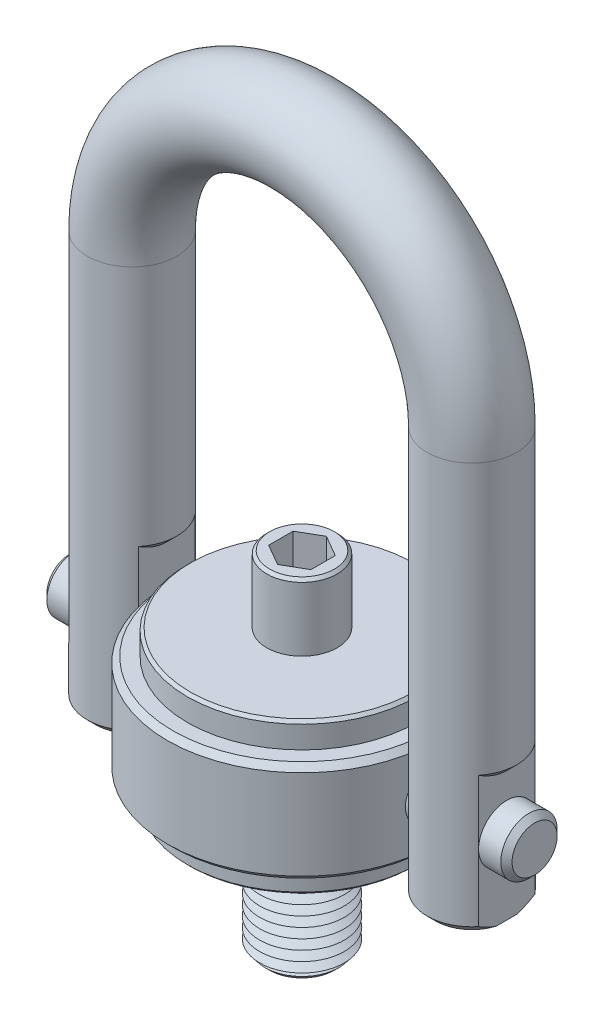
ISO-10303-21;
HEADER;
FILE_DESCRIPTION(('STEP AP214'),'2;1');
FILE_NAME('part.step','',(''),(''),'','','');
FILE_SCHEMA(('AUTOMOTIVE_DESIGN { 1 0 10303 214 1 1 1 1 }'));
ENDSEC;
DATA;
#1=APPLICATION_CONTEXT('core data for automotive mechanical design processes');
#2=APPLICATION_PROTOCOL_DEFINITION('international standard','automotive_design',2000,#1);
#3=PRODUCT_CONTEXT('',#1,'mechanical');
#4=PRODUCT('Part','Part','',(#3));
#5=PRODUCT_RELATED_PRODUCT_CATEGORY('part','',(#4));
#6=PRODUCT_DEFINITION_FORMATION('','',#4);
#7=PRODUCT_DEFINITION_CONTEXT('part definition',#1,'design');
#8=PRODUCT_DEFINITION('design','',#6,#7);
#9=PRODUCT_DEFINITION_SHAPE('','',#8);
#10=(LENGTH_UNIT() NAMED_UNIT(*) SI_UNIT(.MILLI.,.METRE.));
#11=(NAMED_UNIT(*) PLANE_ANGLE_UNIT() SI_UNIT($,.RADIAN.));
#12=(NAMED_UNIT(*) SI_UNIT($,.STERADIAN.) SOLID_ANGLE_UNIT());
#13=UNCERTAINTY_MEASURE_WITH_UNIT(LENGTH_MEASURE(1.E-05),#10,'distance_accuracy_value','');
#14=(GEOMETRIC_REPRESENTATION_CONTEXT(3) GLOBAL_UNCERTAINTY_ASSIGNED_CONTEXT((#13)) GLOBAL_UNIT_ASSIGNED_CONTEXT((#10,
#11,#12)) REPRESENTATION_CONTEXT('',''));
#15=CARTESIAN_POINT('',(0.,0.,0.));
#16=DIRECTION('',(0.,0.,1.));
#17=DIRECTION('',(1.,0.,0.));
#18=AXIS2_PLACEMENT_3D('',#15,#16,#17);
#19=CARTESIAN_POINT('',(82.55,0.,0.));
#20=DIRECTION('',(-1.,0.,0.));
#21=DIRECTION('',(0.,0.,1.));
#22=AXIS2_PLACEMENT_3D('',#19,#20,#21);
#23=CYLINDRICAL_SURFACE('',#22,10.);
#24=CARTESIAN_POINT('',(-80.55,0.,0.));
#25=DIRECTION('',(1.,0.,0.));
#26=DIRECTION('',(0.,0.,-1.));
#27=AXIS2_PLACEMENT_3D('',#24,#25,#26);
#28=CIRCLE('',#27,10.);
#29=CARTESIAN_POINT('',(-80.55,0.,-10.));
#30=VERTEX_POINT('',#29);
#31=EDGE_CURVE('P0_E25',#30,#30,#28,.T.);
#32=ORIENTED_EDGE('',*,*,#31,.T.);
#33=EDGE_LOOP('',(#32));
#34=FACE_BOUND('',#33,.T.);
#35=CARTESIAN_POINT('',(80.55,0.,0.));
#36=DIRECTION('',(1.,0.,0.));
#37=DIRECTION('',(0.,0.,-1.));
#38=AXIS2_PLACEMENT_3D('',#35,#36,#37);
#39=CIRCLE('',#38,10.);
#40=CARTESIAN_POINT('',(80.55,0.,-10.));
#41=VERTEX_POINT('',#40);
#42=EDGE_CURVE('P0_E29',#41,#41,#39,.F.);
#43=ORIENTED_EDGE('',*,*,#42,.T.);
#44=EDGE_LOOP('',(#43));
#45=FACE_BOUND('',#44,.T.);
#46=ADVANCED_FACE('P0_F14',(#34,#45),#23,.T.);
#47=CARTESIAN_POINT('',(82.55,0.,0.));
#48=DIRECTION('',(1.,0.,0.));
#49=DIRECTION('',(0.,0.,-1.));
#50=AXIS2_PLACEMENT_3D('',#47,#48,#49);
#51=PLANE('',#50);
#52=CARTESIAN_POINT('',(82.55,0.,0.));
#53=DIRECTION('',(1.,0.,0.));
#54=DIRECTION('',(0.,0.,-1.));
#55=AXIS2_PLACEMENT_3D('',#52,#53,#54);
#56=CIRCLE('',#55,7.99999999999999);
#57=CARTESIAN_POINT('',(82.55,0.,-7.99999999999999));
#58=VERTEX_POINT('',#57);
#59=EDGE_CURVE('P0_E10',#58,#58,#56,.T.);
#60=ORIENTED_EDGE('',*,*,#59,.T.);
#61=EDGE_LOOP('',(#60));
#62=FACE_BOUND('',#61,.T.);
#63=ADVANCED_FACE('P0_F46',(#62),#51,.T.);
#64=CARTESIAN_POINT('',(-82.55,0.,0.));
#65=DIRECTION('',(1.,0.,0.));
#66=DIRECTION('',(0.,0.,-1.));
#67=AXIS2_PLACEMENT_3D('',#64,#65,#66);
#68=PLANE('',#67);
#69=CARTESIAN_POINT('',(-82.55,0.,0.));
#70=DIRECTION('',(1.,0.,0.));
#71=DIRECTION('',(0.,0.,-1.));
#72=AXIS2_PLACEMENT_3D('',#69,#70,#71);
#73=CIRCLE('',#72,7.99999999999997);
#74=CARTESIAN_POINT('',(-82.55,0.,-7.99999999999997));
#75=VERTEX_POINT('',#74);
#76=EDGE_CURVE('P0_E21',#75,#75,#73,.F.);
#77=ORIENTED_EDGE('',*,*,#76,.T.);
#78=EDGE_LOOP('',(#77));
#79=FACE_BOUND('',#78,.T.);
#80=ADVANCED_FACE('P0_F43',(#79),#68,.F.);
#81=CARTESIAN_POINT('',(-80.55,0.,0.));
#82=DIRECTION('',(1.,0.,0.));
#83=DIRECTION('',(0.,0.,-1.));
#84=AXIS2_PLACEMENT_3D('',#81,#82,#83);
#85=CONICAL_SURFACE('',#84,10.,0.785398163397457);
#86=ORIENTED_EDGE('',*,*,#76,.F.);
#87=EDGE_LOOP('',(#86));
#88=FACE_BOUND('',#87,.T.);
#89=ORIENTED_EDGE('',*,*,#31,.F.);
#90=EDGE_LOOP('',(#89));
#91=FACE_BOUND('',#90,.T.);
#92=ADVANCED_FACE('P0_F38',(#88,#91),#85,.T.);
#93=CARTESIAN_POINT('',(82.55,0.,0.));
#94=DIRECTION('',(-1.,0.,0.));
#95=DIRECTION('',(0.,0.,1.));
#96=AXIS2_PLACEMENT_3D('',#93,#94,#95);
#97=CONICAL_SURFACE('',#96,7.99999999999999,0.785398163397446);
#98=ORIENTED_EDGE('',*,*,#42,.F.);
#99=EDGE_LOOP('',(#98));
#100=FACE_BOUND('',#99,.T.);
#101=ORIENTED_EDGE('',*,*,#59,.F.);
#102=EDGE_LOOP('',(#101));
#103=FACE_BOUND('',#102,.T.);
#104=ADVANCED_FACE('P0_F16',(#100,#103),#97,.T.);
#105=CLOSED_SHELL('',(#46,#63,#80,#92,#104));
#106=MANIFOLD_SOLID_BREP('P0_B1',#105);
#107=CARTESIAN_POINT('',(-47.9383658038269,28.2,10.));
#108=DIRECTION('',(-1.,0.,0.));
#109=DIRECTION('',(0.,0.,1.));
#110=AXIS2_PLACEMENT_3D('',#107,#108,#109);
#111=PLANE('',#110);
#112=DIRECTION('',(0.,-1.,0.));
#113=VECTOR('',#112,1.);
#114=CARTESIAN_POINT('',(-47.9383658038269,28.2,10.));
#115=LINE('',#114,#113);
#116=CARTESIAN_POINT('',(-47.9383658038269,32.7,10.));
#117=VERTEX_POINT('',#116);
#118=CARTESIAN_POINT('',(-47.9383658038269,0.,10.));
#119=VERTEX_POINT('',#118);
#120=EDGE_CURVE('P1_E184',#117,#119,#115,.T.);
#121=ORIENTED_EDGE('',*,*,#120,.T.);
#122=CARTESIAN_POINT('',(-47.9383658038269,0.,0.));
#123=DIRECTION('',(-1.,0.,0.));
#124=DIRECTION('',(0.,0.,1.));
#125=AXIS2_PLACEMENT_3D('',#122,#123,#124);
#126=CIRCLE('',#125,10.);
#127=CARTESIAN_POINT('',(-47.9383658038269,0.,-10.));
#128=VERTEX_POINT('',#127);
#129=EDGE_CURVE('P1_E31',#119,#128,#126,.T.);
#130=ORIENTED_EDGE('',*,*,#129,.T.);
#131=DIRECTION('',(0.,-1.,0.));
#132=VECTOR('',#131,1.);
#133=CARTESIAN_POINT('',(-47.9383658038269,28.2,-10.));
#134=LINE('',#133,#132);
#135=CARTESIAN_POINT('',(-47.9383658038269,32.7,-10.));
#136=VERTEX_POINT('',#135);
#137=EDGE_CURVE('P1_E180',#136,#128,#134,.T.);
#138=ORIENTED_EDGE('',*,*,#137,.F.);
#139=CARTESIAN_POINT('',(-47.9383658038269,32.7,-10.));
#140=CARTESIAN_POINT('',(-47.9383658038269,32.5483389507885,-9.75882173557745));
#141=CARTESIAN_POINT('',(-47.9383658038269,32.3990118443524,-9.51615304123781));
#142=CARTESIAN_POINT('',(-47.9383658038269,32.1057841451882,-9.02748239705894));
#143=CARTESIAN_POINT('',(-47.9383658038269,31.9618848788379,-8.781479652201));
#144=CARTESIAN_POINT('',(-47.9383658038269,31.6797346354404,-8.28482936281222));
#145=CARTESIAN_POINT('',(-47.9383658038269,31.5415108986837,-8.03416628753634));
#146=CARTESIAN_POINT('',(-47.9383658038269,31.2723712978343,-7.52896042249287));
#147=CARTESIAN_POINT('',(-47.9383658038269,31.1414549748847,-7.2744178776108));
#148=CARTESIAN_POINT('',(-47.9383658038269,30.8855140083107,-6.75599854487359));
#149=CARTESIAN_POINT('',(-47.9383658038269,30.7606599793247,-6.49203692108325));
#150=CARTESIAN_POINT('',(-47.9383658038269,30.5211338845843,-5.95953773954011));
#151=CARTESIAN_POINT('',(-47.9383658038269,30.4064626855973,-5.69099979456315));
#152=CARTESIAN_POINT('',(-47.9383658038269,30.0804478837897,-4.8790975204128));
#153=CARTESIAN_POINT('',(-47.9383658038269,29.8865742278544,-4.32840004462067));
#154=CARTESIAN_POINT('',(-47.9383658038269,29.6191683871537,-3.41143153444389));
#155=CARTESIAN_POINT('',(-47.9383658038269,29.5274663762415,-3.05043267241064));
#156=CARTESIAN_POINT('',(-47.9383658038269,29.3728240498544,-2.32215475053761));
#157=CARTESIAN_POINT('',(-47.9383658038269,29.3098877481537,-1.95487482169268));
#158=CARTESIAN_POINT('',(-47.9383658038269,29.2162729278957,-1.21900205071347));
#159=CARTESIAN_POINT('',(-47.9383658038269,29.1853543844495,-0.850440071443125));
#160=CARTESIAN_POINT('',(-47.9383658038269,29.1566460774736,-0.112153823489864));
#161=CARTESIAN_POINT('',(-47.9383658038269,29.1588400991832,0.257569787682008));
#162=CARTESIAN_POINT('',(-47.9383658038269,29.1900174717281,0.873991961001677));
#163=CARTESIAN_POINT('',(-47.9383658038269,29.2099595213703,1.12118851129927));
#164=CARTESIAN_POINT('',(-47.9383658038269,29.264159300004,1.6140970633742));
#165=CARTESIAN_POINT('',(-47.9383658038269,29.2984228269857,1.85980842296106));
#166=CARTESIAN_POINT('',(-47.9383658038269,29.4148598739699,2.55350356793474));
#167=CARTESIAN_POINT('',(-47.9383658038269,29.5131387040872,2.99884258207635));
#168=CARTESIAN_POINT('',(-47.9383658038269,29.7490274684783,3.879149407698));
#169=CARTESIAN_POINT('',(-47.9383658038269,29.886675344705,4.31410677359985));
#170=CARTESIAN_POINT('',(-47.9383658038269,30.1949129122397,5.17454547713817));
#171=CARTESIAN_POINT('',(-47.9383658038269,30.3656669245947,5.59996721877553));
#172=CARTESIAN_POINT('',(-47.9383658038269,30.7330811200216,6.43918325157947));
#173=CARTESIAN_POINT('',(-47.9383658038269,30.9297340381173,6.85298076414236));
#174=CARTESIAN_POINT('',(-47.9383658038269,31.3753615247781,7.73281637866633));
#175=CARTESIAN_POINT('',(-47.9383658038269,31.6277339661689,8.19712419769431));
#176=CARTESIAN_POINT('',(-47.9383658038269,32.0207235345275,8.8822773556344));
#177=CARTESIAN_POINT('',(-47.9383658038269,32.1534532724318,9.10772014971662));
#178=CARTESIAN_POINT('',(-47.9383658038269,32.4234593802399,9.55585714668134));
#179=CARTESIAN_POINT('',(-47.9383658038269,32.5607355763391,9.77855145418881));
#180=CARTESIAN_POINT('',(-47.9383658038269,32.7,10.));
#181=B_SPLINE_CURVE_WITH_KNOTS('',3,(#139,#140,#141,#142,#143,#144,#145,#146,#147,#148,#149,
#150,#151,#152,#153,#154,#155,#156,#157,#158,#159,#160,#161,#162,#163,#164,#165,#166,#167,#168,
#169,#170,#171,#172,#173,#174,#175,#176,#177,#178,#179,#180),.UNSPECIFIED.,.F.,.F.,(4,2,2,2,2,2,
2,2,2,2,2,2,2,2,2,2,2,2,2,2,4),(0.,0.854715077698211,1.70963768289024,2.56827267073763,
3.42685368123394,4.30263827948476,5.17849735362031,6.92671204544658,8.04314393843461,
9.15973156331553,10.2678865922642,11.3754989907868,12.119094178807,12.8629907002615,
14.228848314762,15.5960267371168,16.9701733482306,18.3439353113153,19.928555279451,
20.7133570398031,21.4981288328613),.UNSPECIFIED.);
#182=EDGE_CURVE('P1_E296',#136,#117,#181,.T.);
#183=ORIENTED_EDGE('',*,*,#182,.T.);
#184=EDGE_LOOP('',(#121,#130,#138,#183));
#185=FACE_BOUND('',#184,.T.);
#186=ADVANCED_FACE('P1_F16',(#185),#111,.F.);
#187=CARTESIAN_POINT('',(-72.6616341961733,18.2,10.));
#188=DIRECTION('',(1.,0.,0.));
#189=DIRECTION('',(0.,0.,-1.));
#190=AXIS2_PLACEMENT_3D('',#187,#188,#189);
#191=PLANE('',#190);
#192=DIRECTION('',(0.,-1.,0.));
#193=VECTOR('',#192,1.);
#194=CARTESIAN_POINT('',(-72.6616341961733,18.2,-10.));
#195=LINE('',#194,#193);
#196=CARTESIAN_POINT('',(-72.6616341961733,22.7,-10.));
#197=VERTEX_POINT('',#196);
#198=CARTESIAN_POINT('',(-72.6616341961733,0.,-10.));
#199=VERTEX_POINT('',#198);
#200=EDGE_CURVE('P1_E152',#197,#199,#195,.T.);
#201=ORIENTED_EDGE('',*,*,#200,.T.);
#202=CARTESIAN_POINT('',(-72.6616341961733,0.,0.));
#203=DIRECTION('',(1.,0.,0.));
#204=DIRECTION('',(0.,0.,-1.));
#205=AXIS2_PLACEMENT_3D('',#202,#203,#204);
#206=CIRCLE('',#205,10.);
#207=CARTESIAN_POINT('',(-72.6616341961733,0.,10.));
#208=VERTEX_POINT('',#207);
#209=EDGE_CURVE('P1_E38',#208,#199,#206,.F.);
#210=ORIENTED_EDGE('',*,*,#209,.F.);
#211=DIRECTION('',(0.,-1.,0.));
#212=VECTOR('',#211,1.);
#213=CARTESIAN_POINT('',(-72.6616341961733,18.2,10.));
#214=LINE('',#213,#212);
#215=CARTESIAN_POINT('',(-72.6616341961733,22.7,10.));
#216=VERTEX_POINT('',#215);
#217=EDGE_CURVE('P1_E150',#216,#208,#214,.T.);
#218=ORIENTED_EDGE('',*,*,#217,.F.);
#219=CARTESIAN_POINT('',(-72.6616341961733,22.7,10.));
#220=CARTESIAN_POINT('',(-72.6616341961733,22.5483389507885,9.75882173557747));
#221=CARTESIAN_POINT('',(-72.6616341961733,22.3990118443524,9.51615304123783));
#222=CARTESIAN_POINT('',(-72.6616341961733,22.1057841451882,9.02748239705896));
#223=CARTESIAN_POINT('',(-72.6616341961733,21.9618848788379,8.78147965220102));
#224=CARTESIAN_POINT('',(-72.6616341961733,21.6797346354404,8.28482936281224));
#225=CARTESIAN_POINT('',(-72.6616341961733,21.5415108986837,8.03416628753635));
#226=CARTESIAN_POINT('',(-72.6616341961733,21.2723712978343,7.52896042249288));
#227=CARTESIAN_POINT('',(-72.6616341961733,21.1414549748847,7.27441787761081));
#228=CARTESIAN_POINT('',(-72.6616341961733,20.8855140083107,6.7559985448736));
#229=CARTESIAN_POINT('',(-72.6616341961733,20.7606599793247,6.49203692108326));
#230=CARTESIAN_POINT('',(-72.6616341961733,20.5211338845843,5.95953773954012));
#231=CARTESIAN_POINT('',(-72.6616341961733,20.4064626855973,5.69099979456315));
#232=CARTESIAN_POINT('',(-72.6616341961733,20.0804478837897,4.8790975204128));
#233=CARTESIAN_POINT('',(-72.6616341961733,19.8865742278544,4.32840004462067));
#234=CARTESIAN_POINT('',(-72.6616341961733,19.6191683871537,3.41143153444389));
#235=CARTESIAN_POINT('',(-72.6616341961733,19.5274663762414,3.05043267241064));
#236=CARTESIAN_POINT('',(-72.6616341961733,19.3728240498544,2.32215475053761));
#237=CARTESIAN_POINT('',(-72.6616341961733,19.3098877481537,1.95487482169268));
#238=CARTESIAN_POINT('',(-72.6616341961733,19.2162729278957,1.21900205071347));
#239=CARTESIAN_POINT('',(-72.6616341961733,19.1853543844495,0.85044007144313));
#240=CARTESIAN_POINT('',(-72.6616341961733,19.1566460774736,0.112153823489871));
#241=CARTESIAN_POINT('',(-72.6616341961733,19.1588400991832,-0.257569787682));
#242=CARTESIAN_POINT('',(-72.6616341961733,19.1900174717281,-0.873991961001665));
#243=CARTESIAN_POINT('',(-72.6616341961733,19.2099595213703,-1.12118851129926));
#244=CARTESIAN_POINT('',(-72.6616341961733,19.2641593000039,-1.61409706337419));
#245=CARTESIAN_POINT('',(-72.6616341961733,19.2984228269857,-1.85980842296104));
#246=CARTESIAN_POINT('',(-72.6616341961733,19.4148598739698,-2.55350356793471));
#247=CARTESIAN_POINT('',(-72.6616341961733,19.5131387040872,-2.99884258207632));
#248=CARTESIAN_POINT('',(-72.6616341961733,19.7490274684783,-3.87914940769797));
#249=CARTESIAN_POINT('',(-72.6616341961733,19.8866753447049,-4.31410677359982));
#250=CARTESIAN_POINT('',(-72.6616341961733,20.1949129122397,-5.17454547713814));
#251=CARTESIAN_POINT('',(-72.6616341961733,20.3656669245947,-5.5999672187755));
#252=CARTESIAN_POINT('',(-72.6616341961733,20.7330811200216,-6.43918325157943));
#253=CARTESIAN_POINT('',(-72.6616341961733,20.9297340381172,-6.85298076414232));
#254=CARTESIAN_POINT('',(-72.6616341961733,21.3753615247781,-7.7328163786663));
#255=CARTESIAN_POINT('',(-72.6616341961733,21.6277339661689,-8.19712419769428));
#256=CARTESIAN_POINT('',(-72.6616341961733,22.0207235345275,-8.88227735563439));
#257=CARTESIAN_POINT('',(-72.6616341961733,22.1534532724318,-9.10772014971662));
#258=CARTESIAN_POINT('',(-72.6616341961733,22.4234593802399,-9.55585714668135));
#259=CARTESIAN_POINT('',(-72.6616341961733,22.5607355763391,-9.77855145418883));
#260=CARTESIAN_POINT('',(-72.6616341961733,22.7,-10.));
#261=B_SPLINE_CURVE_WITH_KNOTS('',3,(#219,#220,#221,#222,#223,#224,#225,#226,#227,#228,#229,
#230,#231,#232,#233,#234,#235,#236,#237,#238,#239,#240,#241,#242,#243,#244,#245,#246,#247,#248,
#249,#250,#251,#252,#253,#254,#255,#256,#257,#258,#259,#260),.UNSPECIFIED.,.F.,.F.,(4,2,2,2,2,2,
2,2,2,2,2,2,2,2,2,2,2,2,2,2,4),(0.,0.854715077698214,1.70963768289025,2.56827267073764,
3.42685368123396,4.30263827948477,5.17849735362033,6.9267120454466,8.04314393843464,
9.15973156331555,10.2678865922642,11.3754989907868,12.119094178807,12.8629907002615,
14.228848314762,15.5960267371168,16.9701733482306,18.3439353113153,19.9285552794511,
20.7133570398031,21.4981288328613),.UNSPECIFIED.);
#262=EDGE_CURVE('P1_E303',#216,#197,#261,.T.);
#263=ORIENTED_EDGE('',*,*,#262,.T.);
#264=EDGE_LOOP('',(#201,#210,#218,#263));
#265=FACE_BOUND('',#264,.T.);
#266=ADVANCED_FACE('P1_F147',(#265),#191,.F.);
#267=CARTESIAN_POINT('',(47.9383658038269,28.2,10.));
#268=DIRECTION('',(-1.,0.,0.));
#269=DIRECTION('',(0.,0.,1.));
#270=AXIS2_PLACEMENT_3D('',#267,#268,#269);
#271=PLANE('',#270);
#272=CARTESIAN_POINT('',(47.9383658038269,0.,0.));
#273=DIRECTION('',(-1.,0.,0.));
#274=DIRECTION('',(0.,0.,1.));
#275=AXIS2_PLACEMENT_3D('',#272,#273,#274);
#276=CIRCLE('',#275,10.);
#277=CARTESIAN_POINT('',(47.9383658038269,0.,10.));
#278=VERTEX_POINT('',#277);
#279=CARTESIAN_POINT('',(47.9383658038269,0.,-10.));
#280=VERTEX_POINT('',#279);
#281=EDGE_CURVE('P1_E370',#278,#280,#276,.T.);
#282=ORIENTED_EDGE('',*,*,#281,.F.);
#283=DIRECTION('',(0.,-1.,0.));
#284=VECTOR('',#283,1.);
#285=CARTESIAN_POINT('',(47.9383658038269,28.2,10.));
#286=LINE('',#285,#284);
#287=CARTESIAN_POINT('',(47.9383658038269,32.7000000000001,10.));
#288=VERTEX_POINT('',#287);
#289=EDGE_CURVE('P1_E387',#288,#278,#286,.T.);
#290=ORIENTED_EDGE('',*,*,#289,.F.);
#291=CARTESIAN_POINT('',(47.9383658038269,32.7000000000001,10.));
#292=CARTESIAN_POINT('',(47.9383658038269,32.5109530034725,9.69932343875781));
#293=CARTESIAN_POINT('',(47.9383658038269,32.3254929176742,9.39633176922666));
#294=CARTESIAN_POINT('',(47.9383658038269,31.9632674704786,8.78497772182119));
#295=CARTESIAN_POINT('',(47.9383658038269,31.7865069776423,8.47661246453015));
#296=CARTESIAN_POINT('',(47.9383658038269,31.4415836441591,7.85078044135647));
#297=CARTESIAN_POINT('',(47.9383658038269,31.2735326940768,7.53325166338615));
#298=CARTESIAN_POINT('',(47.9383658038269,30.9502499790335,6.8917590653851));
#299=CARTESIAN_POINT('',(47.9383658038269,30.7950163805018,6.56779617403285));
#300=CARTESIAN_POINT('',(47.9383658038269,30.4982062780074,5.90916627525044));
#301=CARTESIAN_POINT('',(47.9383658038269,30.3568060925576,5.57441925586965));
#302=CARTESIAN_POINT('',(47.9383658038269,30.0927895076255,4.89748524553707));
#303=CARTESIAN_POINT('',(47.9383658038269,29.9701755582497,4.55529729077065));
#304=CARTESIAN_POINT('',(47.9383658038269,29.7477186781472,3.86517786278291));
#305=CARTESIAN_POINT('',(47.9383658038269,29.6477787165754,3.51727796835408));
#306=CARTESIAN_POINT('',(47.9383658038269,29.4735886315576,2.81519322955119));
#307=CARTESIAN_POINT('',(47.9383658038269,29.399326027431,2.46101152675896));
#308=CARTESIAN_POINT('',(47.9383658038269,29.2879040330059,1.79709448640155));
#309=CARTESIAN_POINT('',(47.9383658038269,29.2470346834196,1.48798337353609));
#310=CARTESIAN_POINT('',(47.9383658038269,29.1881843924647,0.867458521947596));
#311=CARTESIAN_POINT('',(47.9383658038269,29.1702106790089,0.556044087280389));
#312=CARTESIAN_POINT('',(47.9383658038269,29.1579354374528,-0.0649069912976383));
#313=CARTESIAN_POINT('',(47.9383658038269,29.1634569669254,-0.374440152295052));
#314=CARTESIAN_POINT('',(47.9383658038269,29.1975567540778,-0.992234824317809));
#315=CARTESIAN_POINT('',(47.9383658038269,29.2261350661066,-1.30049633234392));
#316=CARTESIAN_POINT('',(47.9383658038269,29.2940549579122,-1.8273172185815));
#317=CARTESIAN_POINT('',(47.9383658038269,29.3280649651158,-2.04658413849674));
#318=CARTESIAN_POINT('',(47.9383658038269,29.4067513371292,-2.48320510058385));
#319=CARTESIAN_POINT('',(47.9383658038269,29.4514287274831,-2.70055895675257));
#320=CARTESIAN_POINT('',(47.9383658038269,29.6004301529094,-3.34934073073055));
#321=CARTESIAN_POINT('',(47.9383658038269,29.7197095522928,-3.77738572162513));
#322=CARTESIAN_POINT('',(47.9383658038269,29.9927877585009,-4.62633577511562));
#323=CARTESIAN_POINT('',(47.9383658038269,30.1468888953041,-5.04714130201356));
#324=CARTESIAN_POINT('',(47.9383658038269,30.4824998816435,-5.87750320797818));
#325=CARTESIAN_POINT('',(47.9383658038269,30.6640058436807,-6.28706117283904));
#326=CARTESIAN_POINT('',(47.9383658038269,30.9932609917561,-6.97871570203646));
#327=CARTESIAN_POINT('',(47.9383658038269,31.1355962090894,-7.26342638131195));
#328=CARTESIAN_POINT('',(47.9383658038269,31.4296968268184,-7.82790227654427));
#329=CARTESIAN_POINT('',(47.9383658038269,31.5814614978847,-8.10766787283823));
#330=CARTESIAN_POINT('',(47.9383658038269,31.8906501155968,-8.65846055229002));
#331=CARTESIAN_POINT('',(47.9383658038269,32.0479532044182,-8.92955581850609));
#332=CARTESIAN_POINT('',(47.9383658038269,32.3692342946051,-9.46770064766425));
#333=CARTESIAN_POINT('',(47.9383658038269,32.5332110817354,-9.73475093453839));
#334=CARTESIAN_POINT('',(47.9383658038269,32.7,-10.));
#335=B_SPLINE_CURVE_WITH_KNOTS('',3,(#291,#292,#293,#294,#295,#296,#297,#298,#299,#300,#301,
#302,#303,#304,#305,#306,#307,#308,#309,#310,#311,#312,#313,#314,#315,#316,#317,#318,#319,#320,
#321,#322,#323,#324,#325,#326,#327,#328,#329,#330,#331,#332,#333,#334),.UNSPECIFIED.,.F.,.F.,(4,
2,2,2,2,2,2,2,2,2,2,2,2,2,2,2,2,2,2,2,2,4),(0.,1.06555746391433,2.13170461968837,
3.20923011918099,4.28660120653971,5.37628272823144,6.46610624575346,7.55117411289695,
8.63571383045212,9.57032733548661,10.5052358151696,11.4331160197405,12.3609984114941,
13.0264017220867,13.6918690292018,15.0231145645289,16.3663954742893,17.7094860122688,
18.6642324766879,19.6189051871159,20.5590879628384,21.4991004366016),.UNSPECIFIED.);
#336=CARTESIAN_POINT('',(47.9383658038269,32.7000000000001,-10.));
#337=VERTEX_POINT('',#336);
#338=EDGE_CURVE('P1_E210',#288,#337,#335,.T.);
#339=ORIENTED_EDGE('',*,*,#338,.T.);
#340=DIRECTION('',(0.,-1.,0.));
#341=VECTOR('',#340,1.);
#342=CARTESIAN_POINT('',(47.9383658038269,28.2,-10.));
#343=LINE('',#342,#341);
#344=EDGE_CURVE('P1_E390',#337,#280,#343,.T.);
#345=ORIENTED_EDGE('',*,*,#344,.T.);
#346=EDGE_LOOP('',(#282,#290,#339,#345));
#347=FACE_BOUND('',#346,.T.);
#348=ADVANCED_FACE('P1_F429',(#347),#271,.T.);
#349=CARTESIAN_POINT('',(72.6616341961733,18.2,10.));
#350=DIRECTION('',(1.,0.,0.));
#351=DIRECTION('',(0.,0.,-1.));
#352=AXIS2_PLACEMENT_3D('',#349,#350,#351);
#353=PLANE('',#352);
#354=CARTESIAN_POINT('',(72.6616341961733,0.,0.));
#355=DIRECTION('',(1.,0.,0.));
#356=DIRECTION('',(0.,0.,-1.));
#357=AXIS2_PLACEMENT_3D('',#354,#355,#356);
#358=CIRCLE('',#357,10.);
#359=CARTESIAN_POINT('',(72.6616341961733,0.,-10.));
#360=VERTEX_POINT('',#359);
#361=CARTESIAN_POINT('',(72.6616341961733,0.,10.));
#362=VERTEX_POINT('',#361);
#363=EDGE_CURVE('P1_E153',#360,#362,#358,.T.);
#364=ORIENTED_EDGE('',*,*,#363,.F.);
#365=DIRECTION('',(0.,-1.,0.));
#366=VECTOR('',#365,1.);
#367=CARTESIAN_POINT('',(72.6616341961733,18.2,-10.));
#368=LINE('',#367,#366);
#369=CARTESIAN_POINT('',(72.6616341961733,22.7000000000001,-10.));
#370=VERTEX_POINT('',#369);
#371=EDGE_CURVE('P1_E376',#370,#360,#368,.T.);
#372=ORIENTED_EDGE('',*,*,#371,.F.);
#373=CARTESIAN_POINT('',(72.6616341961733,22.7000000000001,-10.));
#374=CARTESIAN_POINT('',(72.6616341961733,22.5109530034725,-9.69932343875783));
#375=CARTESIAN_POINT('',(72.6616341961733,22.3254929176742,-9.39633176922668));
#376=CARTESIAN_POINT('',(72.6616341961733,21.9632674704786,-8.78497772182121));
#377=CARTESIAN_POINT('',(72.6616341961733,21.7865069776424,-8.47661246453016));
#378=CARTESIAN_POINT('',(72.6616341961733,21.4415836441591,-7.85078044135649));
#379=CARTESIAN_POINT('',(72.6616341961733,21.2735326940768,-7.53325166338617));
#380=CARTESIAN_POINT('',(72.6616341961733,20.9502499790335,-6.89175906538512));
#381=CARTESIAN_POINT('',(72.6616341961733,20.7950163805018,-6.56779617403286));
#382=CARTESIAN_POINT('',(72.6616341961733,20.4982062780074,-5.90916627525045));
#383=CARTESIAN_POINT('',(72.6616341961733,20.3568060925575,-5.57441925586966));
#384=CARTESIAN_POINT('',(72.6616341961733,20.0927895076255,-4.89748524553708));
#385=CARTESIAN_POINT('',(72.6616341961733,19.9701755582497,-4.55529729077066));
#386=CARTESIAN_POINT('',(72.6616341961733,19.7477186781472,-3.86517786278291));
#387=CARTESIAN_POINT('',(72.6616341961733,19.6477787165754,-3.51727796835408));
#388=CARTESIAN_POINT('',(72.6616341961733,19.4735886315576,-2.81519322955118));
#389=CARTESIAN_POINT('',(72.6616341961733,19.399326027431,-2.46101152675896));
#390=CARTESIAN_POINT('',(72.6616341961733,19.2879040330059,-1.79709448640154));
#391=CARTESIAN_POINT('',(72.6616341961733,19.2470346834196,-1.48798337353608));
#392=CARTESIAN_POINT('',(72.6616341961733,19.1881843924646,-0.867458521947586));
#393=CARTESIAN_POINT('',(72.6616341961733,19.1702106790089,-0.556044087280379));
#394=CARTESIAN_POINT('',(72.6616341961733,19.1579354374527,0.0649069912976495));
#395=CARTESIAN_POINT('',(72.6616341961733,19.1634569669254,0.374440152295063));
#396=CARTESIAN_POINT('',(72.6616341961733,19.1975567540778,0.992234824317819));
#397=CARTESIAN_POINT('',(72.6616341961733,19.2261350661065,1.30049633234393));
#398=CARTESIAN_POINT('',(72.6616341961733,19.2940549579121,1.82731721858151));
#399=CARTESIAN_POINT('',(72.6616341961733,19.3280649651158,2.04658413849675));
#400=CARTESIAN_POINT('',(72.6616341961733,19.4067513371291,2.48320510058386));
#401=CARTESIAN_POINT('',(72.6616341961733,19.4514287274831,2.70055895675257));
#402=CARTESIAN_POINT('',(72.6616341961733,19.6004301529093,3.34934073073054));
#403=CARTESIAN_POINT('',(72.6616341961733,19.7197095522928,3.77738572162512));
#404=CARTESIAN_POINT('',(72.6616341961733,19.9927877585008,4.6263357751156));
#405=CARTESIAN_POINT('',(72.6616341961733,20.1468888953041,5.04714130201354));
#406=CARTESIAN_POINT('',(72.6616341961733,20.4824998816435,5.87750320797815));
#407=CARTESIAN_POINT('',(72.6616341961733,20.6640058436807,6.28706117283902));
#408=CARTESIAN_POINT('',(72.6616341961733,20.993260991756,6.97871570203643));
#409=CARTESIAN_POINT('',(72.6616341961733,21.1355962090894,7.26342638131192));
#410=CARTESIAN_POINT('',(72.6616341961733,21.4296968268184,7.82790227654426));
#411=CARTESIAN_POINT('',(72.6616341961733,21.5814614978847,8.10766787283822));
#412=CARTESIAN_POINT('',(72.6616341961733,21.8906501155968,8.65846055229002));
#413=CARTESIAN_POINT('',(72.6616341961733,22.0479532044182,8.9295558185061));
#414=CARTESIAN_POINT('',(72.6616341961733,22.3692342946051,9.46770064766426));
#415=CARTESIAN_POINT('',(72.6616341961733,22.5332110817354,9.73475093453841));
#416=CARTESIAN_POINT('',(72.6616341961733,22.7000000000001,10.));
#417=B_SPLINE_CURVE_WITH_KNOTS('',3,(#373,#374,#375,#376,#377,#378,#379,#380,#381,#382,#383,
#384,#385,#386,#387,#388,#389,#390,#391,#392,#393,#394,#395,#396,#397,#398,#399,#400,#401,#402,
#403,#404,#405,#406,#407,#408,#409,#410,#411,#412,#413,#414,#415,#416),.UNSPECIFIED.,.F.,.F.,(4,
2,2,2,2,2,2,2,2,2,2,2,2,2,2,2,2,2,2,2,2,4),(0.,1.06555746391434,2.13170461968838,3.209230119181,
4.28660120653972,5.37628272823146,6.46610624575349,7.55117411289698,8.63571383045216,
9.57032733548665,10.5052358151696,11.4331160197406,12.3609984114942,13.0264017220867,
13.6918690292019,15.023114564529,16.3663954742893,17.7094860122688,18.6642324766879,
19.6189051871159,20.5590879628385,21.4991004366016),.UNSPECIFIED.);
#418=CARTESIAN_POINT('',(72.6616341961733,22.7000000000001,10.));
#419=VERTEX_POINT('',#418);
#420=EDGE_CURVE('P1_E202',#370,#419,#417,.T.);
#421=ORIENTED_EDGE('',*,*,#420,.T.);
#422=DIRECTION('',(0.,-1.,0.));
#423=VECTOR('',#422,1.);
#424=CARTESIAN_POINT('',(72.6616341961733,18.2,10.));
#425=LINE('',#424,#423);
#426=EDGE_CURVE('P1_E381',#419,#362,#425,.T.);
#427=ORIENTED_EDGE('',*,*,#426,.T.);
#428=EDGE_LOOP('',(#364,#372,#421,#427));
#429=FACE_BOUND('',#428,.T.);
#430=ADVANCED_FACE('P1_F226',(#429),#353,.T.);
#431=CARTESIAN_POINT('',(60.3000000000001,-26.7999999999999,0.));
#432=DIRECTION('',(0.,-1.,0.));
#433=DIRECTION('',(0.,0.,1.));
#434=AXIS2_PLACEMENT_3D('',#431,#432,#433);
#435=PLANE('',#434);
#436=DIRECTION('',(0.,0.,-1.));
#437=VECTOR('',#436,1.);
#438=CARTESIAN_POINT('',(47.9383658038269,-26.8,10.));
#439=LINE('',#438,#437);
#440=CARTESIAN_POINT('',(47.9383658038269,-26.8,3.68781778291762));
#441=VERTEX_POINT('',#440);
#442=CARTESIAN_POINT('',(47.9383658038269,-26.8,-3.68781778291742));
#443=VERTEX_POINT('',#442);
#444=EDGE_CURVE('P1_E379',#441,#443,#439,.T.);
#445=ORIENTED_EDGE('',*,*,#444,.T.);
#446=CARTESIAN_POINT('',(60.3000000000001,-26.7999999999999,0.));
#447=DIRECTION('',(0.,-1.,0.));
#448=DIRECTION('',(1.,0.,0.));
#449=AXIS2_PLACEMENT_3D('',#446,#447,#448);
#450=CIRCLE('',#449,12.9);
#451=CARTESIAN_POINT('',(72.6616341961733,-26.8,-3.68781778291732));
#452=VERTEX_POINT('',#451);
#453=EDGE_CURVE('P1_E241',#443,#452,#450,.T.);
#454=ORIENTED_EDGE('',*,*,#453,.T.);
#455=DIRECTION('',(0.,0.,1.));
#456=VECTOR('',#455,1.);
#457=CARTESIAN_POINT('',(72.6616341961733,-26.8,10.));
#458=LINE('',#457,#456);
#459=CARTESIAN_POINT('',(72.6616341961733,-26.8,3.6878177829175));
#460=VERTEX_POINT('',#459);
#461=EDGE_CURVE('P1_E366',#452,#460,#458,.T.);
#462=ORIENTED_EDGE('',*,*,#461,.T.);
#463=CARTESIAN_POINT('',(60.3000000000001,-26.7999999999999,0.));
#464=DIRECTION('',(0.,-1.,0.));
#465=DIRECTION('',(1.,0.,0.));
#466=AXIS2_PLACEMENT_3D('',#463,#464,#465);
#467=CIRCLE('',#466,12.9000000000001);
#468=CARTESIAN_POINT('',(60.3000000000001,-26.7999999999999,12.9000000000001));
#469=VERTEX_POINT('',#468);
#470=EDGE_CURVE('P1_E415',#460,#469,#467,.T.);
#471=ORIENTED_EDGE('',*,*,#470,.T.);
#472=CARTESIAN_POINT('',(60.3000000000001,-26.7999999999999,0.));
#473=DIRECTION('',(0.,-1.,0.));
#474=DIRECTION('',(1.,0.,0.));
#475=AXIS2_PLACEMENT_3D('',#472,#473,#474);
#476=CIRCLE('',#475,12.9000000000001);
#477=EDGE_CURVE('P1_E413',#469,#441,#476,.T.);
#478=ORIENTED_EDGE('',*,*,#477,.T.);
#479=EDGE_LOOP('',(#445,#454,#462,#471,#478));
#480=FACE_BOUND('',#479,.T.);
#481=ADVANCED_FACE('P1_F419',(#480),#435,.T.);
#482=CARTESIAN_POINT('',(60.3000000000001,118.7,0.));
#483=DIRECTION('',(0.,-1.,0.));
#484=DIRECTION('',(1.,0.,0.));
#485=AXIS2_PLACEMENT_3D('',#482,#483,#484);
#486=CYLINDRICAL_SURFACE('',#485,15.9);
#487=CARTESIAN_POINT('',(60.3000000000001,118.7,0.));
#488=DIRECTION('',(0.,-1.,0.));
#489=DIRECTION('',(0.,0.,1.));
#490=AXIS2_PLACEMENT_3D('',#487,#488,#489);
#491=CIRCLE('',#490,15.9);
#492=CARTESIAN_POINT('',(76.2000000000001,118.7,0.));
#493=VERTEX_POINT('',#492);
#494=EDGE_CURVE('P1_E189',#493,#493,#491,.T.);
#495=ORIENTED_EDGE('',*,*,#494,.T.);
#496=EDGE_LOOP('',(#495));
#497=FACE_BOUND('',#496,.T.);
#498=ORIENTED_EDGE('',*,*,#371,.T.);
#499=CARTESIAN_POINT('',(72.6616341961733,-23.7999999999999,-10.));
#500=VERTEX_POINT('',#499);
#501=EDGE_CURVE('P1_E380',#360,#500,#368,.T.);
#502=ORIENTED_EDGE('',*,*,#501,.T.);
#503=CARTESIAN_POINT('',(60.3000000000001,-23.7999999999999,0.));
#504=DIRECTION('',(0.,-1.,0.));
#505=DIRECTION('',(0.,0.,-1.));
#506=AXIS2_PLACEMENT_3D('',#503,#504,#505);
#507=CIRCLE('',#506,15.9);
#508=CARTESIAN_POINT('',(47.9383658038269,-23.7999999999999,-10.));
#509=VERTEX_POINT('',#508);
#510=EDGE_CURVE('P1_E404',#500,#509,#507,.F.);
#511=ORIENTED_EDGE('',*,*,#510,.T.);
#512=EDGE_CURVE('P1_E386',#280,#509,#343,.T.);
#513=ORIENTED_EDGE('',*,*,#512,.F.);
#514=ORIENTED_EDGE('',*,*,#344,.F.);
#515=CARTESIAN_POINT('',(60.3000000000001,32.7000000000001,0.));
#516=DIRECTION('',(0.,-1.,0.));
#517=DIRECTION('',(0.,0.,-1.));
#518=AXIS2_PLACEMENT_3D('',#515,#516,#517);
#519=CIRCLE('',#518,15.9);
#520=EDGE_CURVE('P1_E192',#337,#288,#519,.F.);
#521=ORIENTED_EDGE('',*,*,#520,.T.);
#522=ORIENTED_EDGE('',*,*,#289,.T.);
#523=CARTESIAN_POINT('',(47.9383658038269,-23.7999999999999,10.));
#524=VERTEX_POINT('',#523);
#525=EDGE_CURVE('P1_E389',#278,#524,#286,.T.);
#526=ORIENTED_EDGE('',*,*,#525,.T.);
#527=CARTESIAN_POINT('',(60.3000000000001,-23.7999999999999,0.));
#528=DIRECTION('',(0.,-1.,0.));
#529=DIRECTION('',(0.,0.,-1.));
#530=AXIS2_PLACEMENT_3D('',#527,#528,#529);
#531=CIRCLE('',#530,15.9);
#532=CARTESIAN_POINT('',(60.3000000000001,-23.7999999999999,15.9));
#533=VERTEX_POINT('',#532);
#534=EDGE_CURVE('P1_E408',#524,#533,#531,.F.);
#535=ORIENTED_EDGE('',*,*,#534,.T.);
#536=CARTESIAN_POINT('',(60.3000000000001,-23.7999999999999,0.));
#537=DIRECTION('',(0.,-1.,0.));
#538=DIRECTION('',(0.,0.,-1.));
#539=AXIS2_PLACEMENT_3D('',#536,#537,#538);
#540=CIRCLE('',#539,15.9);
#541=CARTESIAN_POINT('',(72.6616341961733,-23.7999999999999,10.));
#542=VERTEX_POINT('',#541);
#543=EDGE_CURVE('P1_E423',#533,#542,#540,.F.);
#544=ORIENTED_EDGE('',*,*,#543,.T.);
#545=EDGE_CURVE('P1_E375',#362,#542,#425,.T.);
#546=ORIENTED_EDGE('',*,*,#545,.F.);
#547=ORIENTED_EDGE('',*,*,#426,.F.);
#548=CARTESIAN_POINT('',(60.3000000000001,22.7000000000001,0.));
#549=DIRECTION('',(0.,-1.,0.));
#550=DIRECTION('',(0.,0.,-1.));
#551=AXIS2_PLACEMENT_3D('',#548,#549,#550);
#552=CIRCLE('',#551,15.9);
#553=EDGE_CURVE('P1_E195',#419,#370,#552,.F.);
#554=ORIENTED_EDGE('',*,*,#553,.T.);
#555=EDGE_LOOP('',(#498,#502,#511,#513,#514,#521,#522,#526,#535,#544,#546,#547,#554));
#556=FACE_BOUND('',#555,.T.);
#557=ADVANCED_FACE('P1_F405',(#497,#556),#486,.T.);
#558=CARTESIAN_POINT('',(-60.3000000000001,-26.8,0.));
#559=DIRECTION('',(0.,1.,0.));
#560=DIRECTION('',(0.,0.,1.));
#561=AXIS2_PLACEMENT_3D('',#558,#559,#560);
#562=PLANE('',#561);
#563=DIRECTION('',(0.,0.,1.));
#564=VECTOR('',#563,1.);
#565=CARTESIAN_POINT('',(-72.6616341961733,-26.8,10.));
#566=LINE('',#565,#564);
#567=CARTESIAN_POINT('',(-72.6616341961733,-26.8,-3.68781778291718));
#568=VERTEX_POINT('',#567);
#569=CARTESIAN_POINT('',(-72.6616341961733,-26.8,3.68781778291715));
#570=VERTEX_POINT('',#569);
#571=EDGE_CURVE('P1_E176',#568,#570,#566,.T.);
#572=ORIENTED_EDGE('',*,*,#571,.F.);
#573=CARTESIAN_POINT('',(-60.3000000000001,-26.8,0.));
#574=DIRECTION('',(0.,1.,0.));
#575=DIRECTION('',(0.,0.,1.));
#576=AXIS2_PLACEMENT_3D('',#573,#574,#575);
#577=CIRCLE('',#576,12.9);
#578=CARTESIAN_POINT('',(-47.9383658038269,-26.8,-3.68781778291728));
#579=VERTEX_POINT('',#578);
#580=EDGE_CURVE('P1_E353',#568,#579,#577,.F.);
#581=ORIENTED_EDGE('',*,*,#580,.T.);
#582=DIRECTION('',(0.,0.,-1.));
#583=VECTOR('',#582,1.);
#584=CARTESIAN_POINT('',(-47.9383658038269,-26.8,10.));
#585=LINE('',#584,#583);
#586=CARTESIAN_POINT('',(-47.9383658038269,-26.8,3.68781778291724));
#587=VERTEX_POINT('',#586);
#588=EDGE_CURVE('P1_E170',#587,#579,#585,.T.);
#589=ORIENTED_EDGE('',*,*,#588,.F.);
#590=CARTESIAN_POINT('',(-60.3000000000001,-26.8,0.));
#591=DIRECTION('',(0.,1.,0.));
#592=DIRECTION('',(0.,0.,1.));
#593=AXIS2_PLACEMENT_3D('',#590,#591,#592);
#594=CIRCLE('',#593,12.9);
#595=CARTESIAN_POINT('',(-60.3000000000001,-26.8,12.9));
#596=VERTEX_POINT('',#595);
#597=EDGE_CURVE('P1_E345',#587,#596,#594,.F.);
#598=ORIENTED_EDGE('',*,*,#597,.T.);
#599=CARTESIAN_POINT('',(-60.3000000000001,-26.8,0.));
#600=DIRECTION('',(0.,1.,0.));
#601=DIRECTION('',(0.,0.,1.));
#602=AXIS2_PLACEMENT_3D('',#599,#600,#601);
#603=CIRCLE('',#602,12.9);
#604=EDGE_CURVE('P1_E348',#596,#570,#603,.F.);
#605=ORIENTED_EDGE('',*,*,#604,.T.);
#606=EDGE_LOOP('',(#572,#581,#589,#598,#605));
#607=FACE_BOUND('',#606,.T.);
#608=ADVANCED_FACE('P1_F291',(#607),#562,.F.);
#609=CARTESIAN_POINT('',(-60.3000000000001,-26.8,0.));
#610=DIRECTION('',(0.,1.,0.));
#611=DIRECTION('',(-1.,0.,0.));
#612=AXIS2_PLACEMENT_3D('',#609,#610,#611);
#613=CYLINDRICAL_SURFACE('',#612,15.9);
#614=ORIENTED_EDGE('',*,*,#137,.T.);
#615=CARTESIAN_POINT('',(-47.9383658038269,-23.8,-10.));
#616=VERTEX_POINT('',#615);
#617=EDGE_CURVE('P1_E183',#128,#616,#134,.T.);
#618=ORIENTED_EDGE('',*,*,#617,.T.);
#619=CARTESIAN_POINT('',(-60.3000000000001,-23.8,0.));
#620=DIRECTION('',(0.,1.,0.));
#621=DIRECTION('',(0.,0.,1.));
#622=AXIS2_PLACEMENT_3D('',#619,#620,#621);
#623=CIRCLE('',#622,15.9);
#624=CARTESIAN_POINT('',(-72.6616341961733,-23.8,-10.));
#625=VERTEX_POINT('',#624);
#626=EDGE_CURVE('P1_E340',#616,#625,#623,.T.);
#627=ORIENTED_EDGE('',*,*,#626,.T.);
#628=EDGE_CURVE('P1_E178',#199,#625,#195,.T.);
#629=ORIENTED_EDGE('',*,*,#628,.F.);
#630=ORIENTED_EDGE('',*,*,#200,.F.);
#631=CARTESIAN_POINT('',(-60.3000000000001,22.7,0.));
#632=DIRECTION('',(0.,-1.,0.));
#633=DIRECTION('',(0.,0.,-1.));
#634=AXIS2_PLACEMENT_3D('',#631,#632,#633);
#635=CIRCLE('',#634,15.9);
#636=EDGE_CURVE('P1_E169',#197,#216,#635,.F.);
#637=ORIENTED_EDGE('',*,*,#636,.T.);
#638=ORIENTED_EDGE('',*,*,#217,.T.);
#639=CARTESIAN_POINT('',(-72.6616341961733,-23.8,10.));
#640=VERTEX_POINT('',#639);
#641=EDGE_CURVE('P1_E155',#208,#640,#214,.T.);
#642=ORIENTED_EDGE('',*,*,#641,.T.);
#643=CARTESIAN_POINT('',(-60.3000000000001,-23.8,0.));
#644=DIRECTION('',(0.,1.,0.));
#645=DIRECTION('',(0.,0.,1.));
#646=AXIS2_PLACEMENT_3D('',#643,#644,#645);
#647=CIRCLE('',#646,15.9);
#648=CARTESIAN_POINT('',(-60.3000000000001,-23.8,15.9));
#649=VERTEX_POINT('',#648);
#650=EDGE_CURVE('P1_E338',#640,#649,#647,.T.);
#651=ORIENTED_EDGE('',*,*,#650,.T.);
#652=CARTESIAN_POINT('',(-60.3000000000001,-23.8,0.));
#653=DIRECTION('',(0.,1.,0.));
#654=DIRECTION('',(0.,0.,1.));
#655=AXIS2_PLACEMENT_3D('',#652,#653,#654);
#656=CIRCLE('',#655,15.9);
#657=CARTESIAN_POINT('',(-47.9383658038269,-23.8,10.));
#658=VERTEX_POINT('',#657);
#659=EDGE_CURVE('P1_E330',#649,#658,#656,.T.);
#660=ORIENTED_EDGE('',*,*,#659,.T.);
#661=EDGE_CURVE('P1_E172',#119,#658,#115,.T.);
#662=ORIENTED_EDGE('',*,*,#661,.F.);
#663=ORIENTED_EDGE('',*,*,#120,.F.);
#664=CARTESIAN_POINT('',(-60.3000000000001,32.7,0.));
#665=DIRECTION('',(0.,-1.,0.));
#666=DIRECTION('',(0.,0.,-1.));
#667=AXIS2_PLACEMENT_3D('',#664,#665,#666);
#668=CIRCLE('',#667,15.9);
#669=EDGE_CURVE('P1_E199',#117,#136,#668,.F.);
#670=ORIENTED_EDGE('',*,*,#669,.T.);
#671=EDGE_LOOP('',(#614,#618,#627,#629,#630,#637,#638,#642,#651,#660,#662,#663,#670));
#672=FACE_BOUND('',#671,.T.);
#673=CARTESIAN_POINT('',(-60.3000000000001,118.7,0.));
#674=DIRECTION('',(0.,1.,0.));
#675=DIRECTION('',(0.,0.,1.));
#676=AXIS2_PLACEMENT_3D('',#673,#674,#675);
#677=CIRCLE('',#676,15.9);
#678=CARTESIAN_POINT('',(-76.2000000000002,118.7,0.));
#679=VERTEX_POINT('',#678);
#680=EDGE_CURVE('P1_E182',#679,#679,#677,.T.);
#681=ORIENTED_EDGE('',*,*,#680,.F.);
#682=EDGE_LOOP('',(#681));
#683=FACE_BOUND('',#682,.T.);
#684=ADVANCED_FACE('P1_F166',(#672,#683),#613,.T.);
#685=CARTESIAN_POINT('',(0.,118.7,0.));
#686=DIRECTION('',(0.,0.,-1.));
#687=DIRECTION('',(-1.,0.,0.));
#688=AXIS2_PLACEMENT_3D('',#685,#686,#687);
#689=TOROIDAL_SURFACE('',#688,60.3000000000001,15.9);
#690=CARTESIAN_POINT('',(0.,118.7,0.));
#691=DIRECTION('',(0.,0.,-1.));
#692=DIRECTION('',(-1.,0.,0.));
#693=AXIS2_PLACEMENT_3D('',#690,#691,#692);
#694=CIRCLE('',#693,76.2000000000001);
#695=EDGE_CURVE('',#679,#493,#694,.T.);
#696=ORIENTED_EDGE('',*,*,#680,.T.);
#697=ORIENTED_EDGE('',*,*,#494,.F.);
#698=ORIENTED_EDGE('',*,*,#695,.T.);
#699=ORIENTED_EDGE('',*,*,#695,.F.);
#700=EDGE_LOOP('',(#696,#698,#697,#699));
#701=FACE_BOUND('',#700,.T.);
#702=ADVANCED_FACE('P1_F289',(#701),#689,.T.);
#703=ORIENTED_EDGE('',*,*,#617,.F.);
#704=EDGE_CURVE('P1_E367',#128,#119,#126,.T.);
#705=ORIENTED_EDGE('',*,*,#704,.T.);
#706=ORIENTED_EDGE('',*,*,#661,.T.);
#707=CARTESIAN_POINT('',(-47.9383658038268,-23.8,10.));
#708=CARTESIAN_POINT('',(-47.9383658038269,-23.9557308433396,9.75234655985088));
#709=CARTESIAN_POINT('',(-47.9383658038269,-24.1090036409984,9.50312121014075));
#710=CARTESIAN_POINT('',(-47.9383658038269,-24.4097964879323,9.00116222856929));
#711=CARTESIAN_POINT('',(-47.9383658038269,-24.5573154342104,8.74842793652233));
#712=CARTESIAN_POINT('',(-47.9383658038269,-24.8449994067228,8.24042477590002));
#713=CARTESIAN_POINT('',(-47.9383658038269,-24.9851968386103,7.98517432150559));
#714=CARTESIAN_POINT('',(-47.9383658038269,-25.2579608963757,7.47061588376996));
#715=CARTESIAN_POINT('',(-47.9383658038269,-25.3905275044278,7.21130789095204));
#716=CARTESIAN_POINT('',(-47.9383658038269,-25.6470475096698,6.68787018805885));
#717=CARTESIAN_POINT('',(-47.9383658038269,-25.7709849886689,6.42373264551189));
#718=CARTESIAN_POINT('',(-47.9383658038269,-26.0085500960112,5.89089614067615));
#719=CARTESIAN_POINT('',(-47.9383658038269,-26.1221794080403,5.62219793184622));
#720=CARTESIAN_POINT('',(-47.9383658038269,-26.3380678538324,5.07874963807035));
#721=CARTESIAN_POINT('',(-47.9383658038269,-26.4402701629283,4.80397679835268));
#722=CARTESIAN_POINT('',(-47.9383658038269,-26.6309273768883,4.24952191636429));
#723=CARTESIAN_POINT('',(-47.9383658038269,-26.719373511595,3.96983686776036));
#724=CARTESIAN_POINT('',(-47.9383658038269,-26.8,3.68781778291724));
#725=B_SPLINE_CURVE_WITH_KNOTS('',3,(#707,#708,#709,#710,#711,#712,#713,#714,#715,#716,#717,
#718,#719,#720,#721,#722,#723,#724),.UNSPECIFIED.,.F.,.F.,(4,2,2,2,2,2,2,2,4),(0.,
0.877662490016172,1.75549240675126,2.62903382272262,3.50257727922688,4.37769166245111,
5.25266285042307,6.13180789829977,7.01151116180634),.UNSPECIFIED.);
#726=EDGE_CURVE('P1_E279',#658,#587,#725,.T.);
#727=ORIENTED_EDGE('',*,*,#726,.T.);
#728=ORIENTED_EDGE('',*,*,#588,.T.);
#729=CARTESIAN_POINT('',(-47.9383658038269,-26.8,-3.68781778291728));
#730=CARTESIAN_POINT('',(-47.9383658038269,-26.719373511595,-3.96983686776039));
#731=CARTESIAN_POINT('',(-47.9383658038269,-26.6309273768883,-4.24952191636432));
#732=CARTESIAN_POINT('',(-47.9383658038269,-26.4402701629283,-4.80397679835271));
#733=CARTESIAN_POINT('',(-47.9383658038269,-26.3380678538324,-5.07874963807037));
#734=CARTESIAN_POINT('',(-47.9383658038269,-26.1221794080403,-5.62219793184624));
#735=CARTESIAN_POINT('',(-47.9383658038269,-26.0085500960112,-5.89089614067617));
#736=CARTESIAN_POINT('',(-47.9383658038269,-25.7709849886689,-6.42373264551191));
#737=CARTESIAN_POINT('',(-47.9383658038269,-25.6470475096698,-6.68787018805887));
#738=CARTESIAN_POINT('',(-47.9383658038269,-25.3905275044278,-7.21130789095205));
#739=CARTESIAN_POINT('',(-47.9383658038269,-25.2579608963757,-7.47061588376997));
#740=CARTESIAN_POINT('',(-47.9383658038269,-24.9851968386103,-7.9851743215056));
#741=CARTESIAN_POINT('',(-47.9383658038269,-24.8449994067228,-8.24042477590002));
#742=CARTESIAN_POINT('',(-47.9383658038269,-24.5573154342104,-8.74842793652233));
#743=CARTESIAN_POINT('',(-47.9383658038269,-24.4097964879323,-9.00116222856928));
#744=CARTESIAN_POINT('',(-47.9383658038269,-24.1090036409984,-9.50312121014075));
#745=CARTESIAN_POINT('',(-47.9383658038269,-23.9557308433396,-9.75234655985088));
#746=CARTESIAN_POINT('',(-47.9383658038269,-23.8,-10.));
#747=B_SPLINE_CURVE_WITH_KNOTS('',3,(#729,#730,#731,#732,#733,#734,#735,#736,#737,#738,#739,
#740,#741,#742,#743,#744,#745,#746),.UNSPECIFIED.,.F.,.F.,(4,2,2,2,2,2,2,2,4),(0.,
0.87970326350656,1.75884831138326,2.63381949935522,3.50893388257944,4.3824773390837,
5.25601875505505,6.13384867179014,7.0115111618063),.UNSPECIFIED.);
#748=EDGE_CURVE('P1_E25',#579,#616,#747,.T.);
#749=ORIENTED_EDGE('',*,*,#748,.T.);
#750=EDGE_LOOP('',(#703,#705,#706,#727,#728,#749));
#751=FACE_BOUND('',#750,.T.);
#752=ADVANCED_FACE('P1_F285',(#751),#111,.F.);
#753=ORIENTED_EDGE('',*,*,#641,.F.);
#754=EDGE_CURVE('P1_E138',#199,#208,#206,.F.);
#755=ORIENTED_EDGE('',*,*,#754,.F.);
#756=ORIENTED_EDGE('',*,*,#628,.T.);
#757=CARTESIAN_POINT('',(-72.6616341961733,-23.8,-10.));
#758=CARTESIAN_POINT('',(-72.6616341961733,-23.9557308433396,-9.75234655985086));
#759=CARTESIAN_POINT('',(-72.6616341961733,-24.1090036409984,-9.50312121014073));
#760=CARTESIAN_POINT('',(-72.6616341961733,-24.4097964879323,-9.00116222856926));
#761=CARTESIAN_POINT('',(-72.6616341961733,-24.5573154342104,-8.74842793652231));
#762=CARTESIAN_POINT('',(-72.6616341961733,-24.8449994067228,-8.24042477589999));
#763=CARTESIAN_POINT('',(-72.6616341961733,-24.9851968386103,-7.98517432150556));
#764=CARTESIAN_POINT('',(-72.6616341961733,-25.2579608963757,-7.47061588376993));
#765=CARTESIAN_POINT('',(-72.6616341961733,-25.3905275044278,-7.211307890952));
#766=CARTESIAN_POINT('',(-72.6616341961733,-25.6470475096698,-6.68787018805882));
#767=CARTESIAN_POINT('',(-72.6616341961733,-25.7709849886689,-6.42373264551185));
#768=CARTESIAN_POINT('',(-72.6616341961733,-26.0085500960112,-5.89089614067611));
#769=CARTESIAN_POINT('',(-72.6616341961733,-26.1221794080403,-5.62219793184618));
#770=CARTESIAN_POINT('',(-72.6616341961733,-26.3380678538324,-5.07874963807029));
#771=CARTESIAN_POINT('',(-72.6616341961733,-26.4402701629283,-4.80397679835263));
#772=CARTESIAN_POINT('',(-72.6616341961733,-26.6309273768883,-4.24952191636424));
#773=CARTESIAN_POINT('',(-72.6616341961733,-26.719373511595,-3.9698368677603));
#774=CARTESIAN_POINT('',(-72.6616341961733,-26.8,-3.68781778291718));
#775=B_SPLINE_CURVE_WITH_KNOTS('',3,(#757,#758,#759,#760,#761,#762,#763,#764,#765,#766,#767,
#768,#769,#770,#771,#772,#773,#774),.UNSPECIFIED.,.F.,.F.,(4,2,2,2,2,2,2,2,4),(0.,
0.877662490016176,1.75549240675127,2.62903382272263,3.5025772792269,4.37769166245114,
5.2526628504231,6.13180789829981,7.01151116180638),.UNSPECIFIED.);
#776=EDGE_CURVE('P1_E265',#625,#568,#775,.T.);
#777=ORIENTED_EDGE('',*,*,#776,.T.);
#778=ORIENTED_EDGE('',*,*,#571,.T.);
#779=CARTESIAN_POINT('',(-72.6616341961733,-26.8,3.68781778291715));
#780=CARTESIAN_POINT('',(-72.6616341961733,-26.719373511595,3.96983686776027));
#781=CARTESIAN_POINT('',(-72.6616341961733,-26.6309273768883,4.24952191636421));
#782=CARTESIAN_POINT('',(-72.6616341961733,-26.4402701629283,4.80397679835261));
#783=CARTESIAN_POINT('',(-72.6616341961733,-26.3380678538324,5.07874963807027));
#784=CARTESIAN_POINT('',(-72.6616341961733,-26.1221794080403,5.62219793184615));
#785=CARTESIAN_POINT('',(-72.6616341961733,-26.0085500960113,5.89089614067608));
#786=CARTESIAN_POINT('',(-72.6616341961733,-25.7709849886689,6.42373264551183));
#787=CARTESIAN_POINT('',(-72.6616341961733,-25.6470475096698,6.6878701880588));
#788=CARTESIAN_POINT('',(-72.6616341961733,-25.3905275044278,7.21130789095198));
#789=CARTESIAN_POINT('',(-72.6616341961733,-25.2579608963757,7.47061588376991));
#790=CARTESIAN_POINT('',(-72.6616341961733,-24.9851968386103,7.98517432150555));
#791=CARTESIAN_POINT('',(-72.6616341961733,-24.8449994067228,8.24042477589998));
#792=CARTESIAN_POINT('',(-72.6616341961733,-24.5573154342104,8.7484279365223));
#793=CARTESIAN_POINT('',(-72.6616341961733,-24.4097964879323,9.00116222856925));
#794=CARTESIAN_POINT('',(-72.6616341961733,-24.1090036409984,9.50312121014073));
#795=CARTESIAN_POINT('',(-72.6616341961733,-23.9557308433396,9.75234655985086));
#796=CARTESIAN_POINT('',(-72.6616341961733,-23.8,10.));
#797=B_SPLINE_CURVE_WITH_KNOTS('',3,(#779,#780,#781,#782,#783,#784,#785,#786,#787,#788,#789,
#790,#791,#792,#793,#794,#795,#796),.UNSPECIFIED.,.F.,.F.,(4,2,2,2,2,2,2,2,4),(0.,
0.879703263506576,1.75884831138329,2.63381949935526,3.5089338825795,4.38247733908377,
5.25601875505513,6.13384867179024,7.01151116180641),.UNSPECIFIED.);
#798=EDGE_CURVE('P1_E159',#570,#640,#797,.T.);
#799=ORIENTED_EDGE('',*,*,#798,.T.);
#800=EDGE_LOOP('',(#753,#755,#756,#777,#778,#799));
#801=FACE_BOUND('',#800,.T.);
#802=ADVANCED_FACE('P1_F156',(#801),#191,.F.);
#803=EDGE_CURVE('P1_E143',#280,#278,#276,.T.);
#804=ORIENTED_EDGE('',*,*,#803,.F.);
#805=ORIENTED_EDGE('',*,*,#512,.T.);
#806=CARTESIAN_POINT('',(47.9383658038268,-23.7999999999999,-10.));
#807=CARTESIAN_POINT('',(47.9383658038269,-23.9557308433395,-9.75234655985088));
#808=CARTESIAN_POINT('',(47.9383658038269,-24.1090036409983,-9.50312121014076));
#809=CARTESIAN_POINT('',(47.9383658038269,-24.4097964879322,-9.00116222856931));
#810=CARTESIAN_POINT('',(47.9383658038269,-24.5573154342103,-8.74842793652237));
#811=CARTESIAN_POINT('',(47.9383658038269,-24.8449994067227,-8.24042477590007));
#812=CARTESIAN_POINT('',(47.9383658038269,-24.9851968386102,-7.98517432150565));
#813=CARTESIAN_POINT('',(47.9383658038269,-25.2579608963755,-7.47061588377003));
#814=CARTESIAN_POINT('',(47.9383658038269,-25.3905275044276,-7.21130789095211));
#815=CARTESIAN_POINT('',(47.9383658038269,-25.6470475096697,-6.68787018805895));
#816=CARTESIAN_POINT('',(47.9383658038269,-25.7709849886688,-6.42373264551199));
#817=CARTESIAN_POINT('',(47.9383658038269,-26.0085500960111,-5.89089614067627));
#818=CARTESIAN_POINT('',(47.9383658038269,-26.1221794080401,-5.62219793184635));
#819=CARTESIAN_POINT('',(47.9383658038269,-26.3380678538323,-5.07874963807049));
#820=CARTESIAN_POINT('',(47.9383658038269,-26.4402701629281,-4.80397679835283));
#821=CARTESIAN_POINT('',(47.9383658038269,-26.6309273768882,-4.24952191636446));
#822=CARTESIAN_POINT('',(47.9383658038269,-26.7193735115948,-3.96983686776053));
#823=CARTESIAN_POINT('',(47.9383658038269,-26.7999999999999,-3.68781778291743));
#824=B_SPLINE_CURVE_WITH_KNOTS('',3,(#806,#807,#808,#809,#810,#811,#812,#813,#814,#815,#816,
#817,#818,#819,#820,#821,#822,#823),.UNSPECIFIED.,.F.,.F.,(4,2,2,2,2,2,2,2,4),(0.,
0.877662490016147,1.75549240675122,2.62903382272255,3.50257727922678,4.37769166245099,
5.25266285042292,6.13180789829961,7.01151116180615),.UNSPECIFIED.);
#825=EDGE_CURVE('P1_E324',#509,#443,#824,.T.);
#826=ORIENTED_EDGE('',*,*,#825,.T.);
#827=ORIENTED_EDGE('',*,*,#444,.F.);
#828=CARTESIAN_POINT('',(47.9383658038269,-26.7999999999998,3.68781778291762));
#829=CARTESIAN_POINT('',(47.9383658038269,-26.7193735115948,3.96983686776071));
#830=CARTESIAN_POINT('',(47.9383658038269,-26.6309273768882,4.24952191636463));
#831=CARTESIAN_POINT('',(47.9383658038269,-26.4402701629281,4.80397679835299));
#832=CARTESIAN_POINT('',(47.9383658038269,-26.3380678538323,5.07874963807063));
#833=CARTESIAN_POINT('',(47.9383658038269,-26.1221794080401,5.62219793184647));
#834=CARTESIAN_POINT('',(47.9383658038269,-26.0085500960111,5.89089614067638));
#835=CARTESIAN_POINT('',(47.9383658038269,-25.7709849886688,6.42373264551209));
#836=CARTESIAN_POINT('',(47.9383658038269,-25.6470475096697,6.68787018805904));
#837=CARTESIAN_POINT('',(47.9383658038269,-25.3905275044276,7.21130789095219));
#838=CARTESIAN_POINT('',(47.9383658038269,-25.2579608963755,7.4706158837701));
#839=CARTESIAN_POINT('',(47.9383658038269,-24.9851968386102,7.9851743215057));
#840=CARTESIAN_POINT('',(47.9383658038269,-24.8449994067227,8.24042477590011));
#841=CARTESIAN_POINT('',(47.9383658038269,-24.5573154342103,8.7484279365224));
#842=CARTESIAN_POINT('',(47.9383658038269,-24.4097964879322,9.00116222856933));
#843=CARTESIAN_POINT('',(47.9383658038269,-24.1090036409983,9.50312121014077));
#844=CARTESIAN_POINT('',(47.9383658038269,-23.9557308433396,9.75234655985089));
#845=CARTESIAN_POINT('',(47.9383658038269,-23.7999999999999,10.));
#846=B_SPLINE_CURVE_WITH_KNOTS('',3,(#828,#829,#830,#831,#832,#833,#834,#835,#836,#837,#838,
#839,#840,#841,#842,#843,#844,#845),.UNSPECIFIED.,.F.,.F.,(4,2,2,2,2,2,2,2,4),(0.,
0.879703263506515,1.75884831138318,2.63381949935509,3.50893388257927,4.38247733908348,
5.25601875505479,6.13384867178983,7.01151116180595),.UNSPECIFIED.);
#847=EDGE_CURVE('P1_E331',#441,#524,#846,.T.);
#848=ORIENTED_EDGE('',*,*,#847,.T.);
#849=ORIENTED_EDGE('',*,*,#525,.F.);
#850=EDGE_LOOP('',(#804,#805,#826,#827,#848,#849));
#851=FACE_BOUND('',#850,.T.);
#852=ADVANCED_FACE('P1_F224',(#851),#271,.T.);
#853=CARTESIAN_POINT('',(72.6616341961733,0.,0.));
#854=DIRECTION('',(1.,0.,0.));
#855=DIRECTION('',(0.,0.,-1.));
#856=AXIS2_PLACEMENT_3D('',#853,#854,#855);
#857=CIRCLE('',#856,10.);
#858=EDGE_CURVE('P1_E11',#362,#360,#857,.T.);
#859=ORIENTED_EDGE('',*,*,#858,.F.);
#860=ORIENTED_EDGE('',*,*,#545,.T.);
#861=CARTESIAN_POINT('',(72.6616341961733,-23.7999999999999,10.));
#862=CARTESIAN_POINT('',(72.6616341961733,-23.9557308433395,9.75234655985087));
#863=CARTESIAN_POINT('',(72.6616341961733,-24.1090036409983,9.50312121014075));
#864=CARTESIAN_POINT('',(72.6616341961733,-24.4097964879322,9.00116222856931));
#865=CARTESIAN_POINT('',(72.6616341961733,-24.5573154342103,8.74842793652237));
#866=CARTESIAN_POINT('',(72.6616341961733,-24.8449994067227,8.24042477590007));
#867=CARTESIAN_POINT('',(72.6616341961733,-24.9851968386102,7.98517432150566));
#868=CARTESIAN_POINT('',(72.6616341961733,-25.2579608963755,7.47061588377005));
#869=CARTESIAN_POINT('',(72.6616341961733,-25.3905275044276,7.21130789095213));
#870=CARTESIAN_POINT('',(72.6616341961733,-25.6470475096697,6.68787018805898));
#871=CARTESIAN_POINT('',(72.6616341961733,-25.7709849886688,6.42373264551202));
#872=CARTESIAN_POINT('',(72.6616341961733,-26.0085500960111,5.8908961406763));
#873=CARTESIAN_POINT('',(72.6616341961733,-26.1221794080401,5.62219793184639));
#874=CARTESIAN_POINT('',(72.6616341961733,-26.3380678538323,5.07874963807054));
#875=CARTESIAN_POINT('',(72.6616341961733,-26.4402701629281,4.80397679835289));
#876=CARTESIAN_POINT('',(72.6616341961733,-26.6309273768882,4.24952191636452));
#877=CARTESIAN_POINT('',(72.6616341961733,-26.7193735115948,3.9698368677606));
#878=CARTESIAN_POINT('',(72.6616341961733,-26.7999999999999,3.68781778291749));
#879=B_SPLINE_CURVE_WITH_KNOTS('',3,(#861,#862,#863,#864,#865,#866,#867,#868,#869,#870,#871,
#872,#873,#874,#875,#876,#877,#878),.UNSPECIFIED.,.F.,.F.,(4,2,2,2,2,2,2,2,4),(0.,
0.877662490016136,1.75549240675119,2.62903382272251,3.50257727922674,4.37769166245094,
5.25266285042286,6.13180789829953,7.01151116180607),.UNSPECIFIED.);
#880=EDGE_CURVE('P1_E234',#542,#460,#879,.T.);
#881=ORIENTED_EDGE('',*,*,#880,.T.);
#882=ORIENTED_EDGE('',*,*,#461,.F.);
#883=CARTESIAN_POINT('',(72.6616341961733,-26.7999999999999,-3.68781778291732));
#884=CARTESIAN_POINT('',(72.6616341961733,-26.7193735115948,-3.96983686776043));
#885=CARTESIAN_POINT('',(72.6616341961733,-26.6309273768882,-4.24952191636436));
#886=CARTESIAN_POINT('',(72.6616341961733,-26.4402701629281,-4.80397679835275));
#887=CARTESIAN_POINT('',(72.6616341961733,-26.3380678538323,-5.0787496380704));
#888=CARTESIAN_POINT('',(72.6616341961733,-26.1221794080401,-5.62219793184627));
#889=CARTESIAN_POINT('',(72.6616341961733,-26.0085500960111,-5.89089614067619));
#890=CARTESIAN_POINT('',(72.6616341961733,-25.7709849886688,-6.42373264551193));
#891=CARTESIAN_POINT('',(72.6616341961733,-25.6470475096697,-6.68787018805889));
#892=CARTESIAN_POINT('',(72.6616341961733,-25.3905275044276,-7.21130789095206));
#893=CARTESIAN_POINT('',(72.6616341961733,-25.2579608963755,-7.47061588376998));
#894=CARTESIAN_POINT('',(72.6616341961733,-24.9851968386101,-7.9851743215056));
#895=CARTESIAN_POINT('',(72.6616341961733,-24.8449994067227,-8.24042477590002));
#896=CARTESIAN_POINT('',(72.6616341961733,-24.5573154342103,-8.74842793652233));
#897=CARTESIAN_POINT('',(72.6616341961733,-24.4097964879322,-9.00116222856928));
#898=CARTESIAN_POINT('',(72.6616341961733,-24.1090036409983,-9.50312121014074));
#899=CARTESIAN_POINT('',(72.6616341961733,-23.9557308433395,-9.75234655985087));
#900=CARTESIAN_POINT('',(72.6616341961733,-23.7999999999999,-10.));
#901=B_SPLINE_CURVE_WITH_KNOTS('',3,(#883,#884,#885,#886,#887,#888,#889,#890,#891,#892,#893,
#894,#895,#896,#897,#898,#899,#900),.UNSPECIFIED.,.F.,.F.,(4,2,2,2,2,2,2,2,4),(0.,
0.879703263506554,1.75884831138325,2.63381949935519,3.50893388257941,4.38247733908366,
5.256018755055,6.13384867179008,7.01151116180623),.UNSPECIFIED.);
#902=EDGE_CURVE('P1_E240',#452,#500,#901,.T.);
#903=ORIENTED_EDGE('',*,*,#902,.T.);
#904=ORIENTED_EDGE('',*,*,#501,.F.);
#905=EDGE_LOOP('',(#859,#860,#881,#882,#903,#904));
#906=FACE_BOUND('',#905,.T.);
#907=ADVANCED_FACE('P1_F220',(#906),#353,.T.);
#908=CARTESIAN_POINT('',(60.3000000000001,22.7000000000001,0.));
#909=DIRECTION('',(0.,1.,0.));
#910=DIRECTION('',(0.,0.,1.));
#911=AXIS2_PLACEMENT_3D('',#908,#909,#910);
#912=CONICAL_SURFACE('',#911,15.9,0.785398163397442);
#913=ORIENTED_EDGE('',*,*,#553,.F.);
#914=ORIENTED_EDGE('',*,*,#420,.F.);
#915=EDGE_LOOP('',(#913,#914));
#916=FACE_BOUND('',#915,.T.);
#917=ADVANCED_FACE('P1_F217',(#916),#912,.T.);
#918=CARTESIAN_POINT('',(60.3000000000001,32.7000000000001,0.));
#919=DIRECTION('',(0.,1.,0.));
#920=DIRECTION('',(0.,0.,1.));
#921=AXIS2_PLACEMENT_3D('',#918,#919,#920);
#922=CONICAL_SURFACE('',#921,15.9,0.785398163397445);
#923=ORIENTED_EDGE('',*,*,#520,.F.);
#924=ORIENTED_EDGE('',*,*,#338,.F.);
#925=EDGE_LOOP('',(#923,#924));
#926=FACE_BOUND('',#925,.T.);
#927=ADVANCED_FACE('P1_F313',(#926),#922,.T.);
#928=CARTESIAN_POINT('',(-60.3000000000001,28.2,0.));
#929=DIRECTION('',(0.,1.,0.));
#930=DIRECTION('',(0.,0.,1.));
#931=AXIS2_PLACEMENT_3D('',#928,#929,#930);
#932=CONICAL_SURFACE('',#931,11.3999999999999,0.785398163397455);
#933=ORIENTED_EDGE('',*,*,#182,.F.);
#934=ORIENTED_EDGE('',*,*,#669,.F.);
#935=EDGE_LOOP('',(#933,#934));
#936=FACE_BOUND('',#935,.T.);
#937=ADVANCED_FACE('P1_F309',(#936),#932,.T.);
#938=CARTESIAN_POINT('',(-60.3000000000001,18.2,0.));
#939=DIRECTION('',(0.,1.,0.));
#940=DIRECTION('',(0.,0.,1.));
#941=AXIS2_PLACEMENT_3D('',#938,#939,#940);
#942=CONICAL_SURFACE('',#941,11.3999999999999,0.785398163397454);
#943=ORIENTED_EDGE('',*,*,#262,.F.);
#944=ORIENTED_EDGE('',*,*,#636,.F.);
#945=EDGE_LOOP('',(#943,#944));
#946=FACE_BOUND('',#945,.T.);
#947=ADVANCED_FACE('P1_F312',(#946),#942,.T.);
#948=CARTESIAN_POINT('',(60.3000000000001,-26.7999999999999,0.));
#949=DIRECTION('',(0.,1.,0.));
#950=DIRECTION('',(0.,0.,1.));
#951=AXIS2_PLACEMENT_3D('',#948,#949,#950);
#952=CONICAL_SURFACE('',#951,12.9,0.785398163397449);
#953=ORIENTED_EDGE('',*,*,#825,.F.);
#954=ORIENTED_EDGE('',*,*,#510,.F.);
#955=ORIENTED_EDGE('',*,*,#902,.F.);
#956=ORIENTED_EDGE('',*,*,#453,.F.);
#957=EDGE_LOOP('',(#953,#954,#955,#956));
#958=FACE_BOUND('',#957,.T.);
#959=ADVANCED_FACE('P1_F254',(#958),#952,.T.);
#960=CARTESIAN_POINT('',(60.3000000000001,-26.7999999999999,0.));
#961=DIRECTION('',(0.,1.,0.));
#962=DIRECTION('',(0.,0.,1.));
#963=AXIS2_PLACEMENT_3D('',#960,#961,#962);
#964=CONICAL_SURFACE('',#963,12.9000000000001,0.785398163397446);
#965=ORIENTED_EDGE('',*,*,#880,.F.);
#966=ORIENTED_EDGE('',*,*,#543,.F.);
#967=DIRECTION('',(0.,0.707106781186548,0.707106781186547));
#968=VECTOR('',#967,1.);
#969=CARTESIAN_POINT('',(60.3000000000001,-26.7999999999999,12.9000000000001));
#970=LINE('',#969,#968);
#971=EDGE_CURVE('P1_E284',#469,#533,#970,.T.);
#972=ORIENTED_EDGE('',*,*,#971,.F.);
#973=ORIENTED_EDGE('',*,*,#470,.F.);
#974=EDGE_LOOP('',(#965,#966,#972,#973));
#975=FACE_BOUND('',#974,.T.);
#976=ADVANCED_FACE('P1_F248',(#975),#964,.T.);
#977=CARTESIAN_POINT('',(60.3000000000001,-26.7999999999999,0.));
#978=DIRECTION('',(0.,1.,0.));
#979=DIRECTION('',(0.,0.,1.));
#980=AXIS2_PLACEMENT_3D('',#977,#978,#979);
#981=CONICAL_SURFACE('',#980,12.9000000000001,0.785398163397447);
#982=ORIENTED_EDGE('',*,*,#971,.T.);
#983=ORIENTED_EDGE('',*,*,#534,.F.);
#984=ORIENTED_EDGE('',*,*,#847,.F.);
#985=ORIENTED_EDGE('',*,*,#477,.F.);
#986=EDGE_LOOP('',(#982,#983,#984,#985));
#987=FACE_BOUND('',#986,.T.);
#988=ADVANCED_FACE('P1_F253',(#987),#981,.T.);
#989=CARTESIAN_POINT('',(-60.3000000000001,-23.8,0.));
#990=DIRECTION('',(0.,1.,0.));
#991=DIRECTION('',(0.,0.,1.));
#992=AXIS2_PLACEMENT_3D('',#989,#990,#991);
#993=CONICAL_SURFACE('',#992,15.9,0.785398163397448);
#994=ORIENTED_EDGE('',*,*,#748,.F.);
#995=ORIENTED_EDGE('',*,*,#580,.F.);
#996=ORIENTED_EDGE('',*,*,#776,.F.);
#997=ORIENTED_EDGE('',*,*,#626,.F.);
#998=EDGE_LOOP('',(#994,#995,#996,#997));
#999=FACE_BOUND('',#998,.T.);
#1000=ADVANCED_FACE('P1_F257',(#999),#993,.T.);
#1001=CARTESIAN_POINT('',(-60.3000000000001,-23.8,0.));
#1002=DIRECTION('',(0.,1.,0.));
#1003=DIRECTION('',(0.,0.,1.));
#1004=AXIS2_PLACEMENT_3D('',#1001,#1002,#1003);
#1005=CONICAL_SURFACE('',#1004,15.9,0.78539816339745);
#1006=ORIENTED_EDGE('',*,*,#726,.F.);
#1007=ORIENTED_EDGE('',*,*,#659,.F.);
#1008=DIRECTION('',(0.,0.707106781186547,0.707106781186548));
#1009=VECTOR('',#1008,1.);
#1010=CARTESIAN_POINT('',(-60.3000000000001,-26.8,12.9));
#1011=LINE('',#1010,#1009);
#1012=EDGE_CURVE('P1_E363',#596,#649,#1011,.T.);
#1013=ORIENTED_EDGE('',*,*,#1012,.F.);
#1014=ORIENTED_EDGE('',*,*,#597,.F.);
#1015=EDGE_LOOP('',(#1006,#1007,#1013,#1014));
#1016=FACE_BOUND('',#1015,.T.);
#1017=ADVANCED_FACE('P1_F18',(#1016),#1005,.T.);
#1018=CARTESIAN_POINT('',(-60.3000000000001,-23.8,0.));
#1019=DIRECTION('',(0.,1.,0.));
#1020=DIRECTION('',(0.,0.,1.));
#1021=AXIS2_PLACEMENT_3D('',#1018,#1019,#1020);
#1022=CONICAL_SURFACE('',#1021,15.9,0.785398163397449);
#1023=ORIENTED_EDGE('',*,*,#798,.F.);
#1024=ORIENTED_EDGE('',*,*,#604,.F.);
#1025=ORIENTED_EDGE('',*,*,#1012,.T.);
#1026=ORIENTED_EDGE('',*,*,#650,.F.);
#1027=EDGE_LOOP('',(#1023,#1024,#1025,#1026));
#1028=FACE_BOUND('',#1027,.T.);
#1029=ADVANCED_FACE('P1_F261',(#1028),#1022,.T.);
#1030=CARTESIAN_POINT('',(-100.945905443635,0.,0.));
#1031=DIRECTION('',(1.,0.,0.));
#1032=DIRECTION('',(0.,0.,-1.));
#1033=AXIS2_PLACEMENT_3D('',#1030,#1031,#1032);
#1034=CYLINDRICAL_SURFACE('',#1033,10.);
#1035=ORIENTED_EDGE('',*,*,#281,.T.);
#1036=ORIENTED_EDGE('',*,*,#803,.T.);
#1037=EDGE_LOOP('',(#1035,#1036));
#1038=FACE_BOUND('',#1037,.T.);
#1039=ORIENTED_EDGE('',*,*,#363,.T.);
#1040=ORIENTED_EDGE('',*,*,#858,.T.);
#1041=EDGE_LOOP('',(#1039,#1040));
#1042=FACE_BOUND('',#1041,.T.);
#1043=ADVANCED_FACE('P1_F227',(#1038,#1042),#1034,.F.);
#1044=ORIENTED_EDGE('',*,*,#754,.T.);
#1045=ORIENTED_EDGE('',*,*,#209,.T.);
#1046=EDGE_LOOP('',(#1044,#1045));
#1047=FACE_BOUND('',#1046,.T.);
#1048=ORIENTED_EDGE('',*,*,#704,.F.);
#1049=ORIENTED_EDGE('',*,*,#129,.F.);
#1050=EDGE_LOOP('',(#1048,#1049));
#1051=FACE_BOUND('',#1050,.T.);
#1052=ADVANCED_FACE('P1_F139',(#1047,#1051),#1034,.F.);
#1053=CLOSED_SHELL('',(#186,#266,#348,#430,#481,#557,#608,#684,#702,#752,#802,#852,#907,#917,
#927,#937,#947,#959,#976,#988,#1000,#1017,#1029,#1043,#1052));
#1054=MANIFOLD_SOLID_BREP('P1_B1',#1053);
#1055=CARTESIAN_POINT('',(0.,37.5,0.));
#1056=DIRECTION('',(0.,1.,0.));
#1057=DIRECTION('',(0.,0.,1.));
#1058=AXIS2_PLACEMENT_3D('',#1055,#1056,#1057);
#1059=PLANE('',#1058);
#1060=CARTESIAN_POINT('',(0.,37.5,0.));
#1061=DIRECTION('',(0.,1.,0.));
#1062=DIRECTION('',(0.,0.,1.));
#1063=AXIS2_PLACEMENT_3D('',#1060,#1061,#1062);
#1064=CIRCLE('',#1063,7.5);
#1065=CARTESIAN_POINT('',(3.75,37.5,6.49519052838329));
#1066=VERTEX_POINT('',#1065);
#1067=CARTESIAN_POINT('',(7.5,37.5,0.));
#1068=VERTEX_POINT('',#1067);
#1069=EDGE_CURVE('P2_E98',#1066,#1068,#1064,.T.);
#1070=ORIENTED_EDGE('',*,*,#1069,.F.);
#1071=DIRECTION('',(0.866025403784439,0.,-0.5));
#1072=VECTOR('',#1071,1.);
#1073=CARTESIAN_POINT('',(0.,37.5,8.66025403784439));
#1074=LINE('',#1073,#1072);
#1075=CARTESIAN_POINT('',(7.5,37.5,4.3301270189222));
#1076=VERTEX_POINT('',#1075);
#1077=EDGE_CURVE('P2_E127',#1066,#1076,#1074,.T.);
#1078=ORIENTED_EDGE('',*,*,#1077,.T.);
#1079=DIRECTION('',(0.,0.,-1.));
#1080=VECTOR('',#1079,1.);
#1081=CARTESIAN_POINT('',(7.5,37.5,4.3301270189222));
#1082=LINE('',#1081,#1080);
#1083=EDGE_CURVE('P2_E123',#1076,#1068,#1082,.T.);
#1084=ORIENTED_EDGE('',*,*,#1083,.T.);
#1085=EDGE_LOOP('',(#1070,#1078,#1084));
#1086=FACE_BOUND('',#1085,.T.);
#1087=ADVANCED_FACE('P2_F15',(#1086),#1059,.T.);
#1088=CARTESIAN_POINT('',(0.,37.5,0.));
#1089=DIRECTION('',(0.,1.,0.));
#1090=DIRECTION('',(0.,0.,1.));
#1091=AXIS2_PLACEMENT_3D('',#1088,#1089,#1090);
#1092=CIRCLE('',#1091,7.5);
#1093=CARTESIAN_POINT('',(3.75,37.5,-6.49519052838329));
#1094=VERTEX_POINT('',#1093);
#1095=EDGE_CURVE('P2_E100',#1068,#1094,#1092,.T.);
#1096=ORIENTED_EDGE('',*,*,#1095,.F.);
#1097=CARTESIAN_POINT('',(7.5,37.5,-4.3301270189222));
#1098=VERTEX_POINT('',#1097);
#1099=EDGE_CURVE('P2_E112',#1068,#1098,#1082,.T.);
#1100=ORIENTED_EDGE('',*,*,#1099,.T.);
#1101=DIRECTION('',(-0.866025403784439,0.,-0.5));
#1102=VECTOR('',#1101,1.);
#1103=CARTESIAN_POINT('',(7.5,37.5,-4.3301270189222));
#1104=LINE('',#1103,#1102);
#1105=EDGE_CURVE('P2_E115',#1098,#1094,#1104,.T.);
#1106=ORIENTED_EDGE('',*,*,#1105,.T.);
#1107=EDGE_LOOP('',(#1096,#1100,#1106));
#1108=FACE_BOUND('',#1107,.T.);
#1109=ADVANCED_FACE('P2_F111',(#1108),#1059,.T.);
#1110=CARTESIAN_POINT('',(-3.75,37.5,-6.49519052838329));
#1111=VERTEX_POINT('',#1110);
#1112=EDGE_CURVE('P2_E117',#1094,#1111,#1092,.T.);
#1113=ORIENTED_EDGE('',*,*,#1112,.F.);
#1114=CARTESIAN_POINT('',(0.,37.5,-8.66025403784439));
#1115=VERTEX_POINT('',#1114);
#1116=EDGE_CURVE('P2_E150',#1094,#1115,#1104,.T.);
#1117=ORIENTED_EDGE('',*,*,#1116,.T.);
#1118=DIRECTION('',(-0.866025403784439,0.,0.5));
#1119=VECTOR('',#1118,1.);
#1120=CARTESIAN_POINT('',(0.,37.5,-8.66025403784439));
#1121=LINE('',#1120,#1119);
#1122=EDGE_CURVE('P2_E391',#1115,#1111,#1121,.T.);
#1123=ORIENTED_EDGE('',*,*,#1122,.T.);
#1124=EDGE_LOOP('',(#1113,#1117,#1123));
#1125=FACE_BOUND('',#1124,.T.);
#1126=ADVANCED_FACE('P2_F378',(#1125),#1059,.T.);
#1127=CARTESIAN_POINT('',(-7.5,37.5,0.));
#1128=VERTEX_POINT('',#1127);
#1129=EDGE_CURVE('P2_E393',#1111,#1128,#1092,.T.);
#1130=ORIENTED_EDGE('',*,*,#1129,.F.);
#1131=CARTESIAN_POINT('',(-7.5,37.5,-4.3301270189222));
#1132=VERTEX_POINT('',#1131);
#1133=EDGE_CURVE('P2_E395',#1111,#1132,#1121,.T.);
#1134=ORIENTED_EDGE('',*,*,#1133,.T.);
#1135=DIRECTION('',(0.,0.,1.));
#1136=VECTOR('',#1135,1.);
#1137=CARTESIAN_POINT('',(-7.5,37.5,-4.3301270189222));
#1138=LINE('',#1137,#1136);
#1139=EDGE_CURVE('P2_E400',#1132,#1128,#1138,.T.);
#1140=ORIENTED_EDGE('',*,*,#1139,.T.);
#1141=EDGE_LOOP('',(#1130,#1134,#1140));
#1142=FACE_BOUND('',#1141,.T.);
#1143=ADVANCED_FACE('P2_F382',(#1142),#1059,.T.);
#1144=CARTESIAN_POINT('',(-3.75,37.5,6.49519052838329));
#1145=VERTEX_POINT('',#1144);
#1146=EDGE_CURVE('P2_E34',#1128,#1145,#1092,.T.);
#1147=ORIENTED_EDGE('',*,*,#1146,.F.);
#1148=CARTESIAN_POINT('',(-7.5,37.5,4.33012701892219));
#1149=VERTEX_POINT('',#1148);
#1150=EDGE_CURVE('P2_E399',#1128,#1149,#1138,.T.);
#1151=ORIENTED_EDGE('',*,*,#1150,.T.);
#1152=DIRECTION('',(0.866025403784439,0.,0.5));
#1153=VECTOR('',#1152,1.);
#1154=CARTESIAN_POINT('',(-7.5,37.5,4.33012701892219));
#1155=LINE('',#1154,#1153);
#1156=EDGE_CURVE('P2_E403',#1149,#1145,#1155,.T.);
#1157=ORIENTED_EDGE('',*,*,#1156,.T.);
#1158=EDGE_LOOP('',(#1147,#1151,#1157));
#1159=FACE_BOUND('',#1158,.T.);
#1160=ADVANCED_FACE('P2_F330',(#1159),#1059,.T.);
#1161=CARTESIAN_POINT('',(0.,26.8,40.65));
#1162=DIRECTION('',(0.,1.,0.));
#1163=DIRECTION('',(0.,0.,1.));
#1164=AXIS2_PLACEMENT_3D('',#1161,#1162,#1163);
#1165=PLANE('',#1164);
#1166=CARTESIAN_POINT('',(0.,26.8,0.));
#1167=DIRECTION('',(0.,1.,0.));
#1168=DIRECTION('',(0.,0.,1.));
#1169=AXIS2_PLACEMENT_3D('',#1166,#1167,#1168);
#1170=CIRCLE('',#1169,39.65);
#1171=CARTESIAN_POINT('',(0.,26.8,39.65));
#1172=VERTEX_POINT('',#1171);
#1173=EDGE_CURVE('P2_E186',#1172,#1172,#1170,.T.);
#1174=ORIENTED_EDGE('',*,*,#1173,.T.);
#1175=EDGE_LOOP('',(#1174));
#1176=FACE_BOUND('',#1175,.T.);
#1177=CARTESIAN_POINT('',(0.,26.8,0.));
#1178=DIRECTION('',(0.,1.,0.));
#1179=DIRECTION('',(0.,0.,1.));
#1180=AXIS2_PLACEMENT_3D('',#1177,#1178,#1179);
#1181=CIRCLE('',#1180,12.5);
#1182=CARTESIAN_POINT('',(0.,26.8,12.5));
#1183=VERTEX_POINT('',#1182);
#1184=EDGE_CURVE('P2_E160',#1183,#1183,#1181,.T.);
#1185=ORIENTED_EDGE('',*,*,#1184,.F.);
#1186=EDGE_LOOP('',(#1185));
#1187=FACE_BOUND('',#1186,.T.);
#1188=ADVANCED_FACE('P2_F423',(#1176,#1187),#1165,.T.);
#1189=CARTESIAN_POINT('',(0.,-26.8,0.));
#1190=DIRECTION('',(0.,-1.,0.));
#1191=DIRECTION('',(0.,0.,-1.));
#1192=AXIS2_PLACEMENT_3D('',#1189,#1190,#1191);
#1193=PLANE('',#1192);
#1194=CARTESIAN_POINT('',(0.,-26.8,0.));
#1195=DIRECTION('',(0.,1.,0.));
#1196=DIRECTION('',(0.,0.,1.));
#1197=AXIS2_PLACEMENT_3D('',#1194,#1195,#1196);
#1198=CIRCLE('',#1197,15.);
#1199=CARTESIAN_POINT('',(0.,-26.8,15.));
#1200=VERTEX_POINT('',#1199);
#1201=EDGE_CURVE('P2_E106',#1200,#1200,#1198,.T.);
#1202=ORIENTED_EDGE('',*,*,#1201,.T.);
#1203=EDGE_LOOP('',(#1202));
#1204=FACE_BOUND('',#1203,.T.);
#1205=CARTESIAN_POINT('',(0.,-26.8,0.));
#1206=DIRECTION('',(0.,-1.,0.));
#1207=DIRECTION('',(0.,0.,-1.));
#1208=AXIS2_PLACEMENT_3D('',#1205,#1206,#1207);
#1209=CIRCLE('',#1208,39.65);
#1210=CARTESIAN_POINT('',(0.,-26.8,-39.65));
#1211=VERTEX_POINT('',#1210);
#1212=EDGE_CURVE('P2_E183',#1211,#1211,#1209,.T.);
#1213=ORIENTED_EDGE('',*,*,#1212,.T.);
#1214=EDGE_LOOP('',(#1213));
#1215=FACE_BOUND('',#1214,.T.);
#1216=ADVANCED_FACE('P2_F427',(#1204,#1215),#1193,.T.);
#1217=CARTESIAN_POINT('',(0.,59.0086077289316,0.));
#1218=DIRECTION('',(0.,1.,0.));
#1219=DIRECTION('',(0.,0.,1.));
#1220=AXIS2_PLACEMENT_3D('',#1217,#1218,#1219);
#1221=CYLINDRICAL_SURFACE('',#1220,40.65);
#1222=CARTESIAN_POINT('',(0.,-25.8,0.));
#1223=DIRECTION('',(0.,-1.,0.));
#1224=DIRECTION('',(0.,0.,-1.));
#1225=AXIS2_PLACEMENT_3D('',#1222,#1223,#1224);
#1226=CIRCLE('',#1225,40.65);
#1227=CARTESIAN_POINT('',(0.,-25.8,-40.65));
#1228=VERTEX_POINT('',#1227);
#1229=EDGE_CURVE('P2_E163',#1228,#1228,#1226,.F.);
#1230=ORIENTED_EDGE('',*,*,#1229,.T.);
#1231=EDGE_LOOP('',(#1230));
#1232=FACE_BOUND('',#1231,.T.);
#1233=CARTESIAN_POINT('',(0.,-17.9,0.));
#1234=DIRECTION('',(0.,1.,0.));
#1235=DIRECTION('',(0.,0.,1.));
#1236=AXIS2_PLACEMENT_3D('',#1233,#1234,#1235);
#1237=CIRCLE('',#1236,40.65);
#1238=CARTESIAN_POINT('',(0.,-17.9,40.65));
#1239=VERTEX_POINT('',#1238);
#1240=EDGE_CURVE('P2_E167',#1239,#1239,#1237,.T.);
#1241=ORIENTED_EDGE('',*,*,#1240,.F.);
#1242=EDGE_LOOP('',(#1241));
#1243=FACE_BOUND('',#1242,.T.);
#1244=ADVANCED_FACE('P2_F433',(#1232,#1243),#1221,.T.);
#1245=CARTESIAN_POINT('',(0.,-17.9,40.65));
#1246=DIRECTION('',(0.,-1.,0.));
#1247=DIRECTION('',(0.,0.,-1.));
#1248=AXIS2_PLACEMENT_3D('',#1245,#1246,#1247);
#1249=PLANE('',#1248);
#1250=CARTESIAN_POINT('',(0.,-17.9,0.));
#1251=DIRECTION('',(0.,-1.,0.));
#1252=DIRECTION('',(0.,0.,-1.));
#1253=AXIS2_PLACEMENT_3D('',#1250,#1251,#1252);
#1254=CIRCLE('',#1253,45.75);
#1255=CARTESIAN_POINT('',(0.,-17.9,-45.75));
#1256=VERTEX_POINT('',#1255);
#1257=EDGE_CURVE('P2_E176',#1256,#1256,#1254,.T.);
#1258=ORIENTED_EDGE('',*,*,#1257,.T.);
#1259=EDGE_LOOP('',(#1258));
#1260=FACE_BOUND('',#1259,.T.);
#1261=ORIENTED_EDGE('',*,*,#1240,.T.);
#1262=EDGE_LOOP('',(#1261));
#1263=FACE_BOUND('',#1262,.T.);
#1264=ADVANCED_FACE('P2_F371',(#1260,#1263),#1249,.T.);
#1265=CARTESIAN_POINT('',(0.,59.0086077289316,0.));
#1266=DIRECTION('',(0.,1.,0.));
#1267=DIRECTION('',(0.,0.,1.));
#1268=AXIS2_PLACEMENT_3D('',#1265,#1266,#1267);
#1269=CYLINDRICAL_SURFACE('',#1268,47.75);
#1270=CARTESIAN_POINT('',(-47.75,10.,0.));
#1271=CARTESIAN_POINT('',(-47.7500031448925,10.0000059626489,-0.277695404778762));
#1272=CARTESIAN_POINT('',(-47.7475734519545,9.98843000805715,-0.555317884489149));
#1273=CARTESIAN_POINT('',(-47.7379293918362,9.94223112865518,-1.10863723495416));
#1274=CARTESIAN_POINT('',(-47.7307142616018,9.90760452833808,-1.38433379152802));
#1275=CARTESIAN_POINT('',(-47.7116901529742,9.81554330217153,-1.93190499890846));
#1276=CARTESIAN_POINT('',(-47.6998781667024,9.75809374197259,-2.20377702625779));
#1277=CARTESIAN_POINT('',(-47.6719899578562,9.62084404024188,-2.74160166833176));
#1278=CARTESIAN_POINT('',(-47.6559136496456,9.54104344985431,-3.00755416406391));
#1279=CARTESIAN_POINT('',(-47.6199596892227,9.35980416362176,-3.53140290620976));
#1280=CARTESIAN_POINT('',(-47.6000859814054,9.25838790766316,-3.78930719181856));
#1281=CARTESIAN_POINT('',(-47.5570706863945,9.03462893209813,-4.29558828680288));
#1282=CARTESIAN_POINT('',(-47.5339290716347,8.91228603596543,-4.54396501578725));
#1283=CARTESIAN_POINT('',(-47.4850130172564,8.64759311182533,-5.02946928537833));
#1284=CARTESIAN_POINT('',(-47.459239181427,8.50524766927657,-5.26659938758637));
#1285=CARTESIAN_POINT('',(-47.4057423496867,8.20147914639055,-5.72818479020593));
#1286=CARTESIAN_POINT('',(-47.3780187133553,8.04004978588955,-5.9526358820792));
#1287=CARTESIAN_POINT('',(-47.3210063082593,7.69701933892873,-6.39016235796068));
#1288=CARTESIAN_POINT('',(-47.2917018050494,7.51518191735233,-6.60305043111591));
#1289=CARTESIAN_POINT('',(-47.2326780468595,7.13433638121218,-7.01280847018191));
#1290=CARTESIAN_POINT('',(-47.2029587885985,6.93532813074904,-7.20967830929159));
#1291=CARTESIAN_POINT('',(-47.1439236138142,6.52142552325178,-7.58612451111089));
#1292=CARTESIAN_POINT('',(-47.1146078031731,6.3065270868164,-7.76569640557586));
#1293=CARTESIAN_POINT('',(-47.0572184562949,5.86240306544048,-8.10620136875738));
#1294=CARTESIAN_POINT('',(-47.0291444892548,5.63318251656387,-8.26714093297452));
#1295=CARTESIAN_POINT('',(-46.9747442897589,5.15945900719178,-8.57087846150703));
#1296=CARTESIAN_POINT('',(-46.9484389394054,4.91482340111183,-8.71347339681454));
#1297=CARTESIAN_POINT('',(-46.8986655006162,4.41411071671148,-8.9775126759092));
#1298=CARTESIAN_POINT('',(-46.8751974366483,4.15803353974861,-9.09895683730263));
#1299=CARTESIAN_POINT('',(-46.8317980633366,3.63625960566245,-9.31975631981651));
#1300=CARTESIAN_POINT('',(-46.8118664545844,3.37056366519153,-9.41911351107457));
#1301=CARTESIAN_POINT('',(-46.7761394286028,2.83143965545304,-9.59496429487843));
#1302=CARTESIAN_POINT('',(-46.7603439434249,2.55801171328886,-9.67145826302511));
#1303=CARTESIAN_POINT('',(-46.733565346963,2.00938252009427,-9.80003182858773));
#1304=CARTESIAN_POINT('',(-46.7225165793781,1.73426269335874,-9.8524452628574));
#1305=CARTESIAN_POINT('',(-46.7052391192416,1.1804473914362,-9.93402650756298));
#1306=CARTESIAN_POINT('',(-46.6990103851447,0.901751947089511,-9.96319451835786));
#1307=CARTESIAN_POINT('',(-46.6915622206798,0.342857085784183,-9.99804162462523));
#1308=CARTESIAN_POINT('',(-46.6903422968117,0.0626578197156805,-10.0037230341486));
#1309=CARTESIAN_POINT('',(-46.6929475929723,-0.497204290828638,-9.99155564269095));
#1310=CARTESIAN_POINT('',(-46.6967727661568,-0.77686714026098,-9.97370706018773));
#1311=CARTESIAN_POINT('',(-46.7092468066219,-1.32896132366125,-9.91512166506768));
#1312=CARTESIAN_POINT('',(-46.7178143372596,-1.6014355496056,-9.87477070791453));
#1313=CARTESIAN_POINT('',(-46.7394644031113,-2.14195189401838,-9.77178243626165));
#1314=CARTESIAN_POINT('',(-46.752546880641,-2.4099940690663,-9.70914540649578));
#1315=CARTESIAN_POINT('',(-46.7828461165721,-2.93974827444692,-9.56208332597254));
#1316=CARTESIAN_POINT('',(-46.8000622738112,-3.20146121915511,-9.47766144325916));
#1317=CARTESIAN_POINT('',(-46.8381450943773,-3.716911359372,-9.28762887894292));
#1318=CARTESIAN_POINT('',(-46.859013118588,-3.97064553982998,-9.18201029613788));
#1319=CARTESIAN_POINT('',(-46.9039675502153,-4.47012143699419,-8.9495493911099));
#1320=CARTESIAN_POINT('',(-46.9280758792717,-4.71579312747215,-8.82256087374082));
#1321=CARTESIAN_POINT('',(-46.9787170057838,-5.19560182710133,-8.54880205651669));
#1322=CARTESIAN_POINT('',(-47.0052498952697,-5.42973839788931,-8.40203100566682));
#1323=CARTESIAN_POINT('',(-47.06000565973,-5.88495569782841,-8.08971533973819));
#1324=CARTESIAN_POINT('',(-47.0882286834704,-6.10603527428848,-7.92416907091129));
#1325=CARTESIAN_POINT('',(-47.1455892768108,-6.53368178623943,-7.57542939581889));
#1326=CARTESIAN_POINT('',(-47.174726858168,-6.74024853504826,-7.39223576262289));
#1327=CARTESIAN_POINT('',(-47.2337044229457,-7.14146290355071,-7.00561537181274));
#1328=CARTESIAN_POINT('',(-47.263546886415,-7.33579334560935,-6.80185969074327));
#1329=CARTESIAN_POINT('',(-47.3225222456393,-7.7066291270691,-6.37863825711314));
#1330=CARTESIAN_POINT('',(-47.3516551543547,-7.883134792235,-6.15917279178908));
#1331=CARTESIAN_POINT('',(-47.4084033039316,-8.21713473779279,-5.7059576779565));
#1332=CARTESIAN_POINT('',(-47.4360181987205,-8.37462469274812,-5.47220479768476));
#1333=CARTESIAN_POINT('',(-47.4889388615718,-8.66936172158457,-4.99214072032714));
#1334=CARTESIAN_POINT('',(-47.5142455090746,-8.80661651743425,-4.74583436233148));
#1335=CARTESIAN_POINT('',(-47.5618983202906,-9.06019980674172,-4.24176124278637));
#1336=CARTESIAN_POINT('',(-47.5842383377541,-9.1764850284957,-3.98397212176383));
#1337=CARTESIAN_POINT('',(-47.6252619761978,-9.386891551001,-3.4592160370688));
#1338=CARTESIAN_POINT('',(-47.6439455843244,-9.48101277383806,-3.19224904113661));
#1339=CARTESIAN_POINT('',(-47.6771194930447,-9.64633538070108,-2.65108498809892));
#1340=CARTESIAN_POINT('',(-47.6916102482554,-9.71753924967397,-2.37688871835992));
#1341=CARTESIAN_POINT('',(-47.7159829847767,-9.83645897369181,-1.8232485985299));
#1342=CARTESIAN_POINT('',(-47.7258650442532,-9.88417522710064,-1.54380483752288));
#1343=CARTESIAN_POINT('',(-47.7405982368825,-9.95506900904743,-0.986889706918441));
#1344=CARTESIAN_POINT('',(-47.7455380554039,-9.97867926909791,-0.709475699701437));
#1345=CARTESIAN_POINT('',(-47.7505618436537,-10.0026894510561,-0.153602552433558));
#1346=CARTESIAN_POINT('',(-47.7506458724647,-10.0030896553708,0.124856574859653));
#1347=CARTESIAN_POINT('',(-47.74595589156,-9.98067746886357,0.680780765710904));
#1348=CARTESIAN_POINT('',(-47.7411821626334,-9.95786641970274,0.958245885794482));
#1349=CARTESIAN_POINT('',(-47.7269110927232,-9.88921975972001,1.51018887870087));
#1350=CARTESIAN_POINT('',(-47.7174137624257,-9.84338420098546,1.78466675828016));
#1351=CARTESIAN_POINT('',(-47.6940784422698,-9.72962898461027,2.32594906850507));
#1352=CARTESIAN_POINT('',(-47.6802847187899,-9.66193429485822,2.59280274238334));
#1353=CARTESIAN_POINT('',(-47.6487042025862,-9.50486326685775,3.11980360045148));
#1354=CARTESIAN_POINT('',(-47.6309174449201,-9.41548711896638,3.37995084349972));
#1355=CARTESIAN_POINT('',(-47.5918345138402,-9.21573641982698,3.89174149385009));
#1356=CARTESIAN_POINT('',(-47.5705387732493,-9.10536445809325,4.14338594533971));
#1357=CARTESIAN_POINT('',(-47.524999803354,-8.86437280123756,4.63662218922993));
#1358=CARTESIAN_POINT('',(-47.5007554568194,-8.73374542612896,4.87821012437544));
#1359=CARTESIAN_POINT('',(-47.4496466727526,-8.45138964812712,5.35268157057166));
#1360=CARTESIAN_POINT('',(-47.4227525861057,-8.29941180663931,5.58541345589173));
#1361=CARTESIAN_POINT('',(-47.367332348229,-7.97665042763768,6.03740023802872));
#1362=CARTESIAN_POINT('',(-47.3388054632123,-7.80585840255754,6.25664898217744));
#1363=CARTESIAN_POINT('',(-47.2809049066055,-7.446668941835,6.68013615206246));
#1364=CARTESIAN_POINT('',(-47.2515311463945,-7.25826965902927,6.88437299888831));
#1365=CARTESIAN_POINT('',(-47.1927547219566,-6.86522612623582,7.27637792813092));
#1366=CARTESIAN_POINT('',(-47.1633520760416,-6.66058903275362,7.46415318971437));
#1367=CARTESIAN_POINT('',(-47.1048103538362,-6.2326828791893,7.82517518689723));
#1368=CARTESIAN_POINT('',(-47.0756845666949,-6.00915336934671,7.99811553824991));
#1369=CARTESIAN_POINT('',(-47.0190689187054,-5.548209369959,8.3244873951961));
#1370=CARTESIAN_POINT('',(-46.9915784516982,-5.31080009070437,8.47792615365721));
#1371=CARTESIAN_POINT('',(-46.9390135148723,-4.82360205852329,8.76428638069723));
#1372=CARTESIAN_POINT('',(-46.9139394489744,-4.57381124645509,8.8972044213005));
#1373=CARTESIAN_POINT('',(-46.8669501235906,-4.06362176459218,9.14149705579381));
#1374=CARTESIAN_POINT('',(-46.845034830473,-3.80322320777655,9.25287187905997));
#1375=CARTESIAN_POINT('',(-46.8051271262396,-3.27511252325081,9.45266649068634));
#1376=CARTESIAN_POINT('',(-46.7871138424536,-3.00744838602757,9.54120892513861));
#1377=CARTESIAN_POINT('',(-46.7553985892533,-2.46536003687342,9.69543236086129));
#1378=CARTESIAN_POINT('',(-46.741696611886,-2.19093583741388,9.76111340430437));
#1379=CARTESIAN_POINT('',(-46.7190216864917,-1.63736206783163,9.86907088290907));
#1380=CARTESIAN_POINT('',(-46.7100481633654,-1.35821307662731,9.91135016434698));
#1381=CARTESIAN_POINT('',(-46.6971031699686,-0.797226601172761,9.97216259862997));
#1382=CARTESIAN_POINT('',(-46.693131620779,-0.515389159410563,9.99069612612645));
#1383=CARTESIAN_POINT('',(-46.6903406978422,0.0432306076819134,10.0037305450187));
#1384=CARTESIAN_POINT('',(-46.691420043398,0.320001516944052,9.99870386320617));
#1385=CARTESIAN_POINT('',(-46.698467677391,0.872109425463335,9.96573631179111));
#1386=CARTESIAN_POINT('',(-46.7044358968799,1.1474464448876,9.93779576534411));
#1387=CARTESIAN_POINT('',(-46.7210845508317,1.69471310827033,9.85922747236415));
#1388=CARTESIAN_POINT('',(-46.7317649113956,1.96664280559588,9.80860008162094));
#1389=CARTESIAN_POINT('',(-46.7575242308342,2.50517833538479,9.6850608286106));
#1390=CARTESIAN_POINT('',(-46.7726032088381,2.77178414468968,9.61214886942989));
#1391=CARTESIAN_POINT('',(-46.8066684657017,3.29699561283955,9.44486855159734));
#1392=CARTESIAN_POINT('',(-46.8256423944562,3.55562365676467,9.35056791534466));
#1393=CARTESIAN_POINT('',(-46.8669935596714,4.06408972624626,9.14105094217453));
#1394=CARTESIAN_POINT('',(-46.8893720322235,4.31392451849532,9.02582700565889));
#1395=CARTESIAN_POINT('',(-46.9368962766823,4.80301709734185,8.77533519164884));
#1396=CARTESIAN_POINT('',(-46.9620417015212,5.04227620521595,8.64006982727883));
#1397=CARTESIAN_POINT('',(-47.014407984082,5.5086998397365,8.35042470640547));
#1398=CARTESIAN_POINT('',(-47.0416289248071,5.73586388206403,8.19604418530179));
#1399=CARTESIAN_POINT('',(-47.0979219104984,6.18072322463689,7.86617787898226));
#1400=CARTESIAN_POINT('',(-47.1270189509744,6.39816419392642,7.69035326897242));
#1401=CARTESIAN_POINT('',(-47.185781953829,6.81752400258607,7.32116182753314));
#1402=CARTESIAN_POINT('',(-47.2154479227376,7.01944266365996,7.12779479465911));
#1403=CARTESIAN_POINT('',(-47.2745326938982,7.40645200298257,6.72477042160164));
#1404=CARTESIAN_POINT('',(-47.3039514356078,7.59153866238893,6.51510921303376));
#1405=CARTESIAN_POINT('',(-47.361720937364,7.94356757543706,6.08094073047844));
#1406=CARTESIAN_POINT('',(-47.3900717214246,8.11051023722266,5.85643379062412));
#1407=CARTESIAN_POINT('',(-47.4452502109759,8.4269711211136,5.39130915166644));
#1408=CARTESIAN_POINT('',(-47.472055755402,8.57625814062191,5.15053142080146));
#1409=CARTESIAN_POINT('',(-47.5230031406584,8.85392300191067,4.65705673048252));
#1410=CARTESIAN_POINT('',(-47.5471459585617,8.98230852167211,4.40436419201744));
#1411=CARTESIAN_POINT('',(-47.5920786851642,9.21719877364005,3.88888211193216));
#1412=CARTESIAN_POINT('',(-47.6128705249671,9.32371611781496,3.62609849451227));
#1413=CARTESIAN_POINT('',(-47.6505197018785,9.51410534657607,3.09227053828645));
#1414=CARTESIAN_POINT('',(-47.6673777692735,9.59798143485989,2.82122774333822));
#1415=CARTESIAN_POINT('',(-47.7041682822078,9.77940922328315,2.13232297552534));
#1416=CARTESIAN_POINT('',(-47.7212629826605,9.86201296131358,1.71027354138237));
#1417=CARTESIAN_POINT('',(-47.7441761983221,9.97230270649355,0.858757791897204));
#1418=CARTESIAN_POINT('',(-47.7499951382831,9.99999078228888,0.429291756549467));
#1419=CARTESIAN_POINT('',(-47.75,10.,0.));
#1420=B_SPLINE_CURVE_WITH_KNOTS('',3,(#1270,#1271,#1272,#1273,#1274,#1275,#1276,#1277,#1278,
#1279,#1280,#1281,#1282,#1283,#1284,#1285,#1286,#1287,#1288,#1289,#1290,#1291,#1292,#1293,#1294,
#1295,#1296,#1297,#1298,#1299,#1300,#1301,#1302,#1303,#1304,#1305,#1306,#1307,#1308,#1309,#1310,
#1311,#1312,#1313,#1314,#1315,#1316,#1317,#1318,#1319,#1320,#1321,#1322,#1323,#1324,#1325,#1326,
#1327,#1328,#1329,#1330,#1331,#1332,#1333,#1334,#1335,#1336,#1337,#1338,#1339,#1340,#1341,#1342,
#1343,#1344,#1345,#1346,#1347,#1348,#1349,#1350,#1351,#1352,#1353,#1354,#1355,#1356,#1357,#1358,
#1359,#1360,#1361,#1362,#1363,#1364,#1365,#1366,#1367,#1368,#1369,#1370,#1371,#1372,#1373,#1374,
#1375,#1376,#1377,#1378,#1379,#1380,#1381,#1382,#1383,#1384,#1385,#1386,#1387,#1388,#1389,#1390,
#1391,#1392,#1393,#1394,#1395,#1396,#1397,#1398,#1399,#1400,#1401,#1402,#1403,#1404,#1405,#1406,
#1407,#1408,#1409,#1410,#1411,#1412,#1413,#1414,#1415,#1416,#1417,#1418,#1419),.UNSPECIFIED.,
.T.,.F.,(4,2,2,2,2,2,2,2,2,2,2,2,2,2,2,2,2,2,2,2,2,2,2,2,2,2,2,2,2,2,2,2,2,2,2,2,2,2,2,2,2,2,2,
2,2,2,2,2,2,2,2,2,2,2,2,2,2,2,2,2,2,2,2,2,2,2,2,2,2,2,2,2,2,2,4),(0.,0.832709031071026,
1.6655508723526,2.49893858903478,3.33234304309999,4.16488649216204,4.9974369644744,
5.82979689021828,6.66243149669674,7.5059625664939,8.34950031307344,9.19325537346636,
10.0367153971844,10.8888275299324,11.7409470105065,12.5929943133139,13.4450276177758,
14.2848632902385,15.1246917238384,15.9644374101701,16.8041752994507,17.6299380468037,
18.4556902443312,19.2813224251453,20.1072629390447,20.9391024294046,21.7709735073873,
22.6029179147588,23.4348730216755,24.2833089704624,25.1317294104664,25.9803424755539,
26.8286308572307,27.678650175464,28.5286724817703,29.3786025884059,30.2285182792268,
31.0628934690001,31.8972585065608,32.7315753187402,33.5658902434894,34.3918785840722,
35.2178596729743,36.0437389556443,36.86993214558,37.7067353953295,38.5439177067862,
39.3811879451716,40.2180912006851,41.0694267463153,41.9204447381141,42.7716047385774,
43.6227556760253,44.4692345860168,45.3157119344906,46.1620863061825,47.0084473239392,
47.837910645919,48.667362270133,49.4968008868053,50.3262431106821,51.153094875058,
51.9802475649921,52.8072966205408,53.6343787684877,54.4768272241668,55.3192853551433,
56.1619441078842,57.0045839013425,57.8572594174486,58.7096210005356,59.5614896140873,
60.4131999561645,61.7005406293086,62.9878328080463),.UNSPECIFIED.);
#1421=CARTESIAN_POINT('',(-47.75,10.,0.));
#1422=VERTEX_POINT('',#1421);
#1423=EDGE_CURVE('P2_E10',#1422,#1422,#1420,.T.);
#1424=ORIENTED_EDGE('',*,*,#1423,.F.);
#1425=EDGE_LOOP('',(#1424));
#1426=FACE_BOUND('',#1425,.T.);
#1427=CARTESIAN_POINT('',(46.6911394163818,0.,-10.));
#1428=CARTESIAN_POINT('',(46.6911360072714,0.277620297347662,-10.000005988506));
#1429=CARTESIAN_POINT('',(46.6936199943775,0.555167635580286,-9.98843622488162));
#1430=CARTESIAN_POINT('',(46.7034743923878,1.10833464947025,-9.9422627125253));
#1431=CARTESIAN_POINT('',(46.7108455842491,1.38395400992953,-9.90765528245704));
#1432=CARTESIAN_POINT('',(46.7302661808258,1.93136919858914,-9.81564647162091));
#1433=CARTESIAN_POINT('',(46.7423186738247,2.2031623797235,-9.75823004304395));
#1434=CARTESIAN_POINT('',(46.7707447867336,2.74082768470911,-9.6210620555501));
#1435=CARTESIAN_POINT('',(46.7871184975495,3.00669968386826,-9.54131002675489));
#1436=CARTESIAN_POINT('',(46.8236894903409,3.53037704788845,-9.36018800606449));
#1437=CARTESIAN_POINT('',(46.8438826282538,3.78819080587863,-9.25884142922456));
#1438=CARTESIAN_POINT('',(46.8875242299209,4.29429839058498,-9.03523871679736));
#1439=CARTESIAN_POINT('',(46.9109727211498,4.54259213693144,-8.91298240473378));
#1440=CARTESIAN_POINT('',(46.9604562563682,5.02794485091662,-8.64847601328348));
#1441=CARTESIAN_POINT('',(46.9864907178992,5.26500633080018,-8.50623043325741));
#1442=CARTESIAN_POINT('',(47.0404342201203,5.72647279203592,-8.20267098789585));
#1443=CARTESIAN_POINT('',(47.0683438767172,5.95087357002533,-8.04135084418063));
#1444=CARTESIAN_POINT('',(47.1256542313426,6.38846549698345,-7.6984307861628));
#1445=CARTESIAN_POINT('',(47.1550701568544,6.60146003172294,-7.51658247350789));
#1446=CARTESIAN_POINT('',(47.2142089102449,7.01143207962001,-7.13569272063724));
#1447=CARTESIAN_POINT('',(47.2439317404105,7.2084094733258,-6.93665115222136));
#1448=CARTESIAN_POINT('',(47.3028658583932,7.58506665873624,-6.52266026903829));
#1449=CARTESIAN_POINT('',(47.3320770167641,7.76474212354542,-6.30770699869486));
#1450=CARTESIAN_POINT('',(47.3891607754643,8.10544656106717,-5.86345198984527));
#1451=CARTESIAN_POINT('',(47.4170338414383,8.26648204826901,-5.63415530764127));
#1452=CARTESIAN_POINT('',(47.4709435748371,8.5703306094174,-5.16036862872));
#1453=CARTESIAN_POINT('',(47.4969595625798,8.71294958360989,-4.91575173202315));
#1454=CARTESIAN_POINT('',(47.5461132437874,8.9770387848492,-4.41507414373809));
#1455=CARTESIAN_POINT('',(47.5692509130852,9.09850883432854,-4.15901335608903));
#1456=CARTESIAN_POINT('',(47.6119863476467,9.31936092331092,-3.63727252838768));
#1457=CARTESIAN_POINT('',(47.631584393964,9.41874471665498,-3.37159325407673));
#1458=CARTESIAN_POINT('',(47.6666796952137,9.59464894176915,-2.83250713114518));
#1459=CARTESIAN_POINT('',(47.6821770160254,9.67116974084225,-2.55910040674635));
#1460=CARTESIAN_POINT('',(47.7084324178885,9.7997924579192,-2.01054375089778));
#1461=CARTESIAN_POINT('',(47.7192555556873,9.85223027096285,-1.73547567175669));
#1462=CARTESIAN_POINT('',(47.7361774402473,9.93386809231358,-1.18176815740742));
#1463=CARTESIAN_POINT('',(47.7422762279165,9.96306830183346,-0.903128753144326));
#1464=CARTESIAN_POINT('',(47.7495758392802,9.99798906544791,-0.344344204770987));
#1465=CARTESIAN_POINT('',(47.7507771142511,10.0037117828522,-0.0641992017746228));
#1466=CARTESIAN_POINT('',(47.7482486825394,9.99163587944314,0.495559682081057));
#1467=CARTESIAN_POINT('',(47.7445190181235,9.97383746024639,0.77517356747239));
#1468=CARTESIAN_POINT('',(47.7323312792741,9.91532901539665,1.32746190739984));
#1469=CARTESIAN_POINT('',(47.7239480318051,9.87498149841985,1.60017651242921));
#1470=CARTESIAN_POINT('',(47.7027373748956,9.77195942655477,2.14117515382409));
#1471=CARTESIAN_POINT('',(47.6899100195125,9.70928514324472,2.40945924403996));
#1472=CARTESIAN_POINT('',(47.6601638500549,9.56210782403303,2.93969144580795));
#1473=CARTESIAN_POINT('',(47.6432456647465,9.47760814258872,3.20164052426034));
#1474=CARTESIAN_POINT('',(47.6057688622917,9.28737969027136,3.71755246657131));
#1475=CARTESIAN_POINT('',(47.5852088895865,9.18164301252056,3.97151231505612));
#1476=CARTESIAN_POINT('',(47.5408608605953,8.94897050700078,4.47128678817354));
#1477=CARTESIAN_POINT('',(47.5170524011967,8.82189941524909,4.71703661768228));
#1478=CARTESIAN_POINT('',(47.4669574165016,8.54796302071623,5.19698773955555));
#1479=CARTESIAN_POINT('',(47.4406707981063,8.40109697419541,5.43118859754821));
#1480=CARTESIAN_POINT('',(47.3863272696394,8.08858351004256,5.88651600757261));
#1481=CARTESIAN_POINT('',(47.3582702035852,7.92293443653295,6.1076414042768));
#1482=CARTESIAN_POINT('',(47.3011432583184,7.57398644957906,6.53535836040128));
#1483=CARTESIAN_POINT('',(47.2720733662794,7.39068731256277,6.74194973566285));
#1484=CARTESIAN_POINT('',(47.2131456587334,7.00398624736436,7.14305659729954));
#1485=CARTESIAN_POINT('',(47.1832834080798,6.80026685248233,7.33726549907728));
#1486=CARTESIAN_POINT('',(47.1241612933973,6.37714283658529,7.70786241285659));
#1487=CARTESIAN_POINT('',(47.094901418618,6.15773849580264,7.88425074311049));
#1488=CARTESIAN_POINT('',(47.0378062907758,5.70466684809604,8.21802671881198));
#1489=CARTESIAN_POINT('',(47.0099713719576,5.47099622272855,8.37540991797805));
#1490=CARTESIAN_POINT('',(46.9565426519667,4.99111435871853,8.66994845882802));
#1491=CARTESIAN_POINT('',(46.9309479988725,4.74490794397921,8.80711150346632));
#1492=CARTESIAN_POINT('',(46.8826661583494,4.24086979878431,9.06061915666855));
#1493=CARTESIAN_POINT('',(46.8599871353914,3.98300804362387,9.17690565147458));
#1494=CARTESIAN_POINT('',(46.8182925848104,3.45810016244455,9.38730477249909));
#1495=CARTESIAN_POINT('',(46.7992770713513,3.19105400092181,9.4814173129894));
#1496=CARTESIAN_POINT('',(46.7654850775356,2.64972642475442,9.6467107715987));
#1497=CARTESIAN_POINT('',(46.7507080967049,2.37544586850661,9.71789439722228));
#1498=CARTESIAN_POINT('',(46.7258421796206,1.82163068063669,9.83676101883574));
#1499=CARTESIAN_POINT('',(46.7157531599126,1.5420961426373,9.88444443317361));
#1500=CARTESIAN_POINT('',(46.700716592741,0.985125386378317,9.95524254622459));
#1501=CARTESIAN_POINT('',(46.6956762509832,0.707747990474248,9.97880085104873));
#1502=CARTESIAN_POINT('',(46.6905597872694,0.151950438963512,10.0027135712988));
#1503=CARTESIAN_POINT('',(46.6904836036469,-0.126469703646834,10.0030682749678));
#1504=CARTESIAN_POINT('',(46.6952975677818,-0.682310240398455,9.98057190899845));
#1505=CARTESIAN_POINT('',(46.7001874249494,-0.959730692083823,9.9577221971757));
#1506=CARTESIAN_POINT('',(46.7147865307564,-1.5115764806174,9.8890065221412));
#1507=CARTESIAN_POINT('',(46.7244957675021,-1.78600182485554,9.84314061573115));
#1508=CARTESIAN_POINT('',(46.7483160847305,-2.32697322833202,9.72937697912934));
#1509=CARTESIAN_POINT('',(46.7623789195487,-2.59357219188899,9.661720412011));
#1510=CARTESIAN_POINT('',(46.794532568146,-3.12006825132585,9.50476890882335));
#1511=CARTESIAN_POINT('',(46.8126233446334,-3.37996540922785,9.41547417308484));
#1512=CARTESIAN_POINT('',(46.8523160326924,-3.89127028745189,9.21592758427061));
#1513=CARTESIAN_POINT('',(46.873917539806,-4.14267898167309,9.10567814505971));
#1514=CARTESIAN_POINT('',(46.9200364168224,-4.6354642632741,8.86497017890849));
#1515=CARTESIAN_POINT('',(46.944554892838,-4.87683699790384,8.73450398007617));
#1516=CARTESIAN_POINT('',(46.9961777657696,-5.35112775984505,8.45237331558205));
#1517=CARTESIAN_POINT('',(47.0233131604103,-5.58388329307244,8.30044133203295));
#1518=CARTESIAN_POINT('',(47.079130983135,-6.03592711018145,7.97776514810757));
#1519=CARTESIAN_POINT('',(47.1078141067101,-6.2552092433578,7.80701245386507));
#1520=CARTESIAN_POINT('',(47.1659250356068,-6.6787728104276,7.44789194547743));
#1521=CARTESIAN_POINT('',(47.1953529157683,-6.88305272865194,7.25952235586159));
#1522=CARTESIAN_POINT('',(47.2541297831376,-7.27515273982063,6.86652514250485));
#1523=CARTESIAN_POINT('',(47.2834787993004,-7.46298001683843,6.66190468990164));
#1524=CARTESIAN_POINT('',(47.3418143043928,-7.824142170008,6.2339829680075));
#1525=CARTESIAN_POINT('',(47.3707855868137,-7.99716781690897,6.01041849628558));
#1526=CARTESIAN_POINT('',(47.427003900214,-8.32370506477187,5.5493872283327));
#1527=CARTESIAN_POINT('',(47.4542515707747,-8.47722392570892,5.31192565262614));
#1528=CARTESIAN_POINT('',(47.5062698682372,-8.7637340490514,4.82461064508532));
#1529=CARTESIAN_POINT('',(47.5310400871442,-8.89672193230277,4.57475518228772));
#1530=CARTESIAN_POINT('',(47.5773953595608,-9.14114083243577,4.06442920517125));
#1531=CARTESIAN_POINT('',(47.5989804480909,-9.25257208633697,3.80395880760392));
#1532=CARTESIAN_POINT('',(47.6382291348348,-9.45240290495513,3.27586559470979));
#1533=CARTESIAN_POINT('',(47.6559158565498,-9.54093884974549,3.00829611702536));
#1534=CARTESIAN_POINT('',(47.6870315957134,-9.69516337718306,2.46640671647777));
#1535=CARTESIAN_POINT('',(47.7004606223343,-9.76085200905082,2.19208680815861));
#1536=CARTESIAN_POINT('',(47.7226753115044,-9.86884160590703,1.63872623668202));
#1537=CARTESIAN_POINT('',(47.7314614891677,-9.91114516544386,1.35968610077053));
#1538=CARTESIAN_POINT('',(47.7441396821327,-9.97202407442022,0.798920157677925));
#1539=CARTESIAN_POINT('',(47.7480317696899,-9.99059977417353,0.517194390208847));
#1540=CARTESIAN_POINT('',(47.7507834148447,-10.0037419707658,-0.0414559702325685));
#1541=CARTESIAN_POINT('',(47.749737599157,-9.99875991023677,-0.31836958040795));
#1542=CARTESIAN_POINT('',(47.7428587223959,-9.96585759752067,-0.870767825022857));
#1543=CARTESIAN_POINT('',(47.7370257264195,-9.9379376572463,-1.14625247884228));
#1544=CARTESIAN_POINT('',(47.72073456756,-9.85938540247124,-1.6938178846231));
#1545=CARTESIAN_POINT('',(47.7102764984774,-9.80875354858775,-1.96589870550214));
#1546=CARTESIAN_POINT('',(47.6850242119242,-9.68517877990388,-2.50473909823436));
#1547=CARTESIAN_POINT('',(47.670229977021,-9.61223577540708,-2.77149864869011));
#1548=CARTESIAN_POINT('',(47.6367608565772,-9.44484956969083,-3.29706780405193));
#1549=CARTESIAN_POINT('',(47.6180974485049,-9.35046988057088,-3.5558983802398));
#1550=CARTESIAN_POINT('',(47.5773624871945,-9.14076026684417,-4.06475826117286));
#1551=CARTESIAN_POINT('',(47.5552896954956,-9.0254227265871,-4.31478432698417));
#1552=CARTESIAN_POINT('',(47.5083385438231,-8.77467317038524,-4.80423897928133));
#1553=CARTESIAN_POINT('',(47.4834605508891,-8.63926377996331,-5.04366894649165));
#1554=CARTESIAN_POINT('',(47.4315617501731,-8.34930468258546,-5.51040806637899));
#1555=CARTESIAN_POINT('',(47.404540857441,-8.19475421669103,-5.73771673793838));
#1556=CARTESIAN_POINT('',(47.3485904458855,-7.86469469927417,-6.18260723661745));
#1557=CARTESIAN_POINT('',(47.3196357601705,-7.68886553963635,-6.39994847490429));
#1558=CARTESIAN_POINT('',(47.2610526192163,-7.31968583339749,-6.81910541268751));
#1559=CARTESIAN_POINT('',(47.2314241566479,-7.12633509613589,-7.02092094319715));
#1560=CARTESIAN_POINT('',(47.172305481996,-6.72336416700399,-7.40772522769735));
#1561=CARTESIAN_POINT('',(47.1428153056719,-6.51373998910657,-7.59270983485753));
#1562=CARTESIAN_POINT('',(47.0848021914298,-6.07966698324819,-7.94453898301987));
#1563=CARTESIAN_POINT('',(47.0562792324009,-5.85521847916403,-8.11138392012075));
#1564=CARTESIAN_POINT('',(47.0006624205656,-5.39014859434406,-8.42771312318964));
#1565=CARTESIAN_POINT('',(46.9735903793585,-5.14936265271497,-8.57695943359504));
#1566=CARTESIAN_POINT('',(46.9220577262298,-4.65587743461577,-8.85454270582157));
#1567=CARTESIAN_POINT('',(46.8975961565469,-4.40318257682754,-8.98288734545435));
#1568=CARTESIAN_POINT('',(46.8520103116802,-3.8876987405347,-9.21769745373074));
#1569=CARTESIAN_POINT('',(46.8308840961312,-3.62491574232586,-9.32417565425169));
#1570=CARTESIAN_POINT('',(46.7925888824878,-3.09108697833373,-9.51448957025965));
#1571=CARTESIAN_POINT('',(46.7754191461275,-2.82004276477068,-9.59832951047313));
#1572=CARTESIAN_POINT('',(46.7379319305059,-2.13133169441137,-9.77961575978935));
#1573=CARTESIAN_POINT('',(46.7204855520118,-1.70948177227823,-9.862141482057));
#1574=CARTESIAN_POINT('',(46.6970921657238,-0.858362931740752,-9.97232784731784));
#1575=CARTESIAN_POINT('',(46.6911446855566,-0.429094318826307,-9.99999074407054));
#1576=CARTESIAN_POINT('',(46.6911394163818,0.,-10.));
#1577=B_SPLINE_CURVE_WITH_KNOTS('',3,(#1427,#1428,#1429,#1430,#1431,#1432,#1433,#1434,#1435,
#1436,#1437,#1438,#1439,#1440,#1441,#1442,#1443,#1444,#1445,#1446,#1447,#1448,#1449,#1450,#1451,
#1452,#1453,#1454,#1455,#1456,#1457,#1458,#1459,#1460,#1461,#1462,#1463,#1464,#1465,#1466,#1467,
#1468,#1469,#1470,#1471,#1472,#1473,#1474,#1475,#1476,#1477,#1478,#1479,#1480,#1481,#1482,#1483,
#1484,#1485,#1486,#1487,#1488,#1489,#1490,#1491,#1492,#1493,#1494,#1495,#1496,#1497,#1498,#1499,
#1500,#1501,#1502,#1503,#1504,#1505,#1506,#1507,#1508,#1509,#1510,#1511,#1512,#1513,#1514,#1515,
#1516,#1517,#1518,#1519,#1520,#1521,#1522,#1523,#1524,#1525,#1526,#1527,#1528,#1529,#1530,#1531,
#1532,#1533,#1534,#1535,#1536,#1537,#1538,#1539,#1540,#1541,#1542,#1543,#1544,#1545,#1546,#1547,
#1548,#1549,#1550,#1551,#1552,#1553,#1554,#1555,#1556,#1557,#1558,#1559,#1560,#1561,#1562,#1563,
#1564,#1565,#1566,#1567,#1568,#1569,#1570,#1571,#1572,#1573,#1574,#1575,#1576),.UNSPECIFIED.,
.T.,.F.,(4,2,2,2,2,2,2,2,2,2,2,2,2,2,2,2,2,2,2,2,2,2,2,2,2,2,2,2,2,2,2,2,2,2,2,2,2,2,2,2,2,2,2,
2,2,2,2,2,2,2,2,2,2,2,2,2,2,2,2,2,2,2,2,2,2,2,2,2,2,2,2,2,2,2,4),(0.,0.832483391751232,
1.66509984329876,2.49826651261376,3.33145071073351,4.16373603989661,4.99602839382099,
5.82813370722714,6.66051367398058,7.50434154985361,8.34817571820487,9.19222036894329,
10.0359691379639,10.8879887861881,11.7400155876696,12.5919747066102,13.4439201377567,
14.2835925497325,15.123257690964,15.9628454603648,16.8024260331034,17.62888209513,
18.4553281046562,19.2816471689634,20.1082744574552,20.9403556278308,21.7724680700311,
22.6046539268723,23.4368503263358,24.2849653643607,25.1330652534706,25.9813631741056,
26.8293370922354,27.6796360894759,28.529938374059,29.3801402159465,30.2303269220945,
31.0645835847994,31.8988298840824,32.7330273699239,33.5672227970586,34.3924861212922,
35.2177418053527,36.0429024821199,36.8683770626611,37.7052351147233,38.5424724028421,
39.3797941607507,40.2167484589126,41.0682735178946,41.9194807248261,42.7708278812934,
43.6221656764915,44.4683090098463,45.3144505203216,46.1604981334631,47.0065332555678,
47.8364220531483,48.6662995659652,49.4961602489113,50.3260242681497,51.1534609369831,
51.9811988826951,52.8088286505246,53.6364912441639,54.4786732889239,55.3208644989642,
56.1632626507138,57.0056424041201,57.8583511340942,58.7107459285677,59.5626429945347,
60.4143809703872,61.7011333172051,62.9878328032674),.UNSPECIFIED.);
#1578=CARTESIAN_POINT('',(46.6911394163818,0.,-10.));
#1579=VERTEX_POINT('',#1578);
#1580=EDGE_CURVE('P2_E27',#1579,#1579,#1577,.T.);
#1581=ORIENTED_EDGE('',*,*,#1580,.F.);
#1582=EDGE_LOOP('',(#1581));
#1583=FACE_BOUND('',#1582,.T.);
#1584=CARTESIAN_POINT('',(0.,-15.9,0.));
#1585=DIRECTION('',(0.,-1.,0.));
#1586=DIRECTION('',(0.,0.,-1.));
#1587=AXIS2_PLACEMENT_3D('',#1584,#1585,#1586);
#1588=CIRCLE('',#1587,47.75);
#1589=CARTESIAN_POINT('',(0.,-15.9,-47.75));
#1590=VERTEX_POINT('',#1589);
#1591=EDGE_CURVE('P2_E173',#1590,#1590,#1588,.F.);
#1592=ORIENTED_EDGE('',*,*,#1591,.T.);
#1593=EDGE_LOOP('',(#1592));
#1594=FACE_BOUND('',#1593,.T.);
#1595=CARTESIAN_POINT('',(0.,15.9,0.));
#1596=DIRECTION('',(0.,1.,0.));
#1597=DIRECTION('',(0.,0.,1.));
#1598=AXIS2_PLACEMENT_3D('',#1595,#1596,#1597);
#1599=CIRCLE('',#1598,47.75);
#1600=CARTESIAN_POINT('',(0.,15.9,47.75));
#1601=VERTEX_POINT('',#1600);
#1602=EDGE_CURVE('P2_E170',#1601,#1601,#1599,.F.);
#1603=ORIENTED_EDGE('',*,*,#1602,.T.);
#1604=EDGE_LOOP('',(#1603));
#1605=FACE_BOUND('',#1604,.T.);
#1606=ADVANCED_FACE('P2_F207',(#1426,#1583,#1594,#1605),#1269,.T.);
#1607=CARTESIAN_POINT('',(0.,17.9,47.75));
#1608=DIRECTION('',(0.,1.,0.));
#1609=DIRECTION('',(0.,0.,1.));
#1610=AXIS2_PLACEMENT_3D('',#1607,#1608,#1609);
#1611=PLANE('',#1610);
#1612=CARTESIAN_POINT('',(0.,17.9,0.));
#1613=DIRECTION('',(0.,1.,0.));
#1614=DIRECTION('',(0.,0.,1.));
#1615=AXIS2_PLACEMENT_3D('',#1612,#1613,#1614);
#1616=CIRCLE('',#1615,45.75);
#1617=CARTESIAN_POINT('',(0.,17.9,45.75));
#1618=VERTEX_POINT('',#1617);
#1619=EDGE_CURVE('P2_E164',#1618,#1618,#1616,.T.);
#1620=ORIENTED_EDGE('',*,*,#1619,.T.);
#1621=EDGE_LOOP('',(#1620));
#1622=FACE_BOUND('',#1621,.T.);
#1623=CARTESIAN_POINT('',(0.,17.9,0.));
#1624=DIRECTION('',(0.,1.,0.));
#1625=DIRECTION('',(0.,0.,1.));
#1626=AXIS2_PLACEMENT_3D('',#1623,#1624,#1625);
#1627=CIRCLE('',#1626,40.65);
#1628=CARTESIAN_POINT('',(0.,17.9,40.65));
#1629=VERTEX_POINT('',#1628);
#1630=EDGE_CURVE('P2_E152',#1629,#1629,#1627,.T.);
#1631=ORIENTED_EDGE('',*,*,#1630,.F.);
#1632=EDGE_LOOP('',(#1631));
#1633=FACE_BOUND('',#1632,.T.);
#1634=ADVANCED_FACE('P2_F363',(#1622,#1633),#1611,.T.);
#1635=CARTESIAN_POINT('',(0.,59.0086077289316,0.));
#1636=DIRECTION('',(0.,1.,0.));
#1637=DIRECTION('',(0.,0.,1.));
#1638=AXIS2_PLACEMENT_3D('',#1635,#1636,#1637);
#1639=CYLINDRICAL_SURFACE('',#1638,40.65);
#1640=CARTESIAN_POINT('',(0.,25.8,0.));
#1641=DIRECTION('',(0.,1.,0.));
#1642=DIRECTION('',(0.,0.,1.));
#1643=AXIS2_PLACEMENT_3D('',#1640,#1641,#1642);
#1644=CIRCLE('',#1643,40.65);
#1645=CARTESIAN_POINT('',(0.,25.8,40.65));
#1646=VERTEX_POINT('',#1645);
#1647=EDGE_CURVE('P2_E189',#1646,#1646,#1644,.F.);
#1648=ORIENTED_EDGE('',*,*,#1647,.T.);
#1649=EDGE_LOOP('',(#1648));
#1650=FACE_BOUND('',#1649,.T.);
#1651=ORIENTED_EDGE('',*,*,#1630,.T.);
#1652=EDGE_LOOP('',(#1651));
#1653=FACE_BOUND('',#1652,.T.);
#1654=ADVANCED_FACE('P2_F360',(#1650,#1653),#1639,.T.);
#1655=CARTESIAN_POINT('',(0.,-15.9,0.));
#1656=DIRECTION('',(0.,1.,0.));
#1657=DIRECTION('',(0.,0.,1.));
#1658=AXIS2_PLACEMENT_3D('',#1655,#1656,#1657);
#1659=CONICAL_SURFACE('',#1658,47.75,0.78539816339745);
#1660=ORIENTED_EDGE('',*,*,#1257,.F.);
#1661=EDGE_LOOP('',(#1660));
#1662=FACE_BOUND('',#1661,.T.);
#1663=ORIENTED_EDGE('',*,*,#1591,.F.);
#1664=EDGE_LOOP('',(#1663));
#1665=FACE_BOUND('',#1664,.T.);
#1666=ADVANCED_FACE('P2_F362',(#1662,#1665),#1659,.T.);
#1667=CARTESIAN_POINT('',(0.,17.9,0.));
#1668=DIRECTION('',(0.,-1.,0.));
#1669=DIRECTION('',(0.,0.,-1.));
#1670=AXIS2_PLACEMENT_3D('',#1667,#1668,#1669);
#1671=CONICAL_SURFACE('',#1670,45.75,0.785398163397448);
#1672=ORIENTED_EDGE('',*,*,#1602,.F.);
#1673=EDGE_LOOP('',(#1672));
#1674=FACE_BOUND('',#1673,.T.);
#1675=ORIENTED_EDGE('',*,*,#1619,.F.);
#1676=EDGE_LOOP('',(#1675));
#1677=FACE_BOUND('',#1676,.T.);
#1678=ADVANCED_FACE('P2_F358',(#1674,#1677),#1671,.T.);
#1679=CARTESIAN_POINT('',(0.,50.5,0.));
#1680=DIRECTION('',(0.,-1.,0.));
#1681=DIRECTION('',(0.,0.,-1.));
#1682=AXIS2_PLACEMENT_3D('',#1679,#1680,#1681);
#1683=CYLINDRICAL_SURFACE('',#1682,12.5);
#1684=CARTESIAN_POINT('',(0.,49.5,0.));
#1685=DIRECTION('',(0.,1.,0.));
#1686=DIRECTION('',(0.,0.,1.));
#1687=AXIS2_PLACEMENT_3D('',#1684,#1685,#1686);
#1688=CIRCLE('',#1687,12.5);
#1689=CARTESIAN_POINT('',(0.,49.5,12.5));
#1690=VERTEX_POINT('',#1689);
#1691=EDGE_CURVE('P2_E195',#1690,#1690,#1688,.F.);
#1692=ORIENTED_EDGE('',*,*,#1691,.T.);
#1693=EDGE_LOOP('',(#1692));
#1694=FACE_BOUND('',#1693,.T.);
#1695=ORIENTED_EDGE('',*,*,#1184,.T.);
#1696=EDGE_LOOP('',(#1695));
#1697=FACE_BOUND('',#1696,.T.);
#1698=ADVANCED_FACE('P2_F354',(#1694,#1697),#1683,.T.);
#1699=CARTESIAN_POINT('',(0.,50.5,0.));
#1700=DIRECTION('',(0.,1.,0.));
#1701=DIRECTION('',(0.,0.,1.));
#1702=AXIS2_PLACEMENT_3D('',#1699,#1700,#1701);
#1703=PLANE('',#1702);
#1704=CARTESIAN_POINT('',(0.,50.5,0.));
#1705=DIRECTION('',(0.,1.,0.));
#1706=DIRECTION('',(0.,0.,1.));
#1707=AXIS2_PLACEMENT_3D('',#1704,#1705,#1706);
#1708=CIRCLE('',#1707,11.5);
#1709=CARTESIAN_POINT('',(0.,50.5,11.5));
#1710=VERTEX_POINT('',#1709);
#1711=EDGE_CURVE('P2_E192',#1710,#1710,#1708,.T.);
#1712=ORIENTED_EDGE('',*,*,#1711,.T.);
#1713=EDGE_LOOP('',(#1712));
#1714=FACE_BOUND('',#1713,.T.);
#1715=DIRECTION('',(-0.866025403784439,0.,-0.5));
#1716=VECTOR('',#1715,1.);
#1717=CARTESIAN_POINT('',(7.5,50.5,-4.3301270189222));
#1718=LINE('',#1717,#1716);
#1719=CARTESIAN_POINT('',(7.5,50.5,-4.3301270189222));
#1720=VERTEX_POINT('',#1719);
#1721=CARTESIAN_POINT('',(0.,50.5,-8.66025403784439));
#1722=VERTEX_POINT('',#1721);
#1723=EDGE_CURVE('P2_E42',#1720,#1722,#1718,.T.);
#1724=ORIENTED_EDGE('',*,*,#1723,.F.);
#1725=DIRECTION('',(0.,0.,-1.));
#1726=VECTOR('',#1725,1.);
#1727=CARTESIAN_POINT('',(7.5,50.5,4.3301270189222));
#1728=LINE('',#1727,#1726);
#1729=CARTESIAN_POINT('',(7.5,50.5,4.3301270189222));
#1730=VERTEX_POINT('',#1729);
#1731=EDGE_CURVE('P2_E148',#1730,#1720,#1728,.T.);
#1732=ORIENTED_EDGE('',*,*,#1731,.F.);
#1733=DIRECTION('',(0.866025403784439,0.,-0.5));
#1734=VECTOR('',#1733,1.);
#1735=CARTESIAN_POINT('',(0.,50.5,8.66025403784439));
#1736=LINE('',#1735,#1734);
#1737=CARTESIAN_POINT('',(0.,50.5,8.66025403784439));
#1738=VERTEX_POINT('',#1737);
#1739=EDGE_CURVE('P2_E145',#1738,#1730,#1736,.T.);
#1740=ORIENTED_EDGE('',*,*,#1739,.F.);
#1741=DIRECTION('',(0.866025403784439,0.,0.5));
#1742=VECTOR('',#1741,1.);
#1743=CARTESIAN_POINT('',(-7.5,50.5,4.33012701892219));
#1744=LINE('',#1743,#1742);
#1745=CARTESIAN_POINT('',(-7.5,50.5,4.33012701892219));
#1746=VERTEX_POINT('',#1745);
#1747=EDGE_CURVE('P2_E142',#1746,#1738,#1744,.T.);
#1748=ORIENTED_EDGE('',*,*,#1747,.F.);
#1749=DIRECTION('',(0.,0.,1.));
#1750=VECTOR('',#1749,1.);
#1751=CARTESIAN_POINT('',(-7.5,50.5,-4.3301270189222));
#1752=LINE('',#1751,#1750);
#1753=CARTESIAN_POINT('',(-7.5,50.5,-4.3301270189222));
#1754=VERTEX_POINT('',#1753);
#1755=EDGE_CURVE('P2_E139',#1754,#1746,#1752,.T.);
#1756=ORIENTED_EDGE('',*,*,#1755,.F.);
#1757=DIRECTION('',(-0.866025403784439,0.,0.5));
#1758=VECTOR('',#1757,1.);
#1759=CARTESIAN_POINT('',(0.,50.5,-8.66025403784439));
#1760=LINE('',#1759,#1758);
#1761=EDGE_CURVE('P2_E136',#1722,#1754,#1760,.T.);
#1762=ORIENTED_EDGE('',*,*,#1761,.F.);
#1763=EDGE_LOOP('',(#1724,#1732,#1740,#1748,#1756,#1762));
#1764=FACE_BOUND('',#1763,.T.);
#1765=ADVANCED_FACE('P2_F351',(#1714,#1764),#1703,.T.);
#1766=CARTESIAN_POINT('',(7.5,37.5,-4.3301270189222));
#1767=DIRECTION('',(0.5,0.,-0.866025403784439));
#1768=DIRECTION('',(-0.866025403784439,0.,-0.5));
#1769=AXIS2_PLACEMENT_3D('',#1766,#1767,#1768);
#1770=PLANE('',#1769);
#1771=ORIENTED_EDGE('',*,*,#1723,.T.);
#1772=DIRECTION('',(0.,1.,0.));
#1773=VECTOR('',#1772,1.);
#1774=CARTESIAN_POINT('',(0.,37.5,-8.66025403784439));
#1775=LINE('',#1774,#1773);
#1776=EDGE_CURVE('P2_E129',#1115,#1722,#1775,.T.);
#1777=ORIENTED_EDGE('',*,*,#1776,.F.);
#1778=ORIENTED_EDGE('',*,*,#1116,.F.);
#1779=ORIENTED_EDGE('',*,*,#1105,.F.);
#1780=DIRECTION('',(0.,1.,0.));
#1781=VECTOR('',#1780,1.);
#1782=CARTESIAN_POINT('',(7.5,37.5,-4.3301270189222));
#1783=LINE('',#1782,#1781);
#1784=EDGE_CURVE('P2_E124',#1098,#1720,#1783,.T.);
#1785=ORIENTED_EDGE('',*,*,#1784,.T.);
#1786=EDGE_LOOP('',(#1771,#1777,#1778,#1779,#1785));
#1787=FACE_BOUND('',#1786,.T.);
#1788=ADVANCED_FACE('P2_F334',(#1787),#1770,.F.);
#1789=CARTESIAN_POINT('',(7.5,37.5,4.3301270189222));
#1790=DIRECTION('',(1.,0.,0.));
#1791=DIRECTION('',(0.,0.,-1.));
#1792=AXIS2_PLACEMENT_3D('',#1789,#1790,#1791);
#1793=PLANE('',#1792);
#1794=ORIENTED_EDGE('',*,*,#1731,.T.);
#1795=ORIENTED_EDGE('',*,*,#1784,.F.);
#1796=ORIENTED_EDGE('',*,*,#1099,.F.);
#1797=ORIENTED_EDGE('',*,*,#1083,.F.);
#1798=DIRECTION('',(0.,1.,0.));
#1799=VECTOR('',#1798,1.);
#1800=CARTESIAN_POINT('',(7.5,37.5,4.3301270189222));
#1801=LINE('',#1800,#1799);
#1802=EDGE_CURVE('P2_E153',#1076,#1730,#1801,.T.);
#1803=ORIENTED_EDGE('',*,*,#1802,.T.);
#1804=EDGE_LOOP('',(#1794,#1795,#1796,#1797,#1803));
#1805=FACE_BOUND('',#1804,.T.);
#1806=ADVANCED_FACE('P2_F122',(#1805),#1793,.F.);
#1807=CARTESIAN_POINT('',(0.,37.5,8.66025403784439));
#1808=DIRECTION('',(0.5,0.,0.866025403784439));
#1809=DIRECTION('',(0.866025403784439,0.,-0.5));
#1810=AXIS2_PLACEMENT_3D('',#1807,#1808,#1809);
#1811=PLANE('',#1810);
#1812=ORIENTED_EDGE('',*,*,#1739,.T.);
#1813=ORIENTED_EDGE('',*,*,#1802,.F.);
#1814=ORIENTED_EDGE('',*,*,#1077,.F.);
#1815=CARTESIAN_POINT('',(0.,37.5,8.66025403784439));
#1816=VERTEX_POINT('',#1815);
#1817=EDGE_CURVE('P2_E125',#1816,#1066,#1074,.T.);
#1818=ORIENTED_EDGE('',*,*,#1817,.F.);
#1819=DIRECTION('',(0.,1.,0.));
#1820=VECTOR('',#1819,1.);
#1821=CARTESIAN_POINT('',(0.,37.5,8.66025403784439));
#1822=LINE('',#1821,#1820);
#1823=EDGE_CURVE('P2_E155',#1816,#1738,#1822,.T.);
#1824=ORIENTED_EDGE('',*,*,#1823,.T.);
#1825=EDGE_LOOP('',(#1812,#1813,#1814,#1818,#1824));
#1826=FACE_BOUND('',#1825,.T.);
#1827=ADVANCED_FACE('P2_F333',(#1826),#1811,.F.);
#1828=CARTESIAN_POINT('',(-7.5,37.5,4.33012701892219));
#1829=DIRECTION('',(-0.5,0.,0.866025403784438));
#1830=DIRECTION('',(0.866025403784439,0.,0.5));
#1831=AXIS2_PLACEMENT_3D('',#1828,#1829,#1830);
#1832=PLANE('',#1831);
#1833=ORIENTED_EDGE('',*,*,#1747,.T.);
#1834=ORIENTED_EDGE('',*,*,#1823,.F.);
#1835=EDGE_CURVE('P2_E402',#1145,#1816,#1155,.T.);
#1836=ORIENTED_EDGE('',*,*,#1835,.F.);
#1837=ORIENTED_EDGE('',*,*,#1156,.F.);
#1838=DIRECTION('',(0.,1.,0.));
#1839=VECTOR('',#1838,1.);
#1840=CARTESIAN_POINT('',(-7.5,37.5,4.33012701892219));
#1841=LINE('',#1840,#1839);
#1842=EDGE_CURVE('P2_E157',#1149,#1746,#1841,.T.);
#1843=ORIENTED_EDGE('',*,*,#1842,.T.);
#1844=EDGE_LOOP('',(#1833,#1834,#1836,#1837,#1843));
#1845=FACE_BOUND('',#1844,.T.);
#1846=ADVANCED_FACE('P2_F337',(#1845),#1832,.F.);
#1847=CARTESIAN_POINT('',(-7.5,37.5,-4.3301270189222));
#1848=DIRECTION('',(-1.,0.,0.));
#1849=DIRECTION('',(0.,0.,1.));
#1850=AXIS2_PLACEMENT_3D('',#1847,#1848,#1849);
#1851=PLANE('',#1850);
#1852=ORIENTED_EDGE('',*,*,#1755,.T.);
#1853=ORIENTED_EDGE('',*,*,#1842,.F.);
#1854=ORIENTED_EDGE('',*,*,#1150,.F.);
#1855=ORIENTED_EDGE('',*,*,#1139,.F.);
#1856=DIRECTION('',(0.,1.,0.));
#1857=VECTOR('',#1856,1.);
#1858=CARTESIAN_POINT('',(-7.5,37.5,-4.3301270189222));
#1859=LINE('',#1858,#1857);
#1860=EDGE_CURVE('P2_E130',#1132,#1754,#1859,.T.);
#1861=ORIENTED_EDGE('',*,*,#1860,.T.);
#1862=EDGE_LOOP('',(#1852,#1853,#1854,#1855,#1861));
#1863=FACE_BOUND('',#1862,.T.);
#1864=ADVANCED_FACE('P2_F341',(#1863),#1851,.F.);
#1865=CARTESIAN_POINT('',(0.,37.5,-8.66025403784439));
#1866=DIRECTION('',(-0.5,0.,-0.866025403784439));
#1867=DIRECTION('',(-0.866025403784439,0.,0.5));
#1868=AXIS2_PLACEMENT_3D('',#1865,#1866,#1867);
#1869=PLANE('',#1868);
#1870=ORIENTED_EDGE('',*,*,#1761,.T.);
#1871=ORIENTED_EDGE('',*,*,#1860,.F.);
#1872=ORIENTED_EDGE('',*,*,#1133,.F.);
#1873=ORIENTED_EDGE('',*,*,#1122,.F.);
#1874=ORIENTED_EDGE('',*,*,#1776,.T.);
#1875=EDGE_LOOP('',(#1870,#1871,#1872,#1873,#1874));
#1876=FACE_BOUND('',#1875,.T.);
#1877=ADVANCED_FACE('P2_F328',(#1876),#1869,.F.);
#1878=EDGE_CURVE('P2_E102',#1145,#1066,#1092,.T.);
#1879=ORIENTED_EDGE('',*,*,#1878,.F.);
#1880=ORIENTED_EDGE('',*,*,#1835,.T.);
#1881=ORIENTED_EDGE('',*,*,#1817,.T.);
#1882=EDGE_LOOP('',(#1879,#1880,#1881));
#1883=FACE_BOUND('',#1882,.T.);
#1884=ADVANCED_FACE('P2_F324',(#1883),#1059,.T.);
#1885=CARTESIAN_POINT('',(0.,-25.8,0.));
#1886=DIRECTION('',(0.,1.,0.));
#1887=DIRECTION('',(0.,0.,1.));
#1888=AXIS2_PLACEMENT_3D('',#1885,#1886,#1887);
#1889=CONICAL_SURFACE('',#1888,40.65,0.785398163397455);
#1890=ORIENTED_EDGE('',*,*,#1212,.F.);
#1891=EDGE_LOOP('',(#1890));
#1892=FACE_BOUND('',#1891,.T.);
#1893=ORIENTED_EDGE('',*,*,#1229,.F.);
#1894=EDGE_LOOP('',(#1893));
#1895=FACE_BOUND('',#1894,.T.);
#1896=ADVANCED_FACE('P2_F327',(#1892,#1895),#1889,.T.);
#1897=CARTESIAN_POINT('',(0.,26.8,0.));
#1898=DIRECTION('',(0.,-1.,0.));
#1899=DIRECTION('',(0.,0.,-1.));
#1900=AXIS2_PLACEMENT_3D('',#1897,#1898,#1899);
#1901=CONICAL_SURFACE('',#1900,39.65,0.785398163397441);
#1902=ORIENTED_EDGE('',*,*,#1647,.F.);
#1903=EDGE_LOOP('',(#1902));
#1904=FACE_BOUND('',#1903,.T.);
#1905=ORIENTED_EDGE('',*,*,#1173,.F.);
#1906=EDGE_LOOP('',(#1905));
#1907=FACE_BOUND('',#1906,.T.);
#1908=ADVANCED_FACE('P2_F447',(#1904,#1907),#1901,.T.);
#1909=CARTESIAN_POINT('',(0.,50.5,0.));
#1910=DIRECTION('',(0.,-1.,0.));
#1911=DIRECTION('',(0.,0.,-1.));
#1912=AXIS2_PLACEMENT_3D('',#1909,#1910,#1911);
#1913=CONICAL_SURFACE('',#1912,11.5,0.785398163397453);
#1914=ORIENTED_EDGE('',*,*,#1691,.F.);
#1915=EDGE_LOOP('',(#1914));
#1916=FACE_BOUND('',#1915,.T.);
#1917=ORIENTED_EDGE('',*,*,#1711,.F.);
#1918=EDGE_LOOP('',(#1917));
#1919=FACE_BOUND('',#1918,.T.);
#1920=ADVANCED_FACE('P2_F95',(#1916,#1919),#1913,.T.);
#1921=CARTESIAN_POINT('',(0.,37.5,0.));
#1922=DIRECTION('',(0.,1.,0.));
#1923=DIRECTION('',(0.,0.,1.));
#1924=AXIS2_PLACEMENT_3D('',#1921,#1922,#1923);
#1925=CONICAL_SURFACE('',#1924,7.5,1.0471975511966);
#1926=CARTESIAN_POINT('',(0.,33.1698729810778,0.));
#1927=VERTEX_POINT('',#1926);
#1928=VERTEX_LOOP('',#1927);
#1929=FACE_BOUND('',#1928,.T.);
#1930=ORIENTED_EDGE('',*,*,#1069,.T.);
#1931=ORIENTED_EDGE('',*,*,#1095,.T.);
#1932=ORIENTED_EDGE('',*,*,#1112,.T.);
#1933=ORIENTED_EDGE('',*,*,#1129,.T.);
#1934=ORIENTED_EDGE('',*,*,#1146,.T.);
#1935=ORIENTED_EDGE('',*,*,#1878,.T.);
#1936=EDGE_LOOP('',(#1930,#1931,#1932,#1933,#1934,#1935));
#1937=FACE_BOUND('',#1936,.T.);
#1938=ADVANCED_FACE('P2_F92',(#1929,#1937),#1925,.F.);
#1939=CARTESIAN_POINT('',(0.,-28.55,0.));
#1940=DIRECTION('',(0.,1.,0.));
#1941=DIRECTION('',(0.,0.,1.));
#1942=AXIS2_PLACEMENT_3D('',#1939,#1940,#1941);
#1943=CONICAL_SURFACE('',#1942,11.9689110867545,1.0471975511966);
#1944=ORIENTED_EDGE('',*,*,#1201,.F.);
#1945=EDGE_LOOP('',(#1944));
#1946=FACE_BOUND('',#1945,.T.);
#1947=CARTESIAN_POINT('',(0.,-28.55,0.));
#1948=DIRECTION('',(0.,1.,0.));
#1949=DIRECTION('',(0.,0.,1.));
#1950=AXIS2_PLACEMENT_3D('',#1947,#1948,#1949);
#1951=CIRCLE('',#1950,11.9689110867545);
#1952=CARTESIAN_POINT('',(0.,-28.55,11.9689110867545));
#1953=VERTEX_POINT('',#1952);
#1954=EDGE_CURVE('P2_E885',#1953,#1953,#1951,.T.);
#1955=ORIENTED_EDGE('',*,*,#1954,.T.);
#1956=EDGE_LOOP('',(#1955));
#1957=FACE_BOUND('',#1956,.T.);
#1958=ADVANCED_FACE('P2_F94',(#1946,#1957),#1943,.T.);
#1959=CARTESIAN_POINT('',(0.,-30.3,0.));
#1960=DIRECTION('',(0.,-1.,0.));
#1961=DIRECTION('',(0.,0.,-1.));
#1962=AXIS2_PLACEMENT_3D('',#1959,#1960,#1961);
#1963=CONICAL_SURFACE('',#1962,15.,1.0471975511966);
#1964=ORIENTED_EDGE('',*,*,#1954,.F.);
#1965=EDGE_LOOP('',(#1964));
#1966=FACE_BOUND('',#1965,.T.);
#1967=CARTESIAN_POINT('',(0.,-30.3,0.));
#1968=DIRECTION('',(0.,1.,0.));
#1969=DIRECTION('',(0.,0.,1.));
#1970=AXIS2_PLACEMENT_3D('',#1967,#1968,#1969);
#1971=CIRCLE('',#1970,15.);
#1972=CARTESIAN_POINT('',(0.,-30.3,15.));
#1973=VERTEX_POINT('',#1972);
#1974=EDGE_CURVE('P2_E882',#1973,#1973,#1971,.T.);
#1975=ORIENTED_EDGE('',*,*,#1974,.T.);
#1976=EDGE_LOOP('',(#1975));
#1977=FACE_BOUND('',#1976,.T.);
#1978=ADVANCED_FACE('P2_F313',(#1966,#1977),#1963,.T.);
#1979=CARTESIAN_POINT('',(0.,-32.05,0.));
#1980=DIRECTION('',(0.,1.,0.));
#1981=DIRECTION('',(0.,0.,1.));
#1982=AXIS2_PLACEMENT_3D('',#1979,#1980,#1981);
#1983=CONICAL_SURFACE('',#1982,11.9689110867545,1.0471975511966);
#1984=ORIENTED_EDGE('',*,*,#1974,.F.);
#1985=EDGE_LOOP('',(#1984));
#1986=FACE_BOUND('',#1985,.T.);
#1987=CARTESIAN_POINT('',(0.,-32.05,0.));
#1988=DIRECTION('',(0.,1.,0.));
#1989=DIRECTION('',(0.,0.,1.));
#1990=AXIS2_PLACEMENT_3D('',#1987,#1988,#1989);
#1991=CIRCLE('',#1990,11.9689110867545);
#1992=CARTESIAN_POINT('',(0.,-32.05,11.9689110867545));
#1993=VERTEX_POINT('',#1992);
#1994=EDGE_CURVE('P2_E879',#1993,#1993,#1991,.T.);
#1995=ORIENTED_EDGE('',*,*,#1994,.T.);
#1996=EDGE_LOOP('',(#1995));
#1997=FACE_BOUND('',#1996,.T.);
#1998=ADVANCED_FACE('P2_F309',(#1986,#1997),#1983,.T.);
#1999=CARTESIAN_POINT('',(0.,-33.8,0.));
#2000=DIRECTION('',(0.,-1.,0.));
#2001=DIRECTION('',(0.,0.,-1.));
#2002=AXIS2_PLACEMENT_3D('',#1999,#2000,#2001);
#2003=CONICAL_SURFACE('',#2002,15.,1.0471975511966);
#2004=ORIENTED_EDGE('',*,*,#1994,.F.);
#2005=EDGE_LOOP('',(#2004));
#2006=FACE_BOUND('',#2005,.T.);
#2007=CARTESIAN_POINT('',(0.,-33.8,0.));
#2008=DIRECTION('',(0.,1.,0.));
#2009=DIRECTION('',(0.,0.,1.));
#2010=AXIS2_PLACEMENT_3D('',#2007,#2008,#2009);
#2011=CIRCLE('',#2010,15.);
#2012=CARTESIAN_POINT('',(0.,-33.8,15.));
#2013=VERTEX_POINT('',#2012);
#2014=EDGE_CURVE('P2_E876',#2013,#2013,#2011,.T.);
#2015=ORIENTED_EDGE('',*,*,#2014,.T.);
#2016=EDGE_LOOP('',(#2015));
#2017=FACE_BOUND('',#2016,.T.);
#2018=ADVANCED_FACE('P2_F305',(#2006,#2017),#2003,.T.);
#2019=CARTESIAN_POINT('',(0.,-35.55,0.));
#2020=DIRECTION('',(0.,1.,0.));
#2021=DIRECTION('',(0.,0.,1.));
#2022=AXIS2_PLACEMENT_3D('',#2019,#2020,#2021);
#2023=CONICAL_SURFACE('',#2022,11.9689110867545,1.0471975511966);
#2024=ORIENTED_EDGE('',*,*,#2014,.F.);
#2025=EDGE_LOOP('',(#2024));
#2026=FACE_BOUND('',#2025,.T.);
#2027=CARTESIAN_POINT('',(0.,-35.55,0.));
#2028=DIRECTION('',(0.,1.,0.));
#2029=DIRECTION('',(0.,0.,1.));
#2030=AXIS2_PLACEMENT_3D('',#2027,#2028,#2029);
#2031=CIRCLE('',#2030,11.9689110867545);
#2032=CARTESIAN_POINT('',(0.,-35.55,11.9689110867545));
#2033=VERTEX_POINT('',#2032);
#2034=EDGE_CURVE('P2_E873',#2033,#2033,#2031,.T.);
#2035=ORIENTED_EDGE('',*,*,#2034,.T.);
#2036=EDGE_LOOP('',(#2035));
#2037=FACE_BOUND('',#2036,.T.);
#2038=ADVANCED_FACE('P2_F301',(#2026,#2037),#2023,.T.);
#2039=CARTESIAN_POINT('',(0.,-37.3,0.));
#2040=DIRECTION('',(0.,-1.,0.));
#2041=DIRECTION('',(0.,0.,-1.));
#2042=AXIS2_PLACEMENT_3D('',#2039,#2040,#2041);
#2043=CONICAL_SURFACE('',#2042,15.,1.0471975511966);
#2044=ORIENTED_EDGE('',*,*,#2034,.F.);
#2045=EDGE_LOOP('',(#2044));
#2046=FACE_BOUND('',#2045,.T.);
#2047=CARTESIAN_POINT('',(0.,-37.3,0.));
#2048=DIRECTION('',(0.,1.,0.));
#2049=DIRECTION('',(0.,0.,1.));
#2050=AXIS2_PLACEMENT_3D('',#2047,#2048,#2049);
#2051=CIRCLE('',#2050,15.);
#2052=CARTESIAN_POINT('',(0.,-37.3,15.));
#2053=VERTEX_POINT('',#2052);
#2054=EDGE_CURVE('P2_E870',#2053,#2053,#2051,.T.);
#2055=ORIENTED_EDGE('',*,*,#2054,.T.);
#2056=EDGE_LOOP('',(#2055));
#2057=FACE_BOUND('',#2056,.T.);
#2058=ADVANCED_FACE('P2_F297',(#2046,#2057),#2043,.T.);
#2059=CARTESIAN_POINT('',(0.,-39.05,0.));
#2060=DIRECTION('',(0.,1.,0.));
#2061=DIRECTION('',(0.,0.,1.));
#2062=AXIS2_PLACEMENT_3D('',#2059,#2060,#2061);
#2063=CONICAL_SURFACE('',#2062,11.9689110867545,1.0471975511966);
#2064=ORIENTED_EDGE('',*,*,#2054,.F.);
#2065=EDGE_LOOP('',(#2064));
#2066=FACE_BOUND('',#2065,.T.);
#2067=CARTESIAN_POINT('',(0.,-39.05,0.));
#2068=DIRECTION('',(0.,1.,0.));
#2069=DIRECTION('',(0.,0.,1.));
#2070=AXIS2_PLACEMENT_3D('',#2067,#2068,#2069);
#2071=CIRCLE('',#2070,11.9689110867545);
#2072=CARTESIAN_POINT('',(0.,-39.05,11.9689110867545));
#2073=VERTEX_POINT('',#2072);
#2074=EDGE_CURVE('P2_E867',#2073,#2073,#2071,.T.);
#2075=ORIENTED_EDGE('',*,*,#2074,.T.);
#2076=EDGE_LOOP('',(#2075));
#2077=FACE_BOUND('',#2076,.T.);
#2078=ADVANCED_FACE('P2_F293',(#2066,#2077),#2063,.T.);
#2079=CARTESIAN_POINT('',(0.,-40.8,0.));
#2080=DIRECTION('',(0.,-1.,0.));
#2081=DIRECTION('',(0.,0.,-1.));
#2082=AXIS2_PLACEMENT_3D('',#2079,#2080,#2081);
#2083=CONICAL_SURFACE('',#2082,15.,1.0471975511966);
#2084=ORIENTED_EDGE('',*,*,#2074,.F.);
#2085=EDGE_LOOP('',(#2084));
#2086=FACE_BOUND('',#2085,.T.);
#2087=CARTESIAN_POINT('',(0.,-40.8,0.));
#2088=DIRECTION('',(0.,1.,0.));
#2089=DIRECTION('',(0.,0.,1.));
#2090=AXIS2_PLACEMENT_3D('',#2087,#2088,#2089);
#2091=CIRCLE('',#2090,15.);
#2092=CARTESIAN_POINT('',(0.,-40.8,15.));
#2093=VERTEX_POINT('',#2092);
#2094=EDGE_CURVE('P2_E864',#2093,#2093,#2091,.T.);
#2095=ORIENTED_EDGE('',*,*,#2094,.T.);
#2096=EDGE_LOOP('',(#2095));
#2097=FACE_BOUND('',#2096,.T.);
#2098=ADVANCED_FACE('P2_F289',(#2086,#2097),#2083,.T.);
#2099=CARTESIAN_POINT('',(0.,-42.55,0.));
#2100=DIRECTION('',(0.,1.,0.));
#2101=DIRECTION('',(0.,0.,1.));
#2102=AXIS2_PLACEMENT_3D('',#2099,#2100,#2101);
#2103=CONICAL_SURFACE('',#2102,11.9689110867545,1.0471975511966);
#2104=ORIENTED_EDGE('',*,*,#2094,.F.);
#2105=EDGE_LOOP('',(#2104));
#2106=FACE_BOUND('',#2105,.T.);
#2107=CARTESIAN_POINT('',(0.,-42.55,0.));
#2108=DIRECTION('',(0.,1.,0.));
#2109=DIRECTION('',(0.,0.,1.));
#2110=AXIS2_PLACEMENT_3D('',#2107,#2108,#2109);
#2111=CIRCLE('',#2110,11.9689110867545);
#2112=CARTESIAN_POINT('',(0.,-42.55,11.9689110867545));
#2113=VERTEX_POINT('',#2112);
#2114=EDGE_CURVE('P2_E861',#2113,#2113,#2111,.T.);
#2115=ORIENTED_EDGE('',*,*,#2114,.T.);
#2116=EDGE_LOOP('',(#2115));
#2117=FACE_BOUND('',#2116,.T.);
#2118=ADVANCED_FACE('P2_F285',(#2106,#2117),#2103,.T.);
#2119=CARTESIAN_POINT('',(0.,-44.3,0.));
#2120=DIRECTION('',(0.,-1.,0.));
#2121=DIRECTION('',(0.,0.,-1.));
#2122=AXIS2_PLACEMENT_3D('',#2119,#2120,#2121);
#2123=CONICAL_SURFACE('',#2122,15.,1.0471975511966);
#2124=ORIENTED_EDGE('',*,*,#2114,.F.);
#2125=EDGE_LOOP('',(#2124));
#2126=FACE_BOUND('',#2125,.T.);
#2127=CARTESIAN_POINT('',(0.,-44.3,0.));
#2128=DIRECTION('',(0.,1.,0.));
#2129=DIRECTION('',(0.,0.,1.));
#2130=AXIS2_PLACEMENT_3D('',#2127,#2128,#2129);
#2131=CIRCLE('',#2130,15.);
#2132=CARTESIAN_POINT('',(0.,-44.3,15.));
#2133=VERTEX_POINT('',#2132);
#2134=EDGE_CURVE('P2_E858',#2133,#2133,#2131,.T.);
#2135=ORIENTED_EDGE('',*,*,#2134,.T.);
#2136=EDGE_LOOP('',(#2135));
#2137=FACE_BOUND('',#2136,.T.);
#2138=ADVANCED_FACE('P2_F281',(#2126,#2137),#2123,.T.);
#2139=CARTESIAN_POINT('',(0.,-46.05,0.));
#2140=DIRECTION('',(0.,1.,0.));
#2141=DIRECTION('',(0.,0.,1.));
#2142=AXIS2_PLACEMENT_3D('',#2139,#2140,#2141);
#2143=CONICAL_SURFACE('',#2142,11.9689110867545,1.0471975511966);
#2144=ORIENTED_EDGE('',*,*,#2134,.F.);
#2145=EDGE_LOOP('',(#2144));
#2146=FACE_BOUND('',#2145,.T.);
#2147=CARTESIAN_POINT('',(0.,-46.05,0.));
#2148=DIRECTION('',(0.,1.,0.));
#2149=DIRECTION('',(0.,0.,1.));
#2150=AXIS2_PLACEMENT_3D('',#2147,#2148,#2149);
#2151=CIRCLE('',#2150,11.9689110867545);
#2152=CARTESIAN_POINT('',(0.,-46.05,11.9689110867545));
#2153=VERTEX_POINT('',#2152);
#2154=EDGE_CURVE('P2_E855',#2153,#2153,#2151,.T.);
#2155=ORIENTED_EDGE('',*,*,#2154,.T.);
#2156=EDGE_LOOP('',(#2155));
#2157=FACE_BOUND('',#2156,.T.);
#2158=ADVANCED_FACE('P2_F277',(#2146,#2157),#2143,.T.);
#2159=CARTESIAN_POINT('',(0.,-47.8,0.));
#2160=DIRECTION('',(0.,-1.,0.));
#2161=DIRECTION('',(0.,0.,-1.));
#2162=AXIS2_PLACEMENT_3D('',#2159,#2160,#2161);
#2163=CONICAL_SURFACE('',#2162,15.,1.0471975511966);
#2164=ORIENTED_EDGE('',*,*,#2154,.F.);
#2165=EDGE_LOOP('',(#2164));
#2166=FACE_BOUND('',#2165,.T.);
#2167=CARTESIAN_POINT('',(0.,-47.8,0.));
#2168=DIRECTION('',(0.,1.,0.));
#2169=DIRECTION('',(0.,0.,1.));
#2170=AXIS2_PLACEMENT_3D('',#2167,#2168,#2169);
#2171=CIRCLE('',#2170,15.);
#2172=CARTESIAN_POINT('',(0.,-47.8,15.));
#2173=VERTEX_POINT('',#2172);
#2174=EDGE_CURVE('P2_E852',#2173,#2173,#2171,.T.);
#2175=ORIENTED_EDGE('',*,*,#2174,.T.);
#2176=EDGE_LOOP('',(#2175));
#2177=FACE_BOUND('',#2176,.T.);
#2178=ADVANCED_FACE('P2_F273',(#2166,#2177),#2163,.T.);
#2179=CARTESIAN_POINT('',(0.,-49.55,0.));
#2180=DIRECTION('',(0.,1.,0.));
#2181=DIRECTION('',(0.,0.,1.));
#2182=AXIS2_PLACEMENT_3D('',#2179,#2180,#2181);
#2183=CONICAL_SURFACE('',#2182,11.9689110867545,1.0471975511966);
#2184=ORIENTED_EDGE('',*,*,#2174,.F.);
#2185=EDGE_LOOP('',(#2184));
#2186=FACE_BOUND('',#2185,.T.);
#2187=CARTESIAN_POINT('',(0.,-49.55,0.));
#2188=DIRECTION('',(0.,1.,0.));
#2189=DIRECTION('',(0.,0.,1.));
#2190=AXIS2_PLACEMENT_3D('',#2187,#2188,#2189);
#2191=CIRCLE('',#2190,11.9689110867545);
#2192=CARTESIAN_POINT('',(0.,-49.55,11.9689110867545));
#2193=VERTEX_POINT('',#2192);
#2194=EDGE_CURVE('P2_E849',#2193,#2193,#2191,.T.);
#2195=ORIENTED_EDGE('',*,*,#2194,.T.);
#2196=EDGE_LOOP('',(#2195));
#2197=FACE_BOUND('',#2196,.T.);
#2198=ADVANCED_FACE('P2_F269',(#2186,#2197),#2183,.T.);
#2199=CARTESIAN_POINT('',(0.,-51.3,0.));
#2200=DIRECTION('',(0.,-1.,0.));
#2201=DIRECTION('',(0.,0.,-1.));
#2202=AXIS2_PLACEMENT_3D('',#2199,#2200,#2201);
#2203=CONICAL_SURFACE('',#2202,15.,1.0471975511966);
#2204=ORIENTED_EDGE('',*,*,#2194,.F.);
#2205=EDGE_LOOP('',(#2204));
#2206=FACE_BOUND('',#2205,.T.);
#2207=CARTESIAN_POINT('',(0.,-51.3,0.));
#2208=DIRECTION('',(0.,1.,0.));
#2209=DIRECTION('',(0.,0.,1.));
#2210=AXIS2_PLACEMENT_3D('',#2207,#2208,#2209);
#2211=CIRCLE('',#2210,15.);
#2212=CARTESIAN_POINT('',(0.,-51.3,15.));
#2213=VERTEX_POINT('',#2212);
#2214=EDGE_CURVE('P2_E846',#2213,#2213,#2211,.T.);
#2215=ORIENTED_EDGE('',*,*,#2214,.T.);
#2216=EDGE_LOOP('',(#2215));
#2217=FACE_BOUND('',#2216,.T.);
#2218=ADVANCED_FACE('P2_F265',(#2206,#2217),#2203,.T.);
#2219=CARTESIAN_POINT('',(0.,-53.05,0.));
#2220=DIRECTION('',(0.,1.,0.));
#2221=DIRECTION('',(0.,0.,1.));
#2222=AXIS2_PLACEMENT_3D('',#2219,#2220,#2221);
#2223=CONICAL_SURFACE('',#2222,11.9689110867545,1.0471975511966);
#2224=ORIENTED_EDGE('',*,*,#2214,.F.);
#2225=EDGE_LOOP('',(#2224));
#2226=FACE_BOUND('',#2225,.T.);
#2227=CARTESIAN_POINT('',(0.,-53.05,0.));
#2228=DIRECTION('',(0.,1.,0.));
#2229=DIRECTION('',(0.,0.,1.));
#2230=AXIS2_PLACEMENT_3D('',#2227,#2228,#2229);
#2231=CIRCLE('',#2230,11.9689110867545);
#2232=CARTESIAN_POINT('',(0.,-53.05,11.9689110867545));
#2233=VERTEX_POINT('',#2232);
#2234=EDGE_CURVE('P2_E843',#2233,#2233,#2231,.T.);
#2235=ORIENTED_EDGE('',*,*,#2234,.T.);
#2236=EDGE_LOOP('',(#2235));
#2237=FACE_BOUND('',#2236,.T.);
#2238=ADVANCED_FACE('P2_F261',(#2226,#2237),#2223,.T.);
#2239=CARTESIAN_POINT('',(0.,-54.8,0.));
#2240=DIRECTION('',(0.,-1.,0.));
#2241=DIRECTION('',(0.,0.,-1.));
#2242=AXIS2_PLACEMENT_3D('',#2239,#2240,#2241);
#2243=CONICAL_SURFACE('',#2242,15.,1.0471975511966);
#2244=ORIENTED_EDGE('',*,*,#2234,.F.);
#2245=EDGE_LOOP('',(#2244));
#2246=FACE_BOUND('',#2245,.T.);
#2247=CARTESIAN_POINT('',(0.,-54.8,0.));
#2248=DIRECTION('',(0.,1.,0.));
#2249=DIRECTION('',(0.,0.,1.));
#2250=AXIS2_PLACEMENT_3D('',#2247,#2248,#2249);
#2251=CIRCLE('',#2250,15.);
#2252=CARTESIAN_POINT('',(0.,-54.8,15.));
#2253=VERTEX_POINT('',#2252);
#2254=EDGE_CURVE('P2_E840',#2253,#2253,#2251,.T.);
#2255=ORIENTED_EDGE('',*,*,#2254,.T.);
#2256=EDGE_LOOP('',(#2255));
#2257=FACE_BOUND('',#2256,.T.);
#2258=ADVANCED_FACE('P2_F257',(#2246,#2257),#2243,.T.);
#2259=CARTESIAN_POINT('',(0.,-56.55,0.));
#2260=DIRECTION('',(0.,1.,0.));
#2261=DIRECTION('',(0.,0.,1.));
#2262=AXIS2_PLACEMENT_3D('',#2259,#2260,#2261);
#2263=CONICAL_SURFACE('',#2262,11.9689110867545,1.0471975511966);
#2264=ORIENTED_EDGE('',*,*,#2254,.F.);
#2265=EDGE_LOOP('',(#2264));
#2266=FACE_BOUND('',#2265,.T.);
#2267=CARTESIAN_POINT('',(0.,-56.55,0.));
#2268=DIRECTION('',(0.,1.,0.));
#2269=DIRECTION('',(0.,0.,1.));
#2270=AXIS2_PLACEMENT_3D('',#2267,#2268,#2269);
#2271=CIRCLE('',#2270,11.9689110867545);
#2272=CARTESIAN_POINT('',(0.,-56.55,11.9689110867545));
#2273=VERTEX_POINT('',#2272);
#2274=EDGE_CURVE('P2_E837',#2273,#2273,#2271,.T.);
#2275=ORIENTED_EDGE('',*,*,#2274,.T.);
#2276=EDGE_LOOP('',(#2275));
#2277=FACE_BOUND('',#2276,.T.);
#2278=ADVANCED_FACE('P2_F253',(#2266,#2277),#2263,.T.);
#2279=CARTESIAN_POINT('',(0.,-58.3,0.));
#2280=DIRECTION('',(0.,-1.,0.));
#2281=DIRECTION('',(0.,0.,-1.));
#2282=AXIS2_PLACEMENT_3D('',#2279,#2280,#2281);
#2283=CONICAL_SURFACE('',#2282,15.,1.0471975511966);
#2284=ORIENTED_EDGE('',*,*,#2274,.F.);
#2285=EDGE_LOOP('',(#2284));
#2286=FACE_BOUND('',#2285,.T.);
#2287=CARTESIAN_POINT('',(0.,-58.3,0.));
#2288=DIRECTION('',(0.,1.,0.));
#2289=DIRECTION('',(0.,0.,1.));
#2290=AXIS2_PLACEMENT_3D('',#2287,#2288,#2289);
#2291=CIRCLE('',#2290,15.);
#2292=CARTESIAN_POINT('',(0.,-58.3,15.));
#2293=VERTEX_POINT('',#2292);
#2294=EDGE_CURVE('P2_E834',#2293,#2293,#2291,.T.);
#2295=ORIENTED_EDGE('',*,*,#2294,.T.);
#2296=EDGE_LOOP('',(#2295));
#2297=FACE_BOUND('',#2296,.T.);
#2298=ADVANCED_FACE('P2_F249',(#2286,#2297),#2283,.T.);
#2299=CARTESIAN_POINT('',(0.,-60.05,0.));
#2300=DIRECTION('',(0.,1.,0.));
#2301=DIRECTION('',(0.,0.,1.));
#2302=AXIS2_PLACEMENT_3D('',#2299,#2300,#2301);
#2303=CONICAL_SURFACE('',#2302,11.9689110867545,1.0471975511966);
#2304=ORIENTED_EDGE('',*,*,#2294,.F.);
#2305=EDGE_LOOP('',(#2304));
#2306=FACE_BOUND('',#2305,.T.);
#2307=CARTESIAN_POINT('',(0.,-60.05,0.));
#2308=DIRECTION('',(0.,1.,0.));
#2309=DIRECTION('',(0.,0.,1.));
#2310=AXIS2_PLACEMENT_3D('',#2307,#2308,#2309);
#2311=CIRCLE('',#2310,11.9689110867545);
#2312=CARTESIAN_POINT('',(0.,-60.05,11.9689110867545));
#2313=VERTEX_POINT('',#2312);
#2314=EDGE_CURVE('P2_E831',#2313,#2313,#2311,.T.);
#2315=ORIENTED_EDGE('',*,*,#2314,.T.);
#2316=EDGE_LOOP('',(#2315));
#2317=FACE_BOUND('',#2316,.T.);
#2318=ADVANCED_FACE('P2_F245',(#2306,#2317),#2303,.T.);
#2319=CARTESIAN_POINT('',(0.,-61.8,0.));
#2320=DIRECTION('',(0.,-1.,0.));
#2321=DIRECTION('',(0.,0.,-1.));
#2322=AXIS2_PLACEMENT_3D('',#2319,#2320,#2321);
#2323=CONICAL_SURFACE('',#2322,15.,1.0471975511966);
#2324=ORIENTED_EDGE('',*,*,#2314,.F.);
#2325=EDGE_LOOP('',(#2324));
#2326=FACE_BOUND('',#2325,.T.);
#2327=CARTESIAN_POINT('',(0.,-61.8,0.));
#2328=DIRECTION('',(0.,1.,0.));
#2329=DIRECTION('',(0.,0.,1.));
#2330=AXIS2_PLACEMENT_3D('',#2327,#2328,#2329);
#2331=CIRCLE('',#2330,15.);
#2332=CARTESIAN_POINT('',(0.,-61.8,15.));
#2333=VERTEX_POINT('',#2332);
#2334=EDGE_CURVE('P2_E828',#2333,#2333,#2331,.T.);
#2335=ORIENTED_EDGE('',*,*,#2334,.T.);
#2336=EDGE_LOOP('',(#2335));
#2337=FACE_BOUND('',#2336,.T.);
#2338=ADVANCED_FACE('P2_F241',(#2326,#2337),#2323,.T.);
#2339=CARTESIAN_POINT('',(0.,-63.55,0.));
#2340=DIRECTION('',(0.,1.,0.));
#2341=DIRECTION('',(0.,0.,1.));
#2342=AXIS2_PLACEMENT_3D('',#2339,#2340,#2341);
#2343=CONICAL_SURFACE('',#2342,11.9689110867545,1.0471975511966);
#2344=ORIENTED_EDGE('',*,*,#2334,.F.);
#2345=EDGE_LOOP('',(#2344));
#2346=FACE_BOUND('',#2345,.T.);
#2347=CARTESIAN_POINT('',(0.,-63.55,0.));
#2348=DIRECTION('',(0.,1.,0.));
#2349=DIRECTION('',(0.,0.,1.));
#2350=AXIS2_PLACEMENT_3D('',#2347,#2348,#2349);
#2351=CIRCLE('',#2350,11.9689110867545);
#2352=CARTESIAN_POINT('',(0.,-63.55,11.9689110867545));
#2353=VERTEX_POINT('',#2352);
#2354=EDGE_CURVE('P2_E825',#2353,#2353,#2351,.T.);
#2355=ORIENTED_EDGE('',*,*,#2354,.T.);
#2356=EDGE_LOOP('',(#2355));
#2357=FACE_BOUND('',#2356,.T.);
#2358=ADVANCED_FACE('P2_F237',(#2346,#2357),#2343,.T.);
#2359=CARTESIAN_POINT('',(0.,-65.3,0.));
#2360=DIRECTION('',(0.,-1.,0.));
#2361=DIRECTION('',(0.,0.,-1.));
#2362=AXIS2_PLACEMENT_3D('',#2359,#2360,#2361);
#2363=CONICAL_SURFACE('',#2362,15.,1.0471975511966);
#2364=ORIENTED_EDGE('',*,*,#2354,.F.);
#2365=EDGE_LOOP('',(#2364));
#2366=FACE_BOUND('',#2365,.T.);
#2367=CARTESIAN_POINT('',(0.,-65.3,0.));
#2368=DIRECTION('',(0.,1.,0.));
#2369=DIRECTION('',(0.,0.,1.));
#2370=AXIS2_PLACEMENT_3D('',#2367,#2368,#2369);
#2371=CIRCLE('',#2370,15.);
#2372=CARTESIAN_POINT('',(0.,-65.3,15.));
#2373=VERTEX_POINT('',#2372);
#2374=EDGE_CURVE('P2_E822',#2373,#2373,#2371,.T.);
#2375=ORIENTED_EDGE('',*,*,#2374,.T.);
#2376=EDGE_LOOP('',(#2375));
#2377=FACE_BOUND('',#2376,.T.);
#2378=ADVANCED_FACE('P2_F233',(#2366,#2377),#2363,.T.);
#2379=CARTESIAN_POINT('',(0.,-67.05,0.));
#2380=DIRECTION('',(0.,1.,0.));
#2381=DIRECTION('',(0.,0.,1.));
#2382=AXIS2_PLACEMENT_3D('',#2379,#2380,#2381);
#2383=CONICAL_SURFACE('',#2382,11.9689110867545,1.0471975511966);
#2384=ORIENTED_EDGE('',*,*,#2374,.F.);
#2385=EDGE_LOOP('',(#2384));
#2386=FACE_BOUND('',#2385,.T.);
#2387=CARTESIAN_POINT('',(0.,-67.05,0.));
#2388=DIRECTION('',(0.,1.,0.));
#2389=DIRECTION('',(0.,0.,1.));
#2390=AXIS2_PLACEMENT_3D('',#2387,#2388,#2389);
#2391=CIRCLE('',#2390,11.9689110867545);
#2392=CARTESIAN_POINT('',(0.,-67.05,11.9689110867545));
#2393=VERTEX_POINT('',#2392);
#2394=EDGE_CURVE('P2_E202',#2393,#2393,#2391,.T.);
#2395=ORIENTED_EDGE('',*,*,#2394,.T.);
#2396=EDGE_LOOP('',(#2395));
#2397=FACE_BOUND('',#2396,.T.);
#2398=ADVANCED_FACE('P2_F229',(#2386,#2397),#2383,.T.);
#2399=CARTESIAN_POINT('',(0.,-68.8,0.));
#2400=DIRECTION('',(0.,-1.,0.));
#2401=DIRECTION('',(0.,0.,-1.));
#2402=AXIS2_PLACEMENT_3D('',#2399,#2400,#2401);
#2403=CONICAL_SURFACE('',#2402,15.,1.0471975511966);
#2404=ORIENTED_EDGE('',*,*,#2394,.F.);
#2405=EDGE_LOOP('',(#2404));
#2406=FACE_BOUND('',#2405,.T.);
#2407=CARTESIAN_POINT('',(0.,-68.8,0.));
#2408=DIRECTION('',(0.,1.,0.));
#2409=DIRECTION('',(0.,0.,1.));
#2410=AXIS2_PLACEMENT_3D('',#2407,#2408,#2409);
#2411=CIRCLE('',#2410,15.);
#2412=CARTESIAN_POINT('',(0.,-68.8,15.));
#2413=VERTEX_POINT('',#2412);
#2414=EDGE_CURVE('P2_E203',#2413,#2413,#2411,.T.);
#2415=ORIENTED_EDGE('',*,*,#2414,.T.);
#2416=EDGE_LOOP('',(#2415));
#2417=FACE_BOUND('',#2416,.T.);
#2418=ADVANCED_FACE('P2_F225',(#2406,#2417),#2403,.T.);
#2419=CARTESIAN_POINT('',(0.,-70.55,0.));
#2420=DIRECTION('',(0.,1.,0.));
#2421=DIRECTION('',(0.,0.,1.));
#2422=AXIS2_PLACEMENT_3D('',#2419,#2420,#2421);
#2423=CONICAL_SURFACE('',#2422,11.9689110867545,1.0471975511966);
#2424=ORIENTED_EDGE('',*,*,#2414,.F.);
#2425=EDGE_LOOP('',(#2424));
#2426=FACE_BOUND('',#2425,.T.);
#2427=CARTESIAN_POINT('',(0.,-70.55,0.));
#2428=DIRECTION('',(0.,1.,0.));
#2429=DIRECTION('',(0.,0.,1.));
#2430=AXIS2_PLACEMENT_3D('',#2427,#2428,#2429);
#2431=CIRCLE('',#2430,11.9689110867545);
#2432=CARTESIAN_POINT('',(0.,-70.55,11.9689110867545));
#2433=VERTEX_POINT('',#2432);
#2434=EDGE_CURVE('P2_E814',#2433,#2433,#2431,.T.);
#2435=ORIENTED_EDGE('',*,*,#2434,.T.);
#2436=EDGE_LOOP('',(#2435));
#2437=FACE_BOUND('',#2436,.T.);
#2438=ADVANCED_FACE('P2_F221',(#2426,#2437),#2423,.T.);
#2439=CARTESIAN_POINT('',(0.,-72.3,0.));
#2440=DIRECTION('',(0.,-1.,0.));
#2441=DIRECTION('',(0.,0.,-1.));
#2442=AXIS2_PLACEMENT_3D('',#2439,#2440,#2441);
#2443=CONICAL_SURFACE('',#2442,15.,1.0471975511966);
#2444=CARTESIAN_POINT('',(0.,-71.2019237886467,0.));
#2445=DIRECTION('',(0.,-1.,0.));
#2446=DIRECTION('',(0.,0.,-1.));
#2447=AXIS2_PLACEMENT_3D('',#2444,#2445,#2446);
#2448=CIRCLE('',#2447,13.0980762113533);
#2449=CARTESIAN_POINT('',(0.,-71.2019237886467,13.0980762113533));
#2450=VERTEX_POINT('',#2449);
#2451=EDGE_CURVE('P2_E200',#2450,#2450,#2448,.F.);
#2452=ORIENTED_EDGE('',*,*,#2451,.T.);
#2453=EDGE_LOOP('',(#2452));
#2454=FACE_BOUND('',#2453,.T.);
#2455=ORIENTED_EDGE('',*,*,#2434,.F.);
#2456=EDGE_LOOP('',(#2455));
#2457=FACE_BOUND('',#2456,.T.);
#2458=ADVANCED_FACE('P2_F216',(#2454,#2457),#2443,.T.);
#2459=CARTESIAN_POINT('',(0.,-72.8,0.));
#2460=DIRECTION('',(0.,-1.,0.));
#2461=DIRECTION('',(0.,0.,-1.));
#2462=AXIS2_PLACEMENT_3D('',#2459,#2460,#2461);
#2463=PLANE('',#2462);
#2464=CARTESIAN_POINT('',(0.,-72.8,0.));
#2465=DIRECTION('',(0.,-1.,0.));
#2466=DIRECTION('',(0.,0.,-1.));
#2467=AXIS2_PLACEMENT_3D('',#2464,#2465,#2466);
#2468=CIRCLE('',#2467,11.5);
#2469=CARTESIAN_POINT('',(0.,-72.8,11.5));
#2470=VERTEX_POINT('',#2469);
#2471=EDGE_CURVE('P2_E116',#2470,#2470,#2468,.T.);
#2472=ORIENTED_EDGE('',*,*,#2471,.T.);
#2473=EDGE_LOOP('',(#2472));
#2474=FACE_BOUND('',#2473,.T.);
#2475=ADVANCED_FACE('P2_F220',(#2474),#2463,.T.);
#2476=CARTESIAN_POINT('',(0.,-72.8,0.));
#2477=DIRECTION('',(0.,1.,0.));
#2478=DIRECTION('',(0.,0.,1.));
#2479=AXIS2_PLACEMENT_3D('',#2476,#2477,#2478);
#2480=CONICAL_SURFACE('',#2479,11.5,0.785398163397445);
#2481=CARTESIAN_POINT('',(0.,-71.2019237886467,13.0980762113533));
#2482=CARTESIAN_POINT('',(0.,-71.2185704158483,13.0814295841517));
#2483=CARTESIAN_POINT('',(0.,-71.2352170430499,13.0647829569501));
#2484=CARTESIAN_POINT('',(0.,-71.2685102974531,13.0314897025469));
#2485=CARTESIAN_POINT('',(0.,-71.2851569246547,13.0148430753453));
#2486=CARTESIAN_POINT('',(0.,-71.3184501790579,12.9815498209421));
#2487=CARTESIAN_POINT('',(0.,-71.3350968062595,12.9649031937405));
#2488=CARTESIAN_POINT('',(0.,-71.3683900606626,12.9316099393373));
#2489=CARTESIAN_POINT('',(0.,-71.3850366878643,12.9149633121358));
#2490=CARTESIAN_POINT('',(0.,-71.4183299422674,12.8816700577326));
#2491=CARTESIAN_POINT('',(0.,-71.434976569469,12.865023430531));
#2492=CARTESIAN_POINT('',(0.,-71.4682698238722,12.8317301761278));
#2493=CARTESIAN_POINT('',(0.,-71.4849164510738,12.8150835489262));
#2494=CARTESIAN_POINT('',(0.,-71.518209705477,12.781790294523));
#2495=CARTESIAN_POINT('',(0.,-71.5348563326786,12.7651436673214));
#2496=CARTESIAN_POINT('',(0.,-71.5681495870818,12.7318504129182));
#2497=CARTESIAN_POINT('',(0.,-71.5847962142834,12.7152037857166));
#2498=CARTESIAN_POINT('',(0.,-71.6180894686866,12.6819105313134));
#2499=CARTESIAN_POINT('',(0.,-71.6347360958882,12.6652639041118));
#2500=CARTESIAN_POINT('',(0.,-71.6680293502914,12.6319706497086));
#2501=CARTESIAN_POINT('',(0.,-71.684675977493,12.615324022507));
#2502=CARTESIAN_POINT('',(0.,-71.7179692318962,12.5820307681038));
#2503=CARTESIAN_POINT('',(0.,-71.7346158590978,12.5653841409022));
#2504=CARTESIAN_POINT('',(0.,-71.767909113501,12.532090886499));
#2505=CARTESIAN_POINT('',(0.,-71.7845557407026,12.5154442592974));
#2506=CARTESIAN_POINT('',(0.,-71.8178489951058,12.4821510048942));
#2507=CARTESIAN_POINT('',(0.,-71.8344956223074,12.4655043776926));
#2508=CARTESIAN_POINT('',(0.,-71.8677888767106,12.4322111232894));
#2509=CARTESIAN_POINT('',(0.,-71.8844355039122,12.4155644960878));
#2510=CARTESIAN_POINT('',(0.,-71.9177287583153,12.3822712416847));
#2511=CARTESIAN_POINT('',(0.,-71.934375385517,12.3656246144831));
#2512=CARTESIAN_POINT('',(0.,-71.9676686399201,12.3323313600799));
#2513=CARTESIAN_POINT('',(0.,-71.9843152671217,12.3156847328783));
#2514=CARTESIAN_POINT('',(0.,-72.0176085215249,12.2823914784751));
#2515=CARTESIAN_POINT('',(0.,-72.0342551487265,12.2657448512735));
#2516=CARTESIAN_POINT('',(0.,-72.0675484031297,12.2324515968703));
#2517=CARTESIAN_POINT('',(0.,-72.0841950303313,12.2158049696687));
#2518=CARTESIAN_POINT('',(0.,-72.1174882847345,12.1825117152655));
#2519=CARTESIAN_POINT('',(0.,-72.1341349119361,12.1658650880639));
#2520=CARTESIAN_POINT('',(0.,-72.1674281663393,12.1325718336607));
#2521=CARTESIAN_POINT('',(0.,-72.1840747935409,12.1159252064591));
#2522=CARTESIAN_POINT('',(0.,-72.2173680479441,12.0826319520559));
#2523=CARTESIAN_POINT('',(0.,-72.2340146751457,12.0659853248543));
#2524=CARTESIAN_POINT('',(0.,-72.2673079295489,12.0326920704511));
#2525=CARTESIAN_POINT('',(0.,-72.2839545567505,12.0160454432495));
#2526=CARTESIAN_POINT('',(0.,-72.3172478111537,11.9827521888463));
#2527=CARTESIAN_POINT('',(0.,-72.3338944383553,11.9661055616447));
#2528=CARTESIAN_POINT('',(0.,-72.3671876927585,11.9328123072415));
#2529=CARTESIAN_POINT('',(0.,-72.3838343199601,11.9161656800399));
#2530=CARTESIAN_POINT('',(0.,-72.4171275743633,11.8828724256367));
#2531=CARTESIAN_POINT('',(0.,-72.4337742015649,11.8662257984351));
#2532=CARTESIAN_POINT('',(0.,-72.467067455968,11.832932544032));
#2533=CARTESIAN_POINT('',(0.,-72.4837140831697,11.8162859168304));
#2534=CARTESIAN_POINT('',(0.,-72.5170073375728,11.7829926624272));
#2535=CARTESIAN_POINT('',(0.,-72.5336539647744,11.7663460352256));
#2536=CARTESIAN_POINT('',(0.,-72.5669472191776,11.7330527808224));
#2537=CARTESIAN_POINT('',(0.,-72.5835938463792,11.7164061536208));
#2538=CARTESIAN_POINT('',(0.,-72.6168871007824,11.6831128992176));
#2539=CARTESIAN_POINT('',(0.,-72.633533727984,11.666466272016));
#2540=CARTESIAN_POINT('',(0.,-72.6668269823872,11.6331730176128));
#2541=CARTESIAN_POINT('',(0.,-72.6834736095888,11.6165263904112));
#2542=CARTESIAN_POINT('',(0.,-72.716766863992,11.583233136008));
#2543=CARTESIAN_POINT('',(0.,-72.7334134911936,11.5665865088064));
#2544=CARTESIAN_POINT('',(0.,-72.7667067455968,11.5332932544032));
#2545=CARTESIAN_POINT('',(0.,-72.7833533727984,11.5166466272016));
#2546=CARTESIAN_POINT('',(0.,-72.8,11.5));
#2547=B_SPLINE_CURVE_WITH_KNOTS('',3,(#2481,#2482,#2483,#2484,#2485,#2486,#2487,#2488,#2489,
#2490,#2491,#2492,#2493,#2494,#2495,#2496,#2497,#2498,#2499,#2500,#2501,#2502,#2503,#2504,#2505,
#2506,#2507,#2508,#2509,#2510,#2511,#2512,#2513,#2514,#2515,#2516,#2517,#2518,#2519,#2520,#2521,
#2522,#2523,#2524,#2525,#2526,#2527,#2528,#2529,#2530,#2531,#2532,#2533,#2534,#2535,#2536,#2537,
#2538,#2539,#2540,#2541,#2542,#2543,#2544,#2545,#2546),.UNSPECIFIED.,.F.,.F.,(4,2,2,2,2,2,2,2,2,
2,2,2,2,2,2,2,2,2,2,2,2,2,2,2,2,2,2,2,2,2,2,2,4),(0.,0.0706256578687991,0.141251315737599,
0.211876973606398,0.282502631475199,0.353128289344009,0.423753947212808,0.494379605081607,
0.565005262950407,0.635630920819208,0.706256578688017,0.776882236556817,0.847507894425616,
0.918133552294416,0.988759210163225,1.05938486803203,1.13001052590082,1.20063618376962,
1.27126184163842,1.34188749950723,1.41251315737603,1.48313881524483,1.55376447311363,
1.62439013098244,1.69501578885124,1.76564144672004,1.83626710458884,1.90689276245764,
1.97751842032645,2.04814407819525,2.11876973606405,2.18939539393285,2.26002105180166),.UNSPECIFIED.);
#2548=EDGE_CURVE('P2_BSEAM17',#2450,#2470,#2547,.T.);
#2549=ORIENTED_EDGE('',*,*,#2451,.F.);
#2550=ORIENTED_EDGE('',*,*,#2471,.F.);
#2551=ORIENTED_EDGE('',*,*,#2548,.T.);
#2552=ORIENTED_EDGE('',*,*,#2548,.F.);
#2553=EDGE_LOOP('',(#2549,#2551,#2550,#2552));
#2554=FACE_BOUND('',#2553,.T.);
#2555=ADVANCED_FACE('P2_F17',(#2554),#2480,.T.);
#2556=CARTESIAN_POINT('',(-47.75,0.,0.));
#2557=DIRECTION('',(1.,0.,0.));
#2558=DIRECTION('',(0.,0.,-1.));
#2559=AXIS2_PLACEMENT_3D('',#2556,#2557,#2558);
#2560=CYLINDRICAL_SURFACE('',#2559,10.);
#2561=ORIENTED_EDGE('',*,*,#1423,.T.);
#2562=EDGE_LOOP('',(#2561));
#2563=FACE_BOUND('',#2562,.T.);
#2564=ORIENTED_EDGE('',*,*,#1580,.T.);
#2565=EDGE_LOOP('',(#2564));
#2566=FACE_BOUND('',#2565,.T.);
#2567=ADVANCED_FACE('P2_F211',(#2563,#2566),#2560,.F.);
#2568=CLOSED_SHELL('',(#1087,#1109,#1126,#1143,#1160,#1188,#1216,#1244,#1264,#1606,#1634,#1654,
#1666,#1678,#1698,#1765,#1788,#1806,#1827,#1846,#1864,#1877,#1884,#1896,#1908,#1920,#1938,#1958,
#1978,#1998,#2018,#2038,#2058,#2078,#2098,#2118,#2138,#2158,#2178,#2198,#2218,#2238,#2258,#2278,
#2298,#2318,#2338,#2358,#2378,#2398,#2418,#2438,#2458,#2475,#2555,#2567));
#2569=MANIFOLD_SOLID_BREP('P2_B1',#2568);
#2570=ADVANCED_BREP_SHAPE_REPRESENTATION('',(#18,#106,#1054,#2569),#14);
#2571=SHAPE_DEFINITION_REPRESENTATION(#9,#2570);
ENDSEC;
END-ISO-10303-21;
